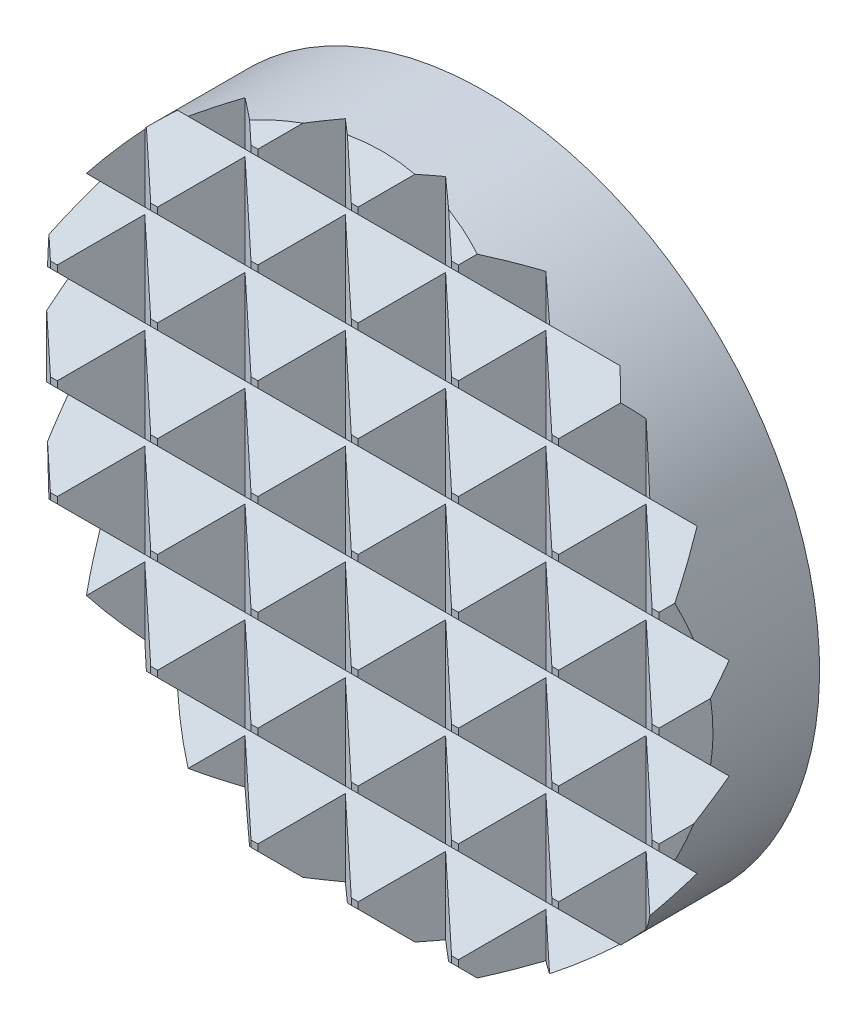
ISO-10303-21;
HEADER;
FILE_DESCRIPTION(('STEP AP214'),'2;1');
FILE_NAME('part.step','',(''),(''),'','','');
FILE_SCHEMA(('AUTOMOTIVE_DESIGN { 1 0 10303 214 1 1 1 1 }'));
ENDSEC;
DATA;
#1=APPLICATION_CONTEXT('core data for automotive mechanical design processes');
#2=APPLICATION_PROTOCOL_DEFINITION('international standard','automotive_design',2000,#1);
#3=PRODUCT_CONTEXT('',#1,'mechanical');
#4=PRODUCT('Part','Part','',(#3));
#5=PRODUCT_RELATED_PRODUCT_CATEGORY('part','',(#4));
#6=PRODUCT_DEFINITION_FORMATION('','',#4);
#7=PRODUCT_DEFINITION_CONTEXT('part definition',#1,'design');
#8=PRODUCT_DEFINITION('design','',#6,#7);
#9=PRODUCT_DEFINITION_SHAPE('','',#8);
#10=(LENGTH_UNIT() NAMED_UNIT(*) SI_UNIT(.MILLI.,.METRE.));
#11=(NAMED_UNIT(*) PLANE_ANGLE_UNIT() SI_UNIT($,.RADIAN.));
#12=(NAMED_UNIT(*) SI_UNIT($,.STERADIAN.) SOLID_ANGLE_UNIT());
#13=UNCERTAINTY_MEASURE_WITH_UNIT(LENGTH_MEASURE(1.E-05),#10,'distance_accuracy_value','');
#14=(GEOMETRIC_REPRESENTATION_CONTEXT(3) GLOBAL_UNCERTAINTY_ASSIGNED_CONTEXT((#13)) GLOBAL_UNIT_ASSIGNED_CONTEXT((#10,
#11,#12)) REPRESENTATION_CONTEXT('',''));
#15=CARTESIAN_POINT('',(0.,0.,0.));
#16=DIRECTION('',(0.,0.,1.));
#17=DIRECTION('',(1.,0.,0.));
#18=AXIS2_PLACEMENT_3D('',#15,#16,#17);
#19=CARTESIAN_POINT('',(7.938525,0.0761999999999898,3.679825));
#20=DIRECTION('',(0.,0.,-1.));
#21=DIRECTION('',(-1.,0.,0.));
#22=AXIS2_PLACEMENT_3D('',#19,#20,#21);
#23=PLANE('',#22);
#24=DIRECTION('',(-1.,0.,0.));
#25=VECTOR('',#24,1.);
#26=CARTESIAN_POINT('',(7.938525,-0.0761999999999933,3.679825));
#27=LINE('',#26,#25);
#28=CARTESIAN_POINT('',(7.29615,-0.0761999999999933,3.679825));
#29=VERTEX_POINT('',#28);
#30=CARTESIAN_POINT('',(7.13332948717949,-0.0761999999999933,3.679825));
#31=VERTEX_POINT('',#30);
#32=EDGE_CURVE('E1028',#29,#31,#27,.T.);
#33=ORIENTED_EDGE('',*,*,#32,.F.);
#34=DIRECTION('',(0.,1.,0.));
#35=VECTOR('',#34,1.);
#36=CARTESIAN_POINT('',(7.29615,0.0761999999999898,3.679825));
#37=LINE('',#36,#35);
#38=CARTESIAN_POINT('',(7.29615,0.0761999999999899,3.679825));
#39=VERTEX_POINT('',#38);
#40=EDGE_CURVE('E2058',#29,#39,#37,.T.);
#41=ORIENTED_EDGE('',*,*,#40,.T.);
#42=DIRECTION('',(-1.,0.,0.));
#43=VECTOR('',#42,1.);
#44=CARTESIAN_POINT('',(7.938525,0.0761999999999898,3.679825));
#45=LINE('',#44,#43);
#46=CARTESIAN_POINT('',(7.13332948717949,0.0761999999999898,3.679825));
#47=VERTEX_POINT('',#46);
#48=EDGE_CURVE('E1032',#39,#47,#45,.T.);
#49=ORIENTED_EDGE('',*,*,#48,.T.);
#50=DIRECTION('',(0.,-1.,0.));
#51=VECTOR('',#50,1.);
#52=CARTESIAN_POINT('',(7.13332948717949,0.0761999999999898,3.679825));
#53=LINE('',#52,#51);
#54=EDGE_CURVE('E1996',#47,#31,#53,.T.);
#55=ORIENTED_EDGE('',*,*,#54,.T.);
#56=EDGE_LOOP('',(#33,#41,#49,#55));
#57=FACE_BOUND('',#56,.T.);
#58=ADVANCED_FACE('F14',(#57),#23,.F.);
#59=CARTESIAN_POINT('',(7.938525,-2.30505,3.679825));
#60=DIRECTION('',(0.,0.,-1.));
#61=DIRECTION('',(-1.,0.,0.));
#62=AXIS2_PLACEMENT_3D('',#59,#60,#61);
#63=PLANE('',#62);
#64=DIRECTION('',(-1.,0.,0.));
#65=VECTOR('',#64,1.);
#66=CARTESIAN_POINT('',(7.938525,-2.45745,3.679825));
#67=LINE('',#66,#65);
#68=CARTESIAN_POINT('',(7.29615,-2.45745,3.679825));
#69=VERTEX_POINT('',#68);
#70=CARTESIAN_POINT('',(7.13332948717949,-2.45745,3.679825));
#71=VERTEX_POINT('',#70);
#72=EDGE_CURVE('E1008',#69,#71,#67,.T.);
#73=ORIENTED_EDGE('',*,*,#72,.F.);
#74=DIRECTION('',(0.,1.,0.));
#75=VECTOR('',#74,1.);
#76=CARTESIAN_POINT('',(7.29615,-2.30505,3.679825));
#77=LINE('',#76,#75);
#78=CARTESIAN_POINT('',(7.29615,-2.30505,3.679825));
#79=VERTEX_POINT('',#78);
#80=EDGE_CURVE('E2051',#69,#79,#77,.T.);
#81=ORIENTED_EDGE('',*,*,#80,.T.);
#82=DIRECTION('',(-1.,0.,0.));
#83=VECTOR('',#82,1.);
#84=CARTESIAN_POINT('',(7.938525,-2.30505,3.679825));
#85=LINE('',#84,#83);
#86=CARTESIAN_POINT('',(7.13332948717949,-2.30505,3.679825));
#87=VERTEX_POINT('',#86);
#88=EDGE_CURVE('E1012',#79,#87,#85,.T.);
#89=ORIENTED_EDGE('',*,*,#88,.T.);
#90=DIRECTION('',(0.,-1.,0.));
#91=VECTOR('',#90,1.);
#92=CARTESIAN_POINT('',(7.13332948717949,-2.30505,3.679825));
#93=LINE('',#92,#91);
#94=EDGE_CURVE('E2005',#87,#71,#93,.T.);
#95=ORIENTED_EDGE('',*,*,#94,.T.);
#96=EDGE_LOOP('',(#73,#81,#89,#95));
#97=FACE_BOUND('',#96,.T.);
#98=ADVANCED_FACE('F1781',(#97),#63,.F.);
#99=CARTESIAN_POINT('',(7.938525,2.45745,3.679825));
#100=DIRECTION('',(0.,0.,-1.));
#101=DIRECTION('',(-1.,0.,0.));
#102=AXIS2_PLACEMENT_3D('',#99,#100,#101);
#103=PLANE('',#102);
#104=DIRECTION('',(-1.,0.,0.));
#105=VECTOR('',#104,1.);
#106=CARTESIAN_POINT('',(7.938525,2.30505,3.679825));
#107=LINE('',#106,#105);
#108=CARTESIAN_POINT('',(7.29615,2.30505,3.679825));
#109=VERTEX_POINT('',#108);
#110=CARTESIAN_POINT('',(7.13332948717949,2.30505,3.679825));
#111=VERTEX_POINT('',#110);
#112=EDGE_CURVE('E876',#109,#111,#107,.T.);
#113=ORIENTED_EDGE('',*,*,#112,.F.);
#114=DIRECTION('',(0.,1.,0.));
#115=VECTOR('',#114,1.);
#116=CARTESIAN_POINT('',(7.29615,2.45745,3.679825));
#117=LINE('',#116,#115);
#118=CARTESIAN_POINT('',(7.29615,2.45745,3.679825));
#119=VERTEX_POINT('',#118);
#120=EDGE_CURVE('E864',#109,#119,#117,.T.);
#121=ORIENTED_EDGE('',*,*,#120,.T.);
#122=DIRECTION('',(-1.,0.,0.));
#123=VECTOR('',#122,1.);
#124=CARTESIAN_POINT('',(7.938525,2.45745,3.679825));
#125=LINE('',#124,#123);
#126=CARTESIAN_POINT('',(7.13332948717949,2.45745,3.679825));
#127=VERTEX_POINT('',#126);
#128=EDGE_CURVE('E863',#119,#127,#125,.T.);
#129=ORIENTED_EDGE('',*,*,#128,.T.);
#130=DIRECTION('',(0.,-1.,0.));
#131=VECTOR('',#130,1.);
#132=CARTESIAN_POINT('',(7.13332948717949,2.45745,3.679825));
#133=LINE('',#132,#131);
#134=EDGE_CURVE('E1986',#127,#111,#133,.T.);
#135=ORIENTED_EDGE('',*,*,#134,.T.);
#136=EDGE_LOOP('',(#113,#121,#129,#135));
#137=FACE_BOUND('',#136,.T.);
#138=ADVANCED_FACE('F1767',(#137),#103,.F.);
#139=CARTESIAN_POINT('',(4.9149,-0.0761999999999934,3.679825));
#140=VERTEX_POINT('',#139);
#141=CARTESIAN_POINT('',(4.75207948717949,-0.0761999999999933,3.679825));
#142=VERTEX_POINT('',#141);
#143=EDGE_CURVE('E1031',#140,#142,#27,.T.);
#144=ORIENTED_EDGE('',*,*,#143,.F.);
#145=DIRECTION('',(0.,1.,0.));
#146=VECTOR('',#145,1.);
#147=CARTESIAN_POINT('',(4.9149,0.0761999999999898,3.679825));
#148=LINE('',#147,#146);
#149=CARTESIAN_POINT('',(4.9149,0.0761999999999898,3.679825));
#150=VERTEX_POINT('',#149);
#151=EDGE_CURVE('E1891',#140,#150,#148,.T.);
#152=ORIENTED_EDGE('',*,*,#151,.T.);
#153=CARTESIAN_POINT('',(4.75207948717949,0.0761999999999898,3.679825));
#154=VERTEX_POINT('',#153);
#155=EDGE_CURVE('E1034',#150,#154,#45,.T.);
#156=ORIENTED_EDGE('',*,*,#155,.T.);
#157=DIRECTION('',(0.,-1.,0.));
#158=VECTOR('',#157,1.);
#159=CARTESIAN_POINT('',(4.75207948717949,0.0761999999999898,3.679825));
#160=LINE('',#159,#158);
#161=EDGE_CURVE('E1565',#154,#142,#160,.T.);
#162=ORIENTED_EDGE('',*,*,#161,.T.);
#163=EDGE_LOOP('',(#144,#152,#156,#162));
#164=FACE_BOUND('',#163,.T.);
#165=ADVANCED_FACE('F1780',(#164),#23,.F.);
#166=CARTESIAN_POINT('',(4.9149,-2.45745,3.679825));
#167=VERTEX_POINT('',#166);
#168=CARTESIAN_POINT('',(4.75207948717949,-2.45745,3.679825));
#169=VERTEX_POINT('',#168);
#170=EDGE_CURVE('E1011',#167,#169,#67,.T.);
#171=ORIENTED_EDGE('',*,*,#170,.F.);
#172=DIRECTION('',(0.,1.,0.));
#173=VECTOR('',#172,1.);
#174=CARTESIAN_POINT('',(4.9149,-2.30505,3.679825));
#175=LINE('',#174,#173);
#176=CARTESIAN_POINT('',(4.9149,-2.30505,3.679825));
#177=VERTEX_POINT('',#176);
#178=EDGE_CURVE('E2036',#167,#177,#175,.T.);
#179=ORIENTED_EDGE('',*,*,#178,.T.);
#180=CARTESIAN_POINT('',(4.75207948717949,-2.30505,3.679825));
#181=VERTEX_POINT('',#180);
#182=EDGE_CURVE('E1014',#177,#181,#85,.T.);
#183=ORIENTED_EDGE('',*,*,#182,.T.);
#184=DIRECTION('',(0.,-1.,0.));
#185=VECTOR('',#184,1.);
#186=CARTESIAN_POINT('',(4.75207948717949,-2.30505,3.679825));
#187=LINE('',#186,#185);
#188=EDGE_CURVE('E1553',#181,#169,#187,.T.);
#189=ORIENTED_EDGE('',*,*,#188,.T.);
#190=EDGE_LOOP('',(#171,#179,#183,#189));
#191=FACE_BOUND('',#190,.T.);
#192=ADVANCED_FACE('F1796',(#191),#63,.F.);
#193=CARTESIAN_POINT('',(7.938525,4.8387,3.679825));
#194=DIRECTION('',(0.,0.,-1.));
#195=DIRECTION('',(-1.,0.,0.));
#196=AXIS2_PLACEMENT_3D('',#193,#194,#195);
#197=PLANE('',#196);
#198=DIRECTION('',(-1.,0.,0.));
#199=VECTOR('',#198,1.);
#200=CARTESIAN_POINT('',(7.938525,4.6863,3.679825));
#201=LINE('',#200,#199);
#202=CARTESIAN_POINT('',(4.9149,4.6863,3.679825));
#203=VERTEX_POINT('',#202);
#204=CARTESIAN_POINT('',(4.75207948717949,4.6863,3.679825));
#205=VERTEX_POINT('',#204);
#206=EDGE_CURVE('E894',#203,#205,#201,.T.);
#207=ORIENTED_EDGE('',*,*,#206,.F.);
#208=DIRECTION('',(0.,1.,0.));
#209=VECTOR('',#208,1.);
#210=CARTESIAN_POINT('',(4.9149,4.8387,3.679825));
#211=LINE('',#210,#209);
#212=CARTESIAN_POINT('',(4.9149,4.8387,3.679825));
#213=VERTEX_POINT('',#212);
#214=EDGE_CURVE('E2015',#203,#213,#211,.T.);
#215=ORIENTED_EDGE('',*,*,#214,.T.);
#216=DIRECTION('',(-1.,0.,0.));
#217=VECTOR('',#216,1.);
#218=CARTESIAN_POINT('',(7.938525,4.8387,3.679825));
#219=LINE('',#218,#217);
#220=CARTESIAN_POINT('',(4.75207948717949,4.8387,3.679825));
#221=VERTEX_POINT('',#220);
#222=EDGE_CURVE('E889',#213,#221,#219,.T.);
#223=ORIENTED_EDGE('',*,*,#222,.T.);
#224=DIRECTION('',(0.,-1.,0.));
#225=VECTOR('',#224,1.);
#226=CARTESIAN_POINT('',(4.75207948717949,4.8387,3.679825));
#227=LINE('',#226,#225);
#228=EDGE_CURVE('E1583',#221,#205,#227,.T.);
#229=ORIENTED_EDGE('',*,*,#228,.T.);
#230=EDGE_LOOP('',(#207,#215,#223,#229));
#231=FACE_BOUND('',#230,.T.);
#232=ADVANCED_FACE('F2298',(#231),#197,.F.);
#233=CARTESIAN_POINT('',(7.938525,-4.6863,3.679825));
#234=DIRECTION('',(0.,0.,-1.));
#235=DIRECTION('',(-1.,0.,0.));
#236=AXIS2_PLACEMENT_3D('',#233,#234,#235);
#237=PLANE('',#236);
#238=DIRECTION('',(-1.,0.,0.));
#239=VECTOR('',#238,1.);
#240=CARTESIAN_POINT('',(7.938525,-4.8387,3.679825));
#241=LINE('',#240,#239);
#242=CARTESIAN_POINT('',(4.9149,-4.8387,3.679825));
#243=VERTEX_POINT('',#242);
#244=CARTESIAN_POINT('',(4.75207948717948,-4.8387,3.679825));
#245=VERTEX_POINT('',#244);
#246=EDGE_CURVE('E1003',#243,#245,#241,.T.);
#247=ORIENTED_EDGE('',*,*,#246,.F.);
#248=DIRECTION('',(0.,1.,0.));
#249=VECTOR('',#248,1.);
#250=CARTESIAN_POINT('',(4.9149,-4.6863,3.679825));
#251=LINE('',#250,#249);
#252=CARTESIAN_POINT('',(4.9149,-4.6863,3.679825));
#253=VERTEX_POINT('',#252);
#254=EDGE_CURVE('E1538',#243,#253,#251,.T.);
#255=ORIENTED_EDGE('',*,*,#254,.T.);
#256=DIRECTION('',(-1.,0.,0.));
#257=VECTOR('',#256,1.);
#258=CARTESIAN_POINT('',(7.938525,-4.6863,3.679825));
#259=LINE('',#258,#257);
#260=CARTESIAN_POINT('',(4.75207948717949,-4.6863,3.679825));
#261=VERTEX_POINT('',#260);
#262=EDGE_CURVE('E995',#253,#261,#259,.T.);
#263=ORIENTED_EDGE('',*,*,#262,.T.);
#264=DIRECTION('',(0.,-1.,0.));
#265=VECTOR('',#264,1.);
#266=CARTESIAN_POINT('',(4.75207948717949,-4.6863,3.679825));
#267=LINE('',#266,#265);
#268=EDGE_CURVE('E1537',#261,#245,#267,.T.);
#269=ORIENTED_EDGE('',*,*,#268,.T.);
#270=EDGE_LOOP('',(#247,#255,#263,#269));
#271=FACE_BOUND('',#270,.T.);
#272=ADVANCED_FACE('F1536',(#271),#237,.F.);
#273=CARTESIAN_POINT('',(4.9149,2.30505,3.679825));
#274=VERTEX_POINT('',#273);
#275=CARTESIAN_POINT('',(4.75207948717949,2.30505,3.679825));
#276=VERTEX_POINT('',#275);
#277=EDGE_CURVE('E1047',#274,#276,#107,.T.);
#278=ORIENTED_EDGE('',*,*,#277,.F.);
#279=DIRECTION('',(0.,1.,0.));
#280=VECTOR('',#279,1.);
#281=CARTESIAN_POINT('',(4.9149,2.45745,3.679825));
#282=LINE('',#281,#280);
#283=CARTESIAN_POINT('',(4.9149,2.45745,3.679825));
#284=VERTEX_POINT('',#283);
#285=EDGE_CURVE('E2021',#274,#284,#282,.T.);
#286=ORIENTED_EDGE('',*,*,#285,.T.);
#287=CARTESIAN_POINT('',(4.75207948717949,2.45745,3.679825));
#288=VERTEX_POINT('',#287);
#289=EDGE_CURVE('E1048',#284,#288,#125,.T.);
#290=ORIENTED_EDGE('',*,*,#289,.T.);
#291=DIRECTION('',(0.,-1.,0.));
#292=VECTOR('',#291,1.);
#293=CARTESIAN_POINT('',(4.75207948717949,2.45745,3.679825));
#294=LINE('',#293,#292);
#295=EDGE_CURVE('E1574',#288,#276,#294,.T.);
#296=ORIENTED_EDGE('',*,*,#295,.T.);
#297=EDGE_LOOP('',(#278,#286,#290,#296));
#298=FACE_BOUND('',#297,.T.);
#299=ADVANCED_FACE('F1782',(#298),#103,.F.);
#300=CARTESIAN_POINT('',(2.53365,-0.0761999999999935,3.679825));
#301=VERTEX_POINT('',#300);
#302=CARTESIAN_POINT('',(2.37082948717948,-0.0761999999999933,3.679825));
#303=VERTEX_POINT('',#302);
#304=EDGE_CURVE('E1858',#301,#303,#27,.T.);
#305=ORIENTED_EDGE('',*,*,#304,.F.);
#306=DIRECTION('',(0.,1.,0.));
#307=VECTOR('',#306,1.);
#308=CARTESIAN_POINT('',(2.53365,0.0761999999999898,3.679825));
#309=LINE('',#308,#307);
#310=CARTESIAN_POINT('',(2.53365,0.0761999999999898,3.679825));
#311=VERTEX_POINT('',#310);
#312=EDGE_CURVE('E1621',#301,#311,#309,.T.);
#313=ORIENTED_EDGE('',*,*,#312,.T.);
#314=CARTESIAN_POINT('',(2.37082948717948,0.0761999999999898,3.679825));
#315=VERTEX_POINT('',#314);
#316=EDGE_CURVE('E1884',#311,#315,#45,.T.);
#317=ORIENTED_EDGE('',*,*,#316,.T.);
#318=DIRECTION('',(0.,-1.,0.));
#319=VECTOR('',#318,1.);
#320=CARTESIAN_POINT('',(2.37082948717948,0.0761999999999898,3.679825));
#321=LINE('',#320,#319);
#322=EDGE_CURVE('E1740',#315,#303,#321,.T.);
#323=ORIENTED_EDGE('',*,*,#322,.T.);
#324=EDGE_LOOP('',(#305,#313,#317,#323));
#325=FACE_BOUND('',#324,.T.);
#326=ADVANCED_FACE('F1803',(#325),#23,.F.);
#327=CARTESIAN_POINT('',(2.53365,-2.45745,3.679825));
#328=VERTEX_POINT('',#327);
#329=CARTESIAN_POINT('',(2.37082948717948,-2.45745,3.679825));
#330=VERTEX_POINT('',#329);
#331=EDGE_CURVE('E3314',#328,#330,#67,.T.);
#332=ORIENTED_EDGE('',*,*,#331,.F.);
#333=DIRECTION('',(0.,1.,0.));
#334=VECTOR('',#333,1.);
#335=CARTESIAN_POINT('',(2.53365,-2.30505,3.679825));
#336=LINE('',#335,#334);
#337=CARTESIAN_POINT('',(2.53365,-2.30505,3.679825));
#338=VERTEX_POINT('',#337);
#339=EDGE_CURVE('E1612',#328,#338,#336,.T.);
#340=ORIENTED_EDGE('',*,*,#339,.T.);
#341=CARTESIAN_POINT('',(2.37082948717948,-2.30505,3.679825));
#342=VERTEX_POINT('',#341);
#343=EDGE_CURVE('E3291',#338,#342,#85,.T.);
#344=ORIENTED_EDGE('',*,*,#343,.T.);
#345=DIRECTION('',(0.,-1.,0.));
#346=VECTOR('',#345,1.);
#347=CARTESIAN_POINT('',(2.37082948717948,-2.30505,3.679825));
#348=LINE('',#347,#346);
#349=EDGE_CURVE('E1731',#342,#330,#348,.T.);
#350=ORIENTED_EDGE('',*,*,#349,.T.);
#351=EDGE_LOOP('',(#332,#340,#344,#350));
#352=FACE_BOUND('',#351,.T.);
#353=ADVANCED_FACE('F1846',(#352),#63,.F.);
#354=CARTESIAN_POINT('',(2.53365,4.6863,3.679825));
#355=VERTEX_POINT('',#354);
#356=CARTESIAN_POINT('',(2.37082948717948,4.6863,3.679825));
#357=VERTEX_POINT('',#356);
#358=EDGE_CURVE('E897',#355,#357,#201,.T.);
#359=ORIENTED_EDGE('',*,*,#358,.F.);
#360=DIRECTION('',(0.,1.,0.));
#361=VECTOR('',#360,1.);
#362=CARTESIAN_POINT('',(2.53365,4.8387,3.679825));
#363=LINE('',#362,#361);
#364=CARTESIAN_POINT('',(2.53365,4.8387,3.679825));
#365=VERTEX_POINT('',#364);
#366=EDGE_CURVE('E1636',#355,#365,#363,.T.);
#367=ORIENTED_EDGE('',*,*,#366,.T.);
#368=CARTESIAN_POINT('',(2.37082948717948,4.8387,3.679825));
#369=VERTEX_POINT('',#368);
#370=EDGE_CURVE('E892',#365,#369,#219,.T.);
#371=ORIENTED_EDGE('',*,*,#370,.T.);
#372=DIRECTION('',(0.,-1.,0.));
#373=VECTOR('',#372,1.);
#374=CARTESIAN_POINT('',(2.37082948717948,4.8387,3.679825));
#375=LINE('',#374,#373);
#376=EDGE_CURVE('E1101',#369,#357,#375,.T.);
#377=ORIENTED_EDGE('',*,*,#376,.T.);
#378=EDGE_LOOP('',(#359,#367,#371,#377));
#379=FACE_BOUND('',#378,.T.);
#380=ADVANCED_FACE('F1854',(#379),#197,.F.);
#381=CARTESIAN_POINT('',(2.53365,-4.8387,3.679825));
#382=VERTEX_POINT('',#381);
#383=CARTESIAN_POINT('',(2.37082948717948,-4.8387,3.679825));
#384=VERTEX_POINT('',#383);
#385=EDGE_CURVE('E1493',#382,#384,#241,.T.);
#386=ORIENTED_EDGE('',*,*,#385,.F.);
#387=DIRECTION('',(0.,1.,0.));
#388=VECTOR('',#387,1.);
#389=CARTESIAN_POINT('',(2.53365,-4.6863,3.679825));
#390=LINE('',#389,#388);
#391=CARTESIAN_POINT('',(2.53365,-4.6863,3.679825));
#392=VERTEX_POINT('',#391);
#393=EDGE_CURVE('E1605',#382,#392,#390,.T.);
#394=ORIENTED_EDGE('',*,*,#393,.T.);
#395=CARTESIAN_POINT('',(2.37082948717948,-4.6863,3.679825));
#396=VERTEX_POINT('',#395);
#397=EDGE_CURVE('E1524',#392,#396,#259,.T.);
#398=ORIENTED_EDGE('',*,*,#397,.T.);
#399=DIRECTION('',(0.,-1.,0.));
#400=VECTOR('',#399,1.);
#401=CARTESIAN_POINT('',(2.37082948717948,-4.6863,3.679825));
#402=LINE('',#401,#400);
#403=EDGE_CURVE('E1722',#396,#384,#402,.T.);
#404=ORIENTED_EDGE('',*,*,#403,.T.);
#405=EDGE_LOOP('',(#386,#394,#398,#404));
#406=FACE_BOUND('',#405,.T.);
#407=ADVANCED_FACE('F1922',(#406),#237,.F.);
#408=CARTESIAN_POINT('',(7.9385,7.21995,3.679825));
#409=DIRECTION('',(0.,0.,-1.));
#410=DIRECTION('',(-1.,0.,0.));
#411=AXIS2_PLACEMENT_3D('',#408,#409,#410);
#412=PLANE('',#411);
#413=DIRECTION('',(-1.,0.,0.));
#414=VECTOR('',#413,1.);
#415=CARTESIAN_POINT('',(7.9385,7.06755,3.679825));
#416=LINE('',#415,#414);
#417=CARTESIAN_POINT('',(2.53365,7.06755,3.679825));
#418=VERTEX_POINT('',#417);
#419=CARTESIAN_POINT('',(2.37082948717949,7.06755,3.679825));
#420=VERTEX_POINT('',#419);
#421=EDGE_CURVE('E910',#418,#420,#416,.T.);
#422=ORIENTED_EDGE('',*,*,#421,.F.);
#423=DIRECTION('',(0.,1.,0.));
#424=VECTOR('',#423,1.);
#425=CARTESIAN_POINT('',(2.53365,7.21995,3.679825));
#426=LINE('',#425,#424);
#427=CARTESIAN_POINT('',(2.53365,7.21995,3.679825));
#428=VERTEX_POINT('',#427);
#429=EDGE_CURVE('E1645',#418,#428,#426,.T.);
#430=ORIENTED_EDGE('',*,*,#429,.T.);
#431=DIRECTION('',(-1.,0.,0.));
#432=VECTOR('',#431,1.);
#433=CARTESIAN_POINT('',(7.9385,7.21995,3.679825));
#434=LINE('',#433,#432);
#435=CARTESIAN_POINT('',(2.37082948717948,7.21995,3.679825));
#436=VERTEX_POINT('',#435);
#437=EDGE_CURVE('E905',#428,#436,#434,.T.);
#438=ORIENTED_EDGE('',*,*,#437,.T.);
#439=DIRECTION('',(0.,-1.,0.));
#440=VECTOR('',#439,1.);
#441=CARTESIAN_POINT('',(2.37082948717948,7.21995,3.679825));
#442=LINE('',#441,#440);
#443=EDGE_CURVE('E1113',#436,#420,#442,.T.);
#444=ORIENTED_EDGE('',*,*,#443,.T.);
#445=EDGE_LOOP('',(#422,#430,#438,#444));
#446=FACE_BOUND('',#445,.T.);
#447=ADVANCED_FACE('F2167',(#446),#412,.F.);
#448=CARTESIAN_POINT('',(7.9385,8.334375,2.5654));
#449=DIRECTION('',(0.,-0.707106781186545,-0.70710678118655));
#450=DIRECTION('',(0.,0.70710678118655,-0.707106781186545));
#451=AXIS2_PLACEMENT_3D('',#448,#449,#450);
#452=PLANE('',#451);
#453=CARTESIAN_POINT('',(0.1524,7.21995,3.679825));
#454=VERTEX_POINT('',#453);
#455=CARTESIAN_POINT('',(-0.0104205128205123,7.21995,3.679825));
#456=VERTEX_POINT('',#455);
#457=EDGE_CURVE('E908',#454,#456,#434,.T.);
#458=ORIENTED_EDGE('',*,*,#457,.F.);
#459=DIRECTION('',(0.577350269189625,0.577350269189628,-0.577350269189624));
#460=VECTOR('',#459,1.);
#461=CARTESIAN_POINT('',(3.49071666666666,10.5582666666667,0.341508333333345));
#462=LINE('',#461,#460);
#463=CARTESIAN_POINT('',(0.82677397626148,7.89432397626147,3.00545102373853));
#464=VERTEX_POINT('',#463);
#465=EDGE_CURVE('E1708',#454,#464,#462,.T.);
#466=ORIENTED_EDGE('',*,*,#465,.T.);
#467=CARTESIAN_POINT('',(0.,0.,10.899775));
#468=DIRECTION('',(0.,-0.707106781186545,-0.70710678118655));
#469=DIRECTION('',(0.,-0.70710678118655,0.707106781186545));
#470=AXIS2_PLACEMENT_3D('',#467,#468,#469);
#471=ELLIPSE('',#470,11.2253201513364,7.9375);
#472=CARTESIAN_POINT('',(-0.782180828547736,7.89886696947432,3.00090803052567));
#473=VERTEX_POINT('',#472);
#474=EDGE_CURVE('E903',#473,#464,#471,.T.);
#475=ORIENTED_EDGE('',*,*,#474,.F.);
#476=DIRECTION('',(0.626501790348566,-0.55113315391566,0.551133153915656));
#477=VECTOR('',#476,1.);
#478=CARTESIAN_POINT('',(2.33997601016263,5.15230794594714,5.74746705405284));
#479=LINE('',#478,#477);
#480=EDGE_CURVE('E1241',#473,#456,#479,.T.);
#481=ORIENTED_EDGE('',*,*,#480,.T.);
#482=EDGE_LOOP('',(#458,#466,#475,#481));
#483=FACE_BOUND('',#482,.T.);
#484=ADVANCED_FACE('F2138',(#483),#452,.F.);
#485=CARTESIAN_POINT('',(8.334375,-8.334375,2.5654));
#486=DIRECTION('',(0.,0.707106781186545,-0.70710678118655));
#487=DIRECTION('',(0.,0.70710678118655,0.707106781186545));
#488=AXIS2_PLACEMENT_3D('',#485,#486,#487);
#489=PLANE('',#488);
#490=CARTESIAN_POINT('',(0.,0.,10.899775));
#491=DIRECTION('',(0.,0.707106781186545,-0.70710678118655));
#492=DIRECTION('',(0.,0.70710678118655,0.707106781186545));
#493=AXIS2_PLACEMENT_3D('',#490,#491,#492);
#494=ELLIPSE('',#493,11.2253201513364,7.9375);
#495=CARTESIAN_POINT('',(2.75700697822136,-7.44330697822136,3.45646802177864));
#496=VERTEX_POINT('',#495);
#497=CARTESIAN_POINT('',(1.78671804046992,-7.73379240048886,3.16598259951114));
#498=VERTEX_POINT('',#497);
#499=EDGE_CURVE('E1486',#496,#498,#494,.T.);
#500=ORIENTED_EDGE('',*,*,#499,.F.);
#501=DIRECTION('',(-0.577350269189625,0.577350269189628,0.577350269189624));
#502=VECTOR('',#501,1.);
#503=CARTESIAN_POINT('',(5.210175,-9.896475,1.0033));
#504=LINE('',#503,#502);
#505=CARTESIAN_POINT('',(2.53365,-7.21995,3.679825));
#506=VERTEX_POINT('',#505);
#507=EDGE_CURVE('E1596',#496,#506,#504,.T.);
#508=ORIENTED_EDGE('',*,*,#507,.T.);
#509=DIRECTION('',(-1.,0.,0.));
#510=VECTOR('',#509,1.);
#511=CARTESIAN_POINT('',(8.334375,-7.21995,3.679825));
#512=LINE('',#511,#510);
#513=CARTESIAN_POINT('',(2.37082948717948,-7.21995,3.679825));
#514=VERTEX_POINT('',#513);
#515=EDGE_CURVE('E1476',#506,#514,#512,.T.);
#516=ORIENTED_EDGE('',*,*,#515,.T.);
#517=DIRECTION('',(-0.626501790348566,-0.55113315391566,-0.551133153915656));
#518=VECTOR('',#517,1.);
#519=CARTESIAN_POINT('',(3.94195740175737,-5.837829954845,5.06194504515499));
#520=LINE('',#519,#518);
#521=EDGE_CURVE('E1714',#514,#498,#520,.T.);
#522=ORIENTED_EDGE('',*,*,#521,.T.);
#523=EDGE_LOOP('',(#500,#508,#516,#522));
#524=FACE_BOUND('',#523,.T.);
#525=ADVANCED_FACE('F2232',(#524),#489,.F.);
#526=CARTESIAN_POINT('',(8.334375,-7.06755,3.679825));
#527=DIRECTION('',(0.,0.,-1.));
#528=DIRECTION('',(-1.,0.,0.));
#529=AXIS2_PLACEMENT_3D('',#526,#527,#528);
#530=PLANE('',#529);
#531=ORIENTED_EDGE('',*,*,#515,.F.);
#532=DIRECTION('',(0.,1.,0.));
#533=VECTOR('',#532,1.);
#534=CARTESIAN_POINT('',(2.53365,-7.06755,3.679825));
#535=LINE('',#534,#533);
#536=CARTESIAN_POINT('',(2.53365,-7.06755,3.679825));
#537=VERTEX_POINT('',#536);
#538=EDGE_CURVE('E1593',#506,#537,#535,.T.);
#539=ORIENTED_EDGE('',*,*,#538,.T.);
#540=DIRECTION('',(-1.,0.,0.));
#541=VECTOR('',#540,1.);
#542=CARTESIAN_POINT('',(8.334375,-7.06755,3.679825));
#543=LINE('',#542,#541);
#544=CARTESIAN_POINT('',(2.37082948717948,-7.06755,3.679825));
#545=VERTEX_POINT('',#544);
#546=EDGE_CURVE('E1481',#537,#545,#543,.T.);
#547=ORIENTED_EDGE('',*,*,#546,.T.);
#548=DIRECTION('',(0.,-1.,0.));
#549=VECTOR('',#548,1.);
#550=CARTESIAN_POINT('',(2.37082948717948,-7.06755,3.679825));
#551=LINE('',#550,#549);
#552=EDGE_CURVE('E1711',#545,#514,#551,.T.);
#553=ORIENTED_EDGE('',*,*,#552,.T.);
#554=EDGE_LOOP('',(#531,#539,#547,#553));
#555=FACE_BOUND('',#554,.T.);
#556=ADVANCED_FACE('F2235',(#555),#530,.F.);
#557=CARTESIAN_POINT('',(2.53365,2.30505,3.679825));
#558=VERTEX_POINT('',#557);
#559=CARTESIAN_POINT('',(2.37082948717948,2.30505,3.679825));
#560=VERTEX_POINT('',#559);
#561=EDGE_CURVE('E1748',#558,#560,#107,.T.);
#562=ORIENTED_EDGE('',*,*,#561,.F.);
#563=DIRECTION('',(0.,1.,0.));
#564=VECTOR('',#563,1.);
#565=CARTESIAN_POINT('',(2.53365,2.45745,3.679825));
#566=LINE('',#565,#564);
#567=CARTESIAN_POINT('',(2.53365,2.45745,3.679825));
#568=VERTEX_POINT('',#567);
#569=EDGE_CURVE('E1084',#558,#568,#566,.T.);
#570=ORIENTED_EDGE('',*,*,#569,.T.);
#571=CARTESIAN_POINT('',(2.37082948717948,2.45745,3.679825));
#572=VERTEX_POINT('',#571);
#573=EDGE_CURVE('E1052',#568,#572,#125,.T.);
#574=ORIENTED_EDGE('',*,*,#573,.T.);
#575=DIRECTION('',(0.,-1.,0.));
#576=VECTOR('',#575,1.);
#577=CARTESIAN_POINT('',(2.37082948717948,2.45745,3.679825));
#578=LINE('',#577,#576);
#579=EDGE_CURVE('E1083',#572,#560,#578,.T.);
#580=ORIENTED_EDGE('',*,*,#579,.T.);
#581=EDGE_LOOP('',(#562,#570,#574,#580));
#582=FACE_BOUND('',#581,.T.);
#583=ADVANCED_FACE('F1082',(#582),#103,.F.);
#584=CARTESIAN_POINT('',(-2.22885,2.30505,3.679825));
#585=VERTEX_POINT('',#584);
#586=CARTESIAN_POINT('',(-2.39167051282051,2.30505,3.679825));
#587=VERTEX_POINT('',#586);
#588=EDGE_CURVE('E1750',#585,#587,#107,.T.);
#589=ORIENTED_EDGE('',*,*,#588,.F.);
#590=DIRECTION('',(0.,1.,0.));
#591=VECTOR('',#590,1.);
#592=CARTESIAN_POINT('',(-2.22885,2.45745,3.679825));
#593=LINE('',#592,#591);
#594=CARTESIAN_POINT('',(-2.22885,2.45745,3.679825));
#595=VERTEX_POINT('',#594);
#596=EDGE_CURVE('E1164',#585,#595,#593,.T.);
#597=ORIENTED_EDGE('',*,*,#596,.T.);
#598=CARTESIAN_POINT('',(-2.39167051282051,2.45745,3.679825));
#599=VERTEX_POINT('',#598);
#600=EDGE_CURVE('E1059',#595,#599,#125,.T.);
#601=ORIENTED_EDGE('',*,*,#600,.T.);
#602=DIRECTION('',(0.,-1.,0.));
#603=VECTOR('',#602,1.);
#604=CARTESIAN_POINT('',(-2.39167051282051,2.45745,3.679825));
#605=LINE('',#604,#603);
#606=EDGE_CURVE('E1295',#599,#587,#605,.T.);
#607=ORIENTED_EDGE('',*,*,#606,.T.);
#608=EDGE_LOOP('',(#589,#597,#601,#607));
#609=FACE_BOUND('',#608,.T.);
#610=ADVANCED_FACE('F1836',(#609),#103,.F.);
#611=CARTESIAN_POINT('',(0.1524,-0.0761999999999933,3.679825));
#612=VERTEX_POINT('',#611);
#613=CARTESIAN_POINT('',(-0.0104205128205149,-0.0761999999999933,3.679825));
#614=VERTEX_POINT('',#613);
#615=EDGE_CURVE('E1863',#612,#614,#27,.T.);
#616=ORIENTED_EDGE('',*,*,#615,.F.);
#617=DIRECTION('',(0.,1.,0.));
#618=VECTOR('',#617,1.);
#619=CARTESIAN_POINT('',(0.1524,0.0761999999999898,3.679825));
#620=LINE('',#619,#618);
#621=CARTESIAN_POINT('',(0.1524,0.0761999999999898,3.679825));
#622=VERTEX_POINT('',#621);
#623=EDGE_CURVE('E1681',#612,#622,#620,.T.);
#624=ORIENTED_EDGE('',*,*,#623,.T.);
#625=CARTESIAN_POINT('',(-0.010420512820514,0.0761999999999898,3.679825));
#626=VERTEX_POINT('',#625);
#627=EDGE_CURVE('E1881',#622,#626,#45,.T.);
#628=ORIENTED_EDGE('',*,*,#627,.T.);
#629=DIRECTION('',(0.,-1.,0.));
#630=VECTOR('',#629,1.);
#631=CARTESIAN_POINT('',(-0.010420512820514,0.0761999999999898,3.679825));
#632=LINE('',#631,#630);
#633=EDGE_CURVE('E1218',#626,#614,#632,.T.);
#634=ORIENTED_EDGE('',*,*,#633,.T.);
#635=EDGE_LOOP('',(#616,#624,#628,#634));
#636=FACE_BOUND('',#635,.T.);
#637=ADVANCED_FACE('F1827',(#636),#23,.F.);
#638=CARTESIAN_POINT('',(0.1524,-2.45745,3.679825));
#639=VERTEX_POINT('',#638);
#640=CARTESIAN_POINT('',(-0.0104205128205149,-2.45745,3.679825));
#641=VERTEX_POINT('',#640);
#642=EDGE_CURVE('E3311',#639,#641,#67,.T.);
#643=ORIENTED_EDGE('',*,*,#642,.F.);
#644=DIRECTION('',(0.,1.,0.));
#645=VECTOR('',#644,1.);
#646=CARTESIAN_POINT('',(0.1524,-2.30505,3.679825));
#647=LINE('',#646,#645);
#648=CARTESIAN_POINT('',(0.1524,-2.30505,3.679825));
#649=VERTEX_POINT('',#648);
#650=EDGE_CURVE('E1672',#639,#649,#647,.T.);
#651=ORIENTED_EDGE('',*,*,#650,.T.);
#652=CARTESIAN_POINT('',(-0.010420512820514,-2.30505,3.679825));
#653=VERTEX_POINT('',#652);
#654=EDGE_CURVE('E3292',#649,#653,#85,.T.);
#655=ORIENTED_EDGE('',*,*,#654,.T.);
#656=DIRECTION('',(0.,-1.,0.));
#657=VECTOR('',#656,1.);
#658=CARTESIAN_POINT('',(-0.010420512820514,-2.30505,3.679825));
#659=LINE('',#658,#657);
#660=EDGE_CURVE('E1209',#653,#641,#659,.T.);
#661=ORIENTED_EDGE('',*,*,#660,.T.);
#662=EDGE_LOOP('',(#643,#651,#655,#661));
#663=FACE_BOUND('',#662,.T.);
#664=ADVANCED_FACE('F1834',(#663),#63,.F.);
#665=CARTESIAN_POINT('',(0.1524,4.6863,3.679825));
#666=VERTEX_POINT('',#665);
#667=CARTESIAN_POINT('',(-0.0104205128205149,4.6863,3.679825));
#668=VERTEX_POINT('',#667);
#669=EDGE_CURVE('E2287',#666,#668,#201,.T.);
#670=ORIENTED_EDGE('',*,*,#669,.F.);
#671=DIRECTION('',(0.,1.,0.));
#672=VECTOR('',#671,1.);
#673=CARTESIAN_POINT('',(0.1524,4.8387,3.679825));
#674=LINE('',#673,#672);
#675=CARTESIAN_POINT('',(0.1524,4.8387,3.679825));
#676=VERTEX_POINT('',#675);
#677=EDGE_CURVE('E1696',#666,#676,#674,.T.);
#678=ORIENTED_EDGE('',*,*,#677,.T.);
#679=CARTESIAN_POINT('',(-0.010420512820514,4.8387,3.679825));
#680=VERTEX_POINT('',#679);
#681=EDGE_CURVE('E1951',#676,#680,#219,.T.);
#682=ORIENTED_EDGE('',*,*,#681,.T.);
#683=DIRECTION('',(0.,-1.,0.));
#684=VECTOR('',#683,1.);
#685=CARTESIAN_POINT('',(-0.010420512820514,4.8387,3.679825));
#686=LINE('',#685,#684);
#687=EDGE_CURVE('E1235',#680,#668,#686,.T.);
#688=ORIENTED_EDGE('',*,*,#687,.T.);
#689=EDGE_LOOP('',(#670,#678,#682,#688));
#690=FACE_BOUND('',#689,.T.);
#691=ADVANCED_FACE('F1844',(#690),#197,.F.);
#692=CARTESIAN_POINT('',(0.1524,-4.8387,3.679825));
#693=VERTEX_POINT('',#692);
#694=CARTESIAN_POINT('',(-0.0104205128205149,-4.8387,3.679825));
#695=VERTEX_POINT('',#694);
#696=EDGE_CURVE('E1498',#693,#695,#241,.T.);
#697=ORIENTED_EDGE('',*,*,#696,.F.);
#698=DIRECTION('',(0.,1.,0.));
#699=VECTOR('',#698,1.);
#700=CARTESIAN_POINT('',(0.1524,-4.6863,3.679825));
#701=LINE('',#700,#699);
#702=CARTESIAN_POINT('',(0.1524,-4.6863,3.679825));
#703=VERTEX_POINT('',#702);
#704=EDGE_CURVE('E1522',#693,#703,#701,.T.);
#705=ORIENTED_EDGE('',*,*,#704,.T.);
#706=CARTESIAN_POINT('',(-0.010420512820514,-4.6863,3.679825));
#707=VERTEX_POINT('',#706);
#708=EDGE_CURVE('E1521',#703,#707,#259,.T.);
#709=ORIENTED_EDGE('',*,*,#708,.T.);
#710=DIRECTION('',(0.,-1.,0.));
#711=VECTOR('',#710,1.);
#712=CARTESIAN_POINT('',(-0.010420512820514,-4.6863,3.679825));
#713=LINE('',#712,#711);
#714=EDGE_CURVE('E1200',#707,#695,#713,.T.);
#715=ORIENTED_EDGE('',*,*,#714,.T.);
#716=EDGE_LOOP('',(#697,#705,#709,#715));
#717=FACE_BOUND('',#716,.T.);
#718=ADVANCED_FACE('F1519',(#717),#237,.F.);
#719=CARTESIAN_POINT('',(0.152400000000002,7.06755,3.679825));
#720=VERTEX_POINT('',#719);
#721=CARTESIAN_POINT('',(-0.0104205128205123,7.06755,3.679825));
#722=VERTEX_POINT('',#721);
#723=EDGE_CURVE('E912',#720,#722,#416,.T.);
#724=ORIENTED_EDGE('',*,*,#723,.F.);
#725=DIRECTION('',(0.,1.,0.));
#726=VECTOR('',#725,1.);
#727=CARTESIAN_POINT('',(0.1524,7.21995,3.679825));
#728=LINE('',#727,#726);
#729=EDGE_CURVE('E1705',#720,#454,#728,.T.);
#730=ORIENTED_EDGE('',*,*,#729,.T.);
#731=ORIENTED_EDGE('',*,*,#457,.T.);
#732=DIRECTION('',(0.,-1.,0.));
#733=VECTOR('',#732,1.);
#734=CARTESIAN_POINT('',(-0.0104205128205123,7.21995,3.679825));
#735=LINE('',#734,#733);
#736=EDGE_CURVE('E1244',#456,#722,#735,.T.);
#737=ORIENTED_EDGE('',*,*,#736,.T.);
#738=EDGE_LOOP('',(#724,#730,#731,#737));
#739=FACE_BOUND('',#738,.T.);
#740=ADVANCED_FACE('F2142',(#739),#412,.F.);
#741=ORIENTED_EDGE('',*,*,#437,.F.);
#742=DIRECTION('',(0.577350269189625,0.577350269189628,-0.577350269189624));
#743=VECTOR('',#742,1.);
#744=CARTESIAN_POINT('',(5.07821666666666,9.76451666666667,1.13525833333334));
#745=LINE('',#744,#743);
#746=CARTESIAN_POINT('',(2.75700697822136,7.44330697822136,3.45646802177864));
#747=VERTEX_POINT('',#746);
#748=EDGE_CURVE('E1648',#428,#747,#745,.T.);
#749=ORIENTED_EDGE('',*,*,#748,.T.);
#750=CARTESIAN_POINT('',(1.78671804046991,7.73379240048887,3.16598259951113));
#751=VERTEX_POINT('',#750);
#752=EDGE_CURVE('E904',#751,#747,#471,.T.);
#753=ORIENTED_EDGE('',*,*,#752,.F.);
#754=DIRECTION('',(0.626501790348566,-0.55113315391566,0.551133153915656));
#755=VECTOR('',#754,1.);
#756=CARTESIAN_POINT('',(3.78657468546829,5.9745200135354,4.92525498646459));
#757=LINE('',#756,#755);
#758=EDGE_CURVE('E1116',#751,#436,#757,.T.);
#759=ORIENTED_EDGE('',*,*,#758,.T.);
#760=EDGE_LOOP('',(#741,#749,#753,#759));
#761=FACE_BOUND('',#760,.T.);
#762=ADVANCED_FACE('F2129',(#761),#452,.F.);
#763=CARTESIAN_POINT('',(0.826773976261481,-7.89432397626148,3.00545102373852));
#764=VERTEX_POINT('',#763);
#765=CARTESIAN_POINT('',(-0.78218082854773,-7.89886696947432,3.00090803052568));
#766=VERTEX_POINT('',#765);
#767=EDGE_CURVE('E1488',#764,#766,#494,.T.);
#768=ORIENTED_EDGE('',*,*,#767,.F.);
#769=DIRECTION('',(-0.577350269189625,0.577350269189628,0.577350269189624));
#770=VECTOR('',#769,1.);
#771=CARTESIAN_POINT('',(3.622675,-10.690225,0.20955));
#772=LINE('',#771,#770);
#773=CARTESIAN_POINT('',(0.1524,-7.21995,3.679825));
#774=VERTEX_POINT('',#773);
#775=EDGE_CURVE('E1659',#764,#774,#772,.T.);
#776=ORIENTED_EDGE('',*,*,#775,.T.);
#777=CARTESIAN_POINT('',(-0.010420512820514,-7.21995,3.679825));
#778=VERTEX_POINT('',#777);
#779=EDGE_CURVE('E1479',#774,#778,#512,.T.);
#780=ORIENTED_EDGE('',*,*,#779,.T.);
#781=DIRECTION('',(-0.626501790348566,-0.55113315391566,-0.551133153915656));
#782=VECTOR('',#781,1.);
#783=CARTESIAN_POINT('',(2.49535872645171,-5.01561788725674,5.88415711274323));
#784=LINE('',#783,#782);
#785=EDGE_CURVE('E1190',#778,#766,#784,.T.);
#786=ORIENTED_EDGE('',*,*,#785,.T.);
#787=EDGE_LOOP('',(#768,#776,#780,#786));
#788=FACE_BOUND('',#787,.T.);
#789=ADVANCED_FACE('F2423',(#788),#489,.F.);
#790=ORIENTED_EDGE('',*,*,#779,.F.);
#791=DIRECTION('',(0.,1.,0.));
#792=VECTOR('',#791,1.);
#793=CARTESIAN_POINT('',(0.1524,-7.06755,3.679825));
#794=LINE('',#793,#792);
#795=CARTESIAN_POINT('',(0.152400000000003,-7.06755,3.679825));
#796=VERTEX_POINT('',#795);
#797=EDGE_CURVE('E1656',#774,#796,#794,.T.);
#798=ORIENTED_EDGE('',*,*,#797,.T.);
#799=CARTESIAN_POINT('',(-0.010420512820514,-7.06755,3.679825));
#800=VERTEX_POINT('',#799);
#801=EDGE_CURVE('E1484',#796,#800,#543,.T.);
#802=ORIENTED_EDGE('',*,*,#801,.T.);
#803=DIRECTION('',(0.,-1.,0.));
#804=VECTOR('',#803,1.);
#805=CARTESIAN_POINT('',(-0.010420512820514,-7.06755,3.679825));
#806=LINE('',#805,#804);
#807=EDGE_CURVE('E950',#800,#778,#806,.T.);
#808=ORIENTED_EDGE('',*,*,#807,.T.);
#809=EDGE_LOOP('',(#790,#798,#802,#808));
#810=FACE_BOUND('',#809,.T.);
#811=ADVANCED_FACE('F1835',(#810),#530,.F.);
#812=CARTESIAN_POINT('',(0.1524,2.30505,3.679825));
#813=VERTEX_POINT('',#812);
#814=CARTESIAN_POINT('',(-0.0104205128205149,2.30505,3.679825));
#815=VERTEX_POINT('',#814);
#816=EDGE_CURVE('E1749',#813,#815,#107,.T.);
#817=ORIENTED_EDGE('',*,*,#816,.F.);
#818=DIRECTION('',(0.,1.,0.));
#819=VECTOR('',#818,1.);
#820=CARTESIAN_POINT('',(0.1524,2.45745,3.679825));
#821=LINE('',#820,#819);
#822=CARTESIAN_POINT('',(0.1524,2.45745,3.679825));
#823=VERTEX_POINT('',#822);
#824=EDGE_CURVE('E1690',#813,#823,#821,.T.);
#825=ORIENTED_EDGE('',*,*,#824,.T.);
#826=CARTESIAN_POINT('',(-0.010420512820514,2.45745,3.679825));
#827=VERTEX_POINT('',#826);
#828=EDGE_CURVE('E1065',#823,#827,#125,.T.);
#829=ORIENTED_EDGE('',*,*,#828,.T.);
#830=DIRECTION('',(0.,-1.,0.));
#831=VECTOR('',#830,1.);
#832=CARTESIAN_POINT('',(-0.010420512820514,2.45745,3.679825));
#833=LINE('',#832,#831);
#834=EDGE_CURVE('E1227',#827,#815,#833,.T.);
#835=ORIENTED_EDGE('',*,*,#834,.T.);
#836=EDGE_LOOP('',(#817,#825,#829,#835));
#837=FACE_BOUND('',#836,.T.);
#838=ADVANCED_FACE('F1786',(#837),#103,.F.);
#839=CARTESIAN_POINT('',(-2.22885,-0.0761999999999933,3.679825));
#840=VERTEX_POINT('',#839);
#841=CARTESIAN_POINT('',(-2.39167051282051,-0.0761999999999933,3.679825));
#842=VERTEX_POINT('',#841);
#843=EDGE_CURVE('E1864',#840,#842,#27,.T.);
#844=ORIENTED_EDGE('',*,*,#843,.F.);
#845=DIRECTION('',(0.,1.,0.));
#846=VECTOR('',#845,1.);
#847=CARTESIAN_POINT('',(-2.22885,0.0761999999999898,3.679825));
#848=LINE('',#847,#846);
#849=CARTESIAN_POINT('',(-2.22885,0.0761999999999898,3.679825));
#850=VERTEX_POINT('',#849);
#851=EDGE_CURVE('E1155',#840,#850,#848,.T.);
#852=ORIENTED_EDGE('',*,*,#851,.T.);
#853=CARTESIAN_POINT('',(-2.39167051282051,0.0761999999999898,3.679825));
#854=VERTEX_POINT('',#853);
#855=EDGE_CURVE('E1878',#850,#854,#45,.T.);
#856=ORIENTED_EDGE('',*,*,#855,.T.);
#857=DIRECTION('',(0.,-1.,0.));
#858=VECTOR('',#857,1.);
#859=CARTESIAN_POINT('',(-2.39167051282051,0.0761999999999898,3.679825));
#860=LINE('',#859,#858);
#861=EDGE_CURVE('E1286',#854,#842,#860,.T.);
#862=ORIENTED_EDGE('',*,*,#861,.T.);
#863=EDGE_LOOP('',(#844,#852,#856,#862));
#864=FACE_BOUND('',#863,.T.);
#865=ADVANCED_FACE('F1818',(#864),#23,.F.);
#866=CARTESIAN_POINT('',(-2.22885,-2.45745,3.679825));
#867=VERTEX_POINT('',#866);
#868=CARTESIAN_POINT('',(-2.39167051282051,-2.45745,3.679825));
#869=VERTEX_POINT('',#868);
#870=EDGE_CURVE('E3308',#867,#869,#67,.T.);
#871=ORIENTED_EDGE('',*,*,#870,.F.);
#872=DIRECTION('',(0.,1.,0.));
#873=VECTOR('',#872,1.);
#874=CARTESIAN_POINT('',(-2.22885,-2.30505,3.679825));
#875=LINE('',#874,#873);
#876=CARTESIAN_POINT('',(-2.22885,-2.30505,3.679825));
#877=VERTEX_POINT('',#876);
#878=EDGE_CURVE('E1146',#867,#877,#875,.T.);
#879=ORIENTED_EDGE('',*,*,#878,.T.);
#880=CARTESIAN_POINT('',(-2.39167051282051,-2.30505,3.679825));
#881=VERTEX_POINT('',#880);
#882=EDGE_CURVE('E3295',#877,#881,#85,.T.);
#883=ORIENTED_EDGE('',*,*,#882,.T.);
#884=DIRECTION('',(0.,-1.,0.));
#885=VECTOR('',#884,1.);
#886=CARTESIAN_POINT('',(-2.39167051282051,-2.30505,3.679825));
#887=LINE('',#886,#885);
#888=EDGE_CURVE('E1277',#881,#869,#887,.T.);
#889=ORIENTED_EDGE('',*,*,#888,.T.);
#890=EDGE_LOOP('',(#871,#879,#883,#889));
#891=FACE_BOUND('',#890,.T.);
#892=ADVANCED_FACE('F1823',(#891),#63,.F.);
#893=CARTESIAN_POINT('',(-2.22885,4.6863,3.679825));
#894=VERTEX_POINT('',#893);
#895=CARTESIAN_POINT('',(-2.39167051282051,4.6863,3.679825));
#896=VERTEX_POINT('',#895);
#897=EDGE_CURVE('E2286',#894,#896,#201,.T.);
#898=ORIENTED_EDGE('',*,*,#897,.F.);
#899=DIRECTION('',(0.,1.,0.));
#900=VECTOR('',#899,1.);
#901=CARTESIAN_POINT('',(-2.22885,4.8387,3.679825));
#902=LINE('',#901,#900);
#903=CARTESIAN_POINT('',(-2.22885,4.8387,3.679825));
#904=VERTEX_POINT('',#903);
#905=EDGE_CURVE('E1172',#894,#904,#902,.T.);
#906=ORIENTED_EDGE('',*,*,#905,.T.);
#907=CARTESIAN_POINT('',(-2.39167051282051,4.8387,3.679825));
#908=VERTEX_POINT('',#907);
#909=EDGE_CURVE('E1954',#904,#908,#219,.T.);
#910=ORIENTED_EDGE('',*,*,#909,.T.);
#911=DIRECTION('',(0.,-1.,0.));
#912=VECTOR('',#911,1.);
#913=CARTESIAN_POINT('',(-2.39167051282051,4.8387,3.679825));
#914=LINE('',#913,#912);
#915=EDGE_CURVE('E1303',#908,#896,#914,.T.);
#916=ORIENTED_EDGE('',*,*,#915,.T.);
#917=EDGE_LOOP('',(#898,#906,#910,#916));
#918=FACE_BOUND('',#917,.T.);
#919=ADVANCED_FACE('F1832',(#918),#197,.F.);
#920=CARTESIAN_POINT('',(-2.22885,-4.8387,3.679825));
#921=VERTEX_POINT('',#920);
#922=CARTESIAN_POINT('',(-2.39167051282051,-4.8387,3.679825));
#923=VERTEX_POINT('',#922);
#924=EDGE_CURVE('E1499',#921,#923,#241,.T.);
#925=ORIENTED_EDGE('',*,*,#924,.F.);
#926=DIRECTION('',(0.,1.,0.));
#927=VECTOR('',#926,1.);
#928=CARTESIAN_POINT('',(-2.22885,-4.6863,3.679825));
#929=LINE('',#928,#927);
#930=CARTESIAN_POINT('',(-2.22885,-4.6863,3.679825));
#931=VERTEX_POINT('',#930);
#932=EDGE_CURVE('E1137',#921,#931,#929,.T.);
#933=ORIENTED_EDGE('',*,*,#932,.T.);
#934=CARTESIAN_POINT('',(-2.39167051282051,-4.6863,3.679825));
#935=VERTEX_POINT('',#934);
#936=EDGE_CURVE('E1525',#931,#935,#259,.T.);
#937=ORIENTED_EDGE('',*,*,#936,.T.);
#938=DIRECTION('',(0.,-1.,0.));
#939=VECTOR('',#938,1.);
#940=CARTESIAN_POINT('',(-2.39167051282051,-4.6863,3.679825));
#941=LINE('',#940,#939);
#942=EDGE_CURVE('E1268',#935,#923,#941,.T.);
#943=ORIENTED_EDGE('',*,*,#942,.T.);
#944=EDGE_LOOP('',(#925,#933,#937,#943));
#945=FACE_BOUND('',#944,.T.);
#946=ADVANCED_FACE('F1785',(#945),#237,.F.);
#947=CARTESIAN_POINT('',(-4.6101,2.30505,3.679825));
#948=VERTEX_POINT('',#947);
#949=CARTESIAN_POINT('',(-4.77292051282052,2.30505,3.679825));
#950=VERTEX_POINT('',#949);
#951=EDGE_CURVE('E1752',#948,#950,#107,.T.);
#952=ORIENTED_EDGE('',*,*,#951,.F.);
#953=DIRECTION('',(0.,1.,0.));
#954=VECTOR('',#953,1.);
#955=CARTESIAN_POINT('',(-4.6101,2.45745,3.679825));
#956=LINE('',#955,#954);
#957=CARTESIAN_POINT('',(-4.6101,2.45745,3.679825));
#958=VERTEX_POINT('',#957);
#959=EDGE_CURVE('E1351',#948,#958,#956,.T.);
#960=ORIENTED_EDGE('',*,*,#959,.T.);
#961=CARTESIAN_POINT('',(-4.77292051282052,2.45745,3.679825));
#962=VERTEX_POINT('',#961);
#963=EDGE_CURVE('E1053',#958,#962,#125,.T.);
#964=ORIENTED_EDGE('',*,*,#963,.T.);
#965=DIRECTION('',(0.,-1.,0.));
#966=VECTOR('',#965,1.);
#967=CARTESIAN_POINT('',(-4.77292051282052,2.45745,3.679825));
#968=LINE('',#967,#966);
#969=EDGE_CURVE('E1403',#962,#950,#968,.T.);
#970=ORIENTED_EDGE('',*,*,#969,.T.);
#971=EDGE_LOOP('',(#952,#960,#964,#970));
#972=FACE_BOUND('',#971,.T.);
#973=ADVANCED_FACE('F1768',(#972),#103,.F.);
#974=CARTESIAN_POINT('',(-4.6101,-0.0761999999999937,3.679825));
#975=VERTEX_POINT('',#974);
#976=CARTESIAN_POINT('',(-4.77292051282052,-0.0761999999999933,3.679825));
#977=VERTEX_POINT('',#976);
#978=EDGE_CURVE('E1866',#975,#977,#27,.T.);
#979=ORIENTED_EDGE('',*,*,#978,.F.);
#980=DIRECTION('',(0.,1.,0.));
#981=VECTOR('',#980,1.);
#982=CARTESIAN_POINT('',(-4.6101,0.0761999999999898,3.679825));
#983=LINE('',#982,#981);
#984=CARTESIAN_POINT('',(-4.6101,0.0761999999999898,3.679825));
#985=VERTEX_POINT('',#984);
#986=EDGE_CURVE('E1342',#975,#985,#983,.T.);
#987=ORIENTED_EDGE('',*,*,#986,.T.);
#988=CARTESIAN_POINT('',(-4.77292051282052,0.0761999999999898,3.679825));
#989=VERTEX_POINT('',#988);
#990=EDGE_CURVE('E1877',#985,#989,#45,.T.);
#991=ORIENTED_EDGE('',*,*,#990,.T.);
#992=DIRECTION('',(0.,-1.,0.));
#993=VECTOR('',#992,1.);
#994=CARTESIAN_POINT('',(-4.77292051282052,0.0761999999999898,3.679825));
#995=LINE('',#994,#993);
#996=EDGE_CURVE('E1394',#989,#977,#995,.T.);
#997=ORIENTED_EDGE('',*,*,#996,.T.);
#998=EDGE_LOOP('',(#979,#987,#991,#997));
#999=FACE_BOUND('',#998,.T.);
#1000=ADVANCED_FACE('F1784',(#999),#23,.F.);
#1001=CARTESIAN_POINT('',(-4.6101,-2.45745,3.679825));
#1002=VERTEX_POINT('',#1001);
#1003=CARTESIAN_POINT('',(-4.77292051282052,-2.45745,3.679825));
#1004=VERTEX_POINT('',#1003);
#1005=EDGE_CURVE('E3307',#1002,#1004,#67,.T.);
#1006=ORIENTED_EDGE('',*,*,#1005,.F.);
#1007=DIRECTION('',(0.,1.,0.));
#1008=VECTOR('',#1007,1.);
#1009=CARTESIAN_POINT('',(-4.6101,-2.30505,3.679825));
#1010=LINE('',#1009,#1008);
#1011=CARTESIAN_POINT('',(-4.6101,-2.30505,3.679825));
#1012=VERTEX_POINT('',#1011);
#1013=EDGE_CURVE('E1333',#1002,#1012,#1010,.T.);
#1014=ORIENTED_EDGE('',*,*,#1013,.T.);
#1015=CARTESIAN_POINT('',(-4.77292051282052,-2.30505,3.679825));
#1016=VERTEX_POINT('',#1015);
#1017=EDGE_CURVE('E3298',#1012,#1016,#85,.T.);
#1018=ORIENTED_EDGE('',*,*,#1017,.T.);
#1019=DIRECTION('',(0.,-1.,0.));
#1020=VECTOR('',#1019,1.);
#1021=CARTESIAN_POINT('',(-4.77292051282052,-2.30505,3.679825));
#1022=LINE('',#1021,#1020);
#1023=EDGE_CURVE('E1385',#1016,#1004,#1022,.T.);
#1024=ORIENTED_EDGE('',*,*,#1023,.T.);
#1025=EDGE_LOOP('',(#1006,#1014,#1018,#1024));
#1026=FACE_BOUND('',#1025,.T.);
#1027=ADVANCED_FACE('F1816',(#1026),#63,.F.);
#1028=CARTESIAN_POINT('',(0.,0.,0.));
#1029=DIRECTION('',(0.,0.,1.));
#1030=DIRECTION('',(1.,0.,0.));
#1031=AXIS2_PLACEMENT_3D('',#1028,#1029,#1030);
#1032=CYLINDRICAL_SURFACE('',#1031,7.9375);
#1033=CARTESIAN_POINT('',(0.,0.,10.975975));
#1034=DIRECTION('',(-0.707106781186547,0.,-0.707106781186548));
#1035=DIRECTION('',(-0.707106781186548,0.,0.707106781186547));
#1036=AXIS2_PLACEMENT_3D('',#1033,#1034,#1035);
#1037=ELLIPSE('',#1036,11.2253201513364,7.9375);
#1038=CARTESIAN_POINT('',(7.48380443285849,-2.64510443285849,3.49217056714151));
#1039=VERTEX_POINT('',#1038);
#1040=CARTESIAN_POINT('',(7.70855336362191,-1.89264663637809,3.26742163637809));
#1041=VERTEX_POINT('',#1040);
#1042=EDGE_CURVE('E9',#1039,#1041,#1037,.F.);
#1043=ORIENTED_EDGE('',*,*,#1042,.F.);
#1044=CARTESIAN_POINT('',(0.,0.,6.137275));
#1045=DIRECTION('',(0.,0.707106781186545,-0.70710678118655));
#1046=DIRECTION('',(0.,0.70710678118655,0.707106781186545));
#1047=AXIS2_PLACEMENT_3D('',#1044,#1045,#1046);
#1048=ELLIPSE('',#1047,11.2253201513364,7.9375);
#1049=CARTESIAN_POINT('',(7.08841415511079,-3.571875,2.5654));
#1050=VERTEX_POINT('',#1049);
#1051=EDGE_CURVE('E984',#1039,#1050,#1048,.T.);
#1052=ORIENTED_EDGE('',*,*,#1051,.T.);
#1053=CARTESIAN_POINT('',(0.,0.,-1.006475));
#1054=DIRECTION('',(0.,-0.707106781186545,-0.70710678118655));
#1055=DIRECTION('',(0.,-0.70710678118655,0.707106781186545));
#1056=AXIS2_PLACEMENT_3D('',#1053,#1054,#1055);
#1057=ELLIPSE('',#1056,11.2253201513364,7.9375);
#1058=CARTESIAN_POINT('',(6.67994236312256,-4.2874556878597,3.2809806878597));
#1059=VERTEX_POINT('',#1058);
#1060=EDGE_CURVE('E975',#1050,#1059,#1057,.T.);
#1061=ORIENTED_EDGE('',*,*,#1060,.T.);
#1062=CARTESIAN_POINT('',(0.,0.,-2.59535958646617));
#1063=DIRECTION('',(0.660500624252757,0.,-0.750825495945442));
#1064=DIRECTION('',(0.750825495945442,0.,0.660500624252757));
#1065=AXIS2_PLACEMENT_3D('',#1062,#1063,#1064);
#1066=ELLIPSE('',#1065,10.5716974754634,7.9375);
#1067=CARTESIAN_POINT('',(5.953125,-5.2501627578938,2.6416));
#1068=VERTEX_POINT('',#1067);
#1069=EDGE_CURVE('E982',#1068,#1059,#1066,.F.);
#1070=ORIENTED_EDGE('',*,*,#1069,.F.);
#1071=CARTESIAN_POINT('',(0.,0.,8.594725));
#1072=DIRECTION('',(-0.707106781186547,0.,-0.707106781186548));
#1073=DIRECTION('',(-0.707106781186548,0.,0.707106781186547));
#1074=AXIS2_PLACEMENT_3D('',#1071,#1072,#1073);
#1075=ELLIPSE('',#1074,11.2253201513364,7.9375);
#1076=CARTESIAN_POINT('',(5.65063075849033,-5.57443075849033,2.94409424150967));
#1077=VERTEX_POINT('',#1076);
#1078=EDGE_CURVE('E2044',#1077,#1068,#1075,.F.);
#1079=ORIENTED_EDGE('',*,*,#1078,.F.);
#1080=CARTESIAN_POINT('',(0.,0.,8.518525));
#1081=DIRECTION('',(0.,0.707106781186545,-0.70710678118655));
#1082=DIRECTION('',(0.,0.70710678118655,0.707106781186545));
#1083=AXIS2_PLACEMENT_3D('',#1080,#1081,#1082);
#1084=ELLIPSE('',#1083,11.2253201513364,7.9375);
#1085=CARTESIAN_POINT('',(5.2501627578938,-5.953125,2.5654));
#1086=VERTEX_POINT('',#1085);
#1087=EDGE_CURVE('E986',#1077,#1086,#1084,.T.);
#1088=ORIENTED_EDGE('',*,*,#1087,.T.);
#1089=CARTESIAN_POINT('',(0.,0.,-3.387725));
#1090=DIRECTION('',(0.,-0.707106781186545,-0.70710678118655));
#1091=DIRECTION('',(0.,-0.70710678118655,0.707106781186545));
#1092=AXIS2_PLACEMENT_3D('',#1089,#1090,#1091);
#1093=ELLIPSE('',#1092,11.2253201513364,7.9375);
#1094=CARTESIAN_POINT('',(4.30132402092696,-6.67102075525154,3.28329575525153));
#1095=VERTEX_POINT('',#1094);
#1096=EDGE_CURVE('E1475',#1086,#1095,#1093,.T.);
#1097=ORIENTED_EDGE('',*,*,#1096,.T.);
#1098=CARTESIAN_POINT('',(0.,0.,-0.5005757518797));
#1099=DIRECTION('',(0.660500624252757,0.,-0.750825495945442));
#1100=DIRECTION('',(0.750825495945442,0.,0.660500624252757));
#1101=AXIS2_PLACEMENT_3D('',#1098,#1099,#1100);
#1102=ELLIPSE('',#1101,10.5716974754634,7.9375);
#1103=CARTESIAN_POINT('',(3.571875,-7.08841415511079,2.6416));
#1104=VERTEX_POINT('',#1103);
#1105=EDGE_CURVE('E1917',#1104,#1095,#1102,.F.);
#1106=ORIENTED_EDGE('',*,*,#1105,.F.);
#1107=CARTESIAN_POINT('',(0.,0.,6.213475));
#1108=DIRECTION('',(-0.707106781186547,0.,-0.707106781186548));
#1109=DIRECTION('',(-0.707106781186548,0.,0.707106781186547));
#1110=AXIS2_PLACEMENT_3D('',#1107,#1108,#1109);
#1111=ELLIPSE('',#1110,11.2253201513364,7.9375);
#1112=EDGE_CURVE('E1599',#496,#1104,#1111,.F.);
#1113=ORIENTED_EDGE('',*,*,#1112,.F.);
#1114=ORIENTED_EDGE('',*,*,#499,.T.);
#1115=CARTESIAN_POINT('',(0.,0.,1.59420808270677));
#1116=DIRECTION('',(0.660500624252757,0.,-0.750825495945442));
#1117=DIRECTION('',(0.750825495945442,0.,0.660500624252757));
#1118=AXIS2_PLACEMENT_3D('',#1115,#1116,#1117);
#1119=ELLIPSE('',#1118,10.5716974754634,7.9375);
#1120=CARTESIAN_POINT('',(1.190625,-7.84769509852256,2.6416));
#1121=VERTEX_POINT('',#1120);
#1122=EDGE_CURVE('E1717',#1121,#498,#1119,.F.);
#1123=ORIENTED_EDGE('',*,*,#1122,.F.);
#1124=CARTESIAN_POINT('',(0.,0.,3.832225));
#1125=DIRECTION('',(-0.707106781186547,0.,-0.707106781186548));
#1126=DIRECTION('',(-0.707106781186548,0.,0.707106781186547));
#1127=AXIS2_PLACEMENT_3D('',#1124,#1125,#1126);
#1128=ELLIPSE('',#1127,11.2253201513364,7.9375);
#1129=EDGE_CURVE('E1662',#764,#1121,#1128,.F.);
#1130=ORIENTED_EDGE('',*,*,#1129,.F.);
#1131=ORIENTED_EDGE('',*,*,#767,.T.);
#1132=CARTESIAN_POINT('',(0.,0.,3.68899191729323));
#1133=DIRECTION('',(0.660500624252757,0.,-0.750825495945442));
#1134=DIRECTION('',(0.750825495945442,0.,0.660500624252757));
#1135=AXIS2_PLACEMENT_3D('',#1132,#1133,#1134);
#1136=ELLIPSE('',#1135,10.5716974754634,7.9375);
#1137=CARTESIAN_POINT('',(-1.190625,-7.84769509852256,2.6416));
#1138=VERTEX_POINT('',#1137);
#1139=EDGE_CURVE('E1193',#1138,#766,#1136,.F.);
#1140=ORIENTED_EDGE('',*,*,#1139,.F.);
#1141=CARTESIAN_POINT('',(0.,0.,1.450975));
#1142=DIRECTION('',(-0.707106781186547,0.,-0.707106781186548));
#1143=DIRECTION('',(-0.707106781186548,0.,0.707106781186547));
#1144=AXIS2_PLACEMENT_3D('',#1141,#1142,#1143);
#1145=ELLIPSE('',#1144,11.2253201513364,7.9375);
#1146=CARTESIAN_POINT('',(-1.69421885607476,-7.75458114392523,3.14519385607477));
#1147=VERTEX_POINT('',#1146);
#1148=EDGE_CURVE('E1131',#1147,#1138,#1145,.F.);
#1149=ORIENTED_EDGE('',*,*,#1148,.F.);
#1150=CARTESIAN_POINT('',(-2.67821194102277,-7.47202027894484,3.42775472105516));
#1151=VERTEX_POINT('',#1150);
#1152=EDGE_CURVE('E1489',#1147,#1151,#494,.T.);
#1153=ORIENTED_EDGE('',*,*,#1152,.T.);
#1154=CARTESIAN_POINT('',(0.,0.,5.7837757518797));
#1155=DIRECTION('',(0.660500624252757,0.,-0.750825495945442));
#1156=DIRECTION('',(0.750825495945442,0.,0.660500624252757));
#1157=AXIS2_PLACEMENT_3D('',#1154,#1155,#1156);
#1158=ELLIPSE('',#1157,10.5716974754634,7.9375);
#1159=CARTESIAN_POINT('',(-3.571875,-7.08841415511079,2.6416));
#1160=VERTEX_POINT('',#1159);
#1161=EDGE_CURVE('E1261',#1160,#1151,#1158,.F.);
#1162=ORIENTED_EDGE('',*,*,#1161,.F.);
#1163=CARTESIAN_POINT('',(0.,0.,-0.930275));
#1164=DIRECTION('',(-0.707106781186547,0.,-0.707106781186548));
#1165=DIRECTION('',(-0.707106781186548,0.,0.707106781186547));
#1166=AXIS2_PLACEMENT_3D('',#1163,#1164,#1165);
#1167=ELLIPSE('',#1166,11.2253201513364,7.9375);
#1168=CARTESIAN_POINT('',(-4.2477873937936,-6.70523739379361,3.31751239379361));
#1169=VERTEX_POINT('',#1168);
#1170=EDGE_CURVE('E1318',#1169,#1160,#1167,.F.);
#1171=ORIENTED_EDGE('',*,*,#1170,.F.);
#1172=CARTESIAN_POINT('',(0.,0.,-3.387725));
#1173=DIRECTION('',(0.,0.707106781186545,0.70710678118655));
#1174=DIRECTION('',(0.,-0.70710678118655,0.707106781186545));
#1175=AXIS2_PLACEMENT_3D('',#1172,#1173,#1174);
#1176=ELLIPSE('',#1175,11.2253201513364,7.9375);
#1177=CARTESIAN_POINT('',(-5.25016275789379,-5.953125,2.5654));
#1178=VERTEX_POINT('',#1177);
#1179=EDGE_CURVE('E1478',#1178,#1169,#1176,.T.);
#1180=ORIENTED_EDGE('',*,*,#1179,.F.);
#1181=CARTESIAN_POINT('',(0.,0.,8.518525));
#1182=DIRECTION('',(0.,-0.707106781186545,0.70710678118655));
#1183=DIRECTION('',(0.,0.70710678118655,0.707106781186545));
#1184=AXIS2_PLACEMENT_3D('',#1181,#1182,#1183);
#1185=ELLIPSE('',#1184,11.2253201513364,7.9375);
#1186=CARTESIAN_POINT('',(-5.63137540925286,-5.59388212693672,2.92464287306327));
#1187=VERTEX_POINT('',#1186);
#1188=EDGE_CURVE('E992',#1187,#1178,#1185,.T.);
#1189=ORIENTED_EDGE('',*,*,#1188,.F.);
#1190=CARTESIAN_POINT('',(0.,0.,7.87855958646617));
#1191=DIRECTION('',(0.660500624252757,0.,-0.750825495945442));
#1192=DIRECTION('',(0.750825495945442,0.,0.660500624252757));
#1193=AXIS2_PLACEMENT_3D('',#1190,#1191,#1192);
#1194=ELLIPSE('',#1193,10.5716974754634,7.9375);
#1195=CARTESIAN_POINT('',(-5.953125,-5.2501627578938,2.6416));
#1196=VERTEX_POINT('',#1195);
#1197=EDGE_CURVE('E1376',#1196,#1187,#1194,.F.);
#1198=ORIENTED_EDGE('',*,*,#1197,.F.);
#1199=CARTESIAN_POINT('',(0.,0.,-3.311525));
#1200=DIRECTION('',(-0.707106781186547,0.,-0.707106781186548));
#1201=DIRECTION('',(-0.707106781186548,0.,0.707106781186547));
#1202=AXIS2_PLACEMENT_3D('',#1199,#1200,#1201);
#1203=ELLIPSE('',#1202,11.2253201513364,7.9375);
#1204=CARTESIAN_POINT('',(-6.64557872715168,-4.34052872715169,3.33405372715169));
#1205=VERTEX_POINT('',#1204);
#1206=EDGE_CURVE('E1417',#1205,#1196,#1203,.F.);
#1207=ORIENTED_EDGE('',*,*,#1206,.F.);
#1208=CARTESIAN_POINT('',(0.,0.,-1.006475));
#1209=DIRECTION('',(0.,0.707106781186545,0.70710678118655));
#1210=DIRECTION('',(0.,-0.70710678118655,0.707106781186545));
#1211=AXIS2_PLACEMENT_3D('',#1208,#1209,#1210);
#1212=ELLIPSE('',#1211,11.2253201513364,7.9375);
#1213=CARTESIAN_POINT('',(-7.08841415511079,-3.571875,2.5654));
#1214=VERTEX_POINT('',#1213);
#1215=EDGE_CURVE('E998',#1214,#1205,#1212,.T.);
#1216=ORIENTED_EDGE('',*,*,#1215,.F.);
#1217=CARTESIAN_POINT('',(0.,0.,6.137275));
#1218=DIRECTION('',(0.,-0.707106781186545,0.70710678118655));
#1219=DIRECTION('',(0.,0.70710678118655,0.707106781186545));
#1220=AXIS2_PLACEMENT_3D('',#1217,#1218,#1219);
#1221=ELLIPSE('',#1220,11.2253201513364,7.9375);
#1222=CARTESIAN_POINT('',(-7.45586850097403,-2.72285349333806,3.41442150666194));
#1223=VERTEX_POINT('',#1222);
#1224=EDGE_CURVE('E1010',#1223,#1214,#1221,.T.);
#1225=ORIENTED_EDGE('',*,*,#1224,.F.);
#1226=CARTESIAN_POINT('',(0.,0.,9.97334342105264));
#1227=DIRECTION('',(0.660500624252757,0.,-0.750825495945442));
#1228=DIRECTION('',(0.750825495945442,0.,0.660500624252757));
#1229=AXIS2_PLACEMENT_3D('',#1226,#1227,#1228);
#1230=ELLIPSE('',#1229,10.5716974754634,7.9375);
#1231=CARTESIAN_POINT('',(-7.73133584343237,-1.79731809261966,3.17209309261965));
#1232=VERTEX_POINT('',#1231);
#1233=EDGE_CURVE('E925',#1232,#1223,#1230,.F.);
#1234=ORIENTED_EDGE('',*,*,#1233,.F.);
#1235=CARTESIAN_POINT('',(0.,0.,1.374775));
#1236=DIRECTION('',(0.,0.707106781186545,0.70710678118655));
#1237=DIRECTION('',(0.,-0.70710678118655,0.707106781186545));
#1238=AXIS2_PLACEMENT_3D('',#1235,#1236,#1237);
#1239=ELLIPSE('',#1238,11.2253201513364,7.9375);
#1240=CARTESIAN_POINT('',(-7.84769509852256,-1.190625,2.5654));
#1241=VERTEX_POINT('',#1240);
#1242=EDGE_CURVE('E1007',#1241,#1232,#1239,.T.);
#1243=ORIENTED_EDGE('',*,*,#1242,.F.);
#1244=CARTESIAN_POINT('',(0.,0.,3.756025));
#1245=DIRECTION('',(0.,-0.707106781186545,0.70710678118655));
#1246=DIRECTION('',(0.,0.70710678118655,0.707106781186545));
#1247=AXIS2_PLACEMENT_3D('',#1244,#1245,#1246);
#1248=ELLIPSE('',#1247,11.2253201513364,7.9375);
#1249=CARTESIAN_POINT('',(-7.9033715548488,-0.735271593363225,3.02075340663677));
#1250=VERTEX_POINT('',#1249);
#1251=EDGE_CURVE('E1030',#1250,#1241,#1248,.T.);
#1252=ORIENTED_EDGE('',*,*,#1251,.F.);
#1253=CARTESIAN_POINT('',(-7.9033715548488,0.735271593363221,3.02075340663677));
#1254=VERTEX_POINT('',#1253);
#1255=EDGE_CURVE('E933',#1254,#1250,#1230,.F.);
#1256=ORIENTED_EDGE('',*,*,#1255,.F.);
#1257=CARTESIAN_POINT('',(0.,0.,3.756025));
#1258=DIRECTION('',(0.,0.707106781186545,0.70710678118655));
#1259=DIRECTION('',(0.,-0.70710678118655,0.707106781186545));
#1260=AXIS2_PLACEMENT_3D('',#1257,#1258,#1259);
#1261=ELLIPSE('',#1260,11.2253201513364,7.9375);
#1262=CARTESIAN_POINT('',(-7.84769509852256,1.190625,2.5654));
#1263=VERTEX_POINT('',#1262);
#1264=EDGE_CURVE('E1027',#1263,#1254,#1261,.T.);
#1265=ORIENTED_EDGE('',*,*,#1264,.F.);
#1266=CARTESIAN_POINT('',(0.,0.,1.374775));
#1267=DIRECTION('',(0.,-0.707106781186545,0.70710678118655));
#1268=DIRECTION('',(0.,0.70710678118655,0.707106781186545));
#1269=AXIS2_PLACEMENT_3D('',#1266,#1267,#1268);
#1270=ELLIPSE('',#1269,11.2253201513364,7.9375);
#1271=CARTESIAN_POINT('',(-7.73133584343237,1.79731809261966,3.17209309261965));
#1272=VERTEX_POINT('',#1271);
#1273=EDGE_CURVE('E872',#1272,#1263,#1270,.T.);
#1274=ORIENTED_EDGE('',*,*,#1273,.F.);
#1275=CARTESIAN_POINT('',(-7.45586850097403,2.72285349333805,3.41442150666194));
#1276=VERTEX_POINT('',#1275);
#1277=EDGE_CURVE('E934',#1276,#1272,#1230,.F.);
#1278=ORIENTED_EDGE('',*,*,#1277,.F.);
#1279=CARTESIAN_POINT('',(0.,0.,6.137275));
#1280=DIRECTION('',(0.,0.707106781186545,0.70710678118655));
#1281=DIRECTION('',(0.,-0.70710678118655,0.707106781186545));
#1282=AXIS2_PLACEMENT_3D('',#1279,#1280,#1281);
#1283=ELLIPSE('',#1282,11.2253201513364,7.9375);
#1284=CARTESIAN_POINT('',(-7.08841415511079,3.571875,2.5654));
#1285=VERTEX_POINT('',#1284);
#1286=EDGE_CURVE('E880',#1285,#1276,#1283,.T.);
#1287=ORIENTED_EDGE('',*,*,#1286,.F.);
#1288=CARTESIAN_POINT('',(0.,0.,-1.006475));
#1289=DIRECTION('',(0.,-0.707106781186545,0.70710678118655));
#1290=DIRECTION('',(0.,0.70710678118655,0.707106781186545));
#1291=AXIS2_PLACEMENT_3D('',#1288,#1289,#1290);
#1292=ELLIPSE('',#1291,11.2253201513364,7.9375);
#1293=CARTESIAN_POINT('',(-6.64557872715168,4.34052872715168,3.33405372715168));
#1294=VERTEX_POINT('',#1293);
#1295=EDGE_CURVE('E874',#1294,#1285,#1292,.T.);
#1296=ORIENTED_EDGE('',*,*,#1295,.F.);
#1297=CARTESIAN_POINT('',(-5.953125,5.2501627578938,2.6416));
#1298=VERTEX_POINT('',#1297);
#1299=EDGE_CURVE('E1420',#1298,#1294,#1203,.F.);
#1300=ORIENTED_EDGE('',*,*,#1299,.F.);
#1301=CARTESIAN_POINT('',(-5.63137540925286,5.59388212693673,2.92464287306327));
#1302=VERTEX_POINT('',#1301);
#1303=EDGE_CURVE('E1379',#1302,#1298,#1194,.F.);
#1304=ORIENTED_EDGE('',*,*,#1303,.F.);
#1305=CARTESIAN_POINT('',(0.,0.,8.518525));
#1306=DIRECTION('',(0.,0.707106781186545,0.70710678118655));
#1307=DIRECTION('',(0.,-0.70710678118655,0.707106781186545));
#1308=AXIS2_PLACEMENT_3D('',#1305,#1306,#1307);
#1309=ELLIPSE('',#1308,11.2253201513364,7.9375);
#1310=CARTESIAN_POINT('',(-5.2501627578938,5.953125,2.5654));
#1311=VERTEX_POINT('',#1310);
#1312=EDGE_CURVE('E885',#1311,#1302,#1309,.T.);
#1313=ORIENTED_EDGE('',*,*,#1312,.F.);
#1314=CARTESIAN_POINT('',(0.,0.,-3.387725));
#1315=DIRECTION('',(0.,-0.707106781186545,0.70710678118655));
#1316=DIRECTION('',(0.,0.70710678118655,0.707106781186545));
#1317=AXIS2_PLACEMENT_3D('',#1314,#1315,#1316);
#1318=ELLIPSE('',#1317,11.2253201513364,7.9375);
#1319=CARTESIAN_POINT('',(-4.2477873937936,6.70523739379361,3.31751239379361));
#1320=VERTEX_POINT('',#1319);
#1321=EDGE_CURVE('E887',#1320,#1311,#1318,.T.);
#1322=ORIENTED_EDGE('',*,*,#1321,.F.);
#1323=CARTESIAN_POINT('',(-3.571875,7.08841415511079,2.6416));
#1324=VERTEX_POINT('',#1323);
#1325=EDGE_CURVE('E1321',#1324,#1320,#1167,.F.);
#1326=ORIENTED_EDGE('',*,*,#1325,.F.);
#1327=CARTESIAN_POINT('',(-2.67821194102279,7.47202027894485,3.42775472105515));
#1328=VERTEX_POINT('',#1327);
#1329=EDGE_CURVE('E1265',#1328,#1324,#1158,.F.);
#1330=ORIENTED_EDGE('',*,*,#1329,.F.);
#1331=CARTESIAN_POINT('',(-1.69421885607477,7.75458114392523,3.14519385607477));
#1332=VERTEX_POINT('',#1331);
#1333=EDGE_CURVE('E899',#1328,#1332,#471,.T.);
#1334=ORIENTED_EDGE('',*,*,#1333,.T.);
#1335=CARTESIAN_POINT('',(-1.190625,7.84769509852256,2.6416));
#1336=VERTEX_POINT('',#1335);
#1337=EDGE_CURVE('E1134',#1336,#1332,#1145,.F.);
#1338=ORIENTED_EDGE('',*,*,#1337,.F.);
#1339=EDGE_CURVE('E1197',#473,#1336,#1136,.F.);
#1340=ORIENTED_EDGE('',*,*,#1339,.F.);
#1341=ORIENTED_EDGE('',*,*,#474,.T.);
#1342=CARTESIAN_POINT('',(1.190625,7.84769509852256,2.6416));
#1343=VERTEX_POINT('',#1342);
#1344=EDGE_CURVE('E1664',#1343,#464,#1128,.F.);
#1345=ORIENTED_EDGE('',*,*,#1344,.F.);
#1346=EDGE_CURVE('E1119',#751,#1343,#1119,.F.);
#1347=ORIENTED_EDGE('',*,*,#1346,.F.);
#1348=ORIENTED_EDGE('',*,*,#752,.T.);
#1349=CARTESIAN_POINT('',(3.571875,7.08841415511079,2.6416));
#1350=VERTEX_POINT('',#1349);
#1351=EDGE_CURVE('E1602',#1350,#747,#1111,.F.);
#1352=ORIENTED_EDGE('',*,*,#1351,.F.);
#1353=CARTESIAN_POINT('',(4.30132402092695,6.67102075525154,3.28329575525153));
#1354=VERTEX_POINT('',#1353);
#1355=EDGE_CURVE('E1592',#1354,#1350,#1102,.F.);
#1356=ORIENTED_EDGE('',*,*,#1355,.F.);
#1357=CARTESIAN_POINT('',(0.,0.,-3.387725));
#1358=DIRECTION('',(0.,0.707106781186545,-0.70710678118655));
#1359=DIRECTION('',(0.,0.70710678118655,0.707106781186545));
#1360=AXIS2_PLACEMENT_3D('',#1357,#1358,#1359);
#1361=ELLIPSE('',#1360,11.2253201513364,7.9375);
#1362=CARTESIAN_POINT('',(5.2501627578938,5.953125,2.5654));
#1363=VERTEX_POINT('',#1362);
#1364=EDGE_CURVE('E902',#1354,#1363,#1361,.T.);
#1365=ORIENTED_EDGE('',*,*,#1364,.T.);
#1366=CARTESIAN_POINT('',(0.,0.,8.518525));
#1367=DIRECTION('',(0.,-0.707106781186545,-0.70710678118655));
#1368=DIRECTION('',(0.,-0.70710678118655,0.707106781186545));
#1369=AXIS2_PLACEMENT_3D('',#1366,#1367,#1368);
#1370=ELLIPSE('',#1369,11.2253201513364,7.9375);
#1371=CARTESIAN_POINT('',(5.65063075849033,5.57443075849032,2.94409424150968));
#1372=VERTEX_POINT('',#1371);
#1373=EDGE_CURVE('E888',#1363,#1372,#1370,.T.);
#1374=ORIENTED_EDGE('',*,*,#1373,.T.);
#1375=CARTESIAN_POINT('',(5.953125,5.25016275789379,2.6416));
#1376=VERTEX_POINT('',#1375);
#1377=EDGE_CURVE('E2011',#1376,#1372,#1075,.F.);
#1378=ORIENTED_EDGE('',*,*,#1377,.F.);
#1379=CARTESIAN_POINT('',(6.67994236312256,4.2874556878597,3.2809806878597));
#1380=VERTEX_POINT('',#1379);
#1381=EDGE_CURVE('E1913',#1380,#1376,#1066,.F.);
#1382=ORIENTED_EDGE('',*,*,#1381,.F.);
#1383=CARTESIAN_POINT('',(0.,0.,-1.006475));
#1384=DIRECTION('',(0.,0.707106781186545,-0.70710678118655));
#1385=DIRECTION('',(0.,0.70710678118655,0.707106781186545));
#1386=AXIS2_PLACEMENT_3D('',#1383,#1384,#1385);
#1387=ELLIPSE('',#1386,11.2253201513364,7.9375);
#1388=CARTESIAN_POINT('',(7.08841415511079,3.571875,2.5654));
#1389=VERTEX_POINT('',#1388);
#1390=EDGE_CURVE('E869',#1380,#1389,#1387,.T.);
#1391=ORIENTED_EDGE('',*,*,#1390,.T.);
#1392=CARTESIAN_POINT('',(0.,0.,6.137275));
#1393=DIRECTION('',(0.,-0.707106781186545,-0.70710678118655));
#1394=DIRECTION('',(0.,-0.70710678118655,0.707106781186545));
#1395=AXIS2_PLACEMENT_3D('',#1392,#1393,#1394);
#1396=ELLIPSE('',#1395,11.2253201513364,7.9375);
#1397=CARTESIAN_POINT('',(7.48380443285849,2.64510443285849,3.49217056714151));
#1398=VERTEX_POINT('',#1397);
#1399=EDGE_CURVE('E861',#1389,#1398,#1396,.T.);
#1400=ORIENTED_EDGE('',*,*,#1399,.T.);
#1401=CARTESIAN_POINT('',(7.70855336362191,1.89264663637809,3.26742163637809));
#1402=VERTEX_POINT('',#1401);
#1403=EDGE_CURVE('E18',#1402,#1398,#1037,.F.);
#1404=ORIENTED_EDGE('',*,*,#1403,.F.);
#1405=CARTESIAN_POINT('',(0.,0.,1.374775));
#1406=DIRECTION('',(0.,0.707106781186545,-0.70710678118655));
#1407=DIRECTION('',(0.,0.70710678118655,0.707106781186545));
#1408=AXIS2_PLACEMENT_3D('',#1405,#1406,#1407);
#1409=ELLIPSE('',#1408,11.2253201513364,7.9375);
#1410=CARTESIAN_POINT('',(7.84769509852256,1.190625,2.5654));
#1411=VERTEX_POINT('',#1410);
#1412=EDGE_CURVE('E871',#1402,#1411,#1409,.T.);
#1413=ORIENTED_EDGE('',*,*,#1412,.T.);
#1414=CARTESIAN_POINT('',(0.,0.,3.756025));
#1415=DIRECTION('',(0.,-0.707106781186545,-0.70710678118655));
#1416=DIRECTION('',(0.,-0.70710678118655,0.707106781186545));
#1417=AXIS2_PLACEMENT_3D('',#1414,#1415,#1416);
#1418=ELLIPSE('',#1417,11.2253201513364,7.9375);
#1419=CARTESIAN_POINT('',(7.9076527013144,0.687702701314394,3.0683222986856));
#1420=VERTEX_POINT('',#1419);
#1421=EDGE_CURVE('E1038',#1411,#1420,#1418,.T.);
#1422=ORIENTED_EDGE('',*,*,#1421,.T.);
#1423=CARTESIAN_POINT('',(7.9076527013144,-0.687702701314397,3.0683222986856));
#1424=VERTEX_POINT('',#1423);
#1425=EDGE_CURVE('E23',#1424,#1420,#1037,.F.);
#1426=ORIENTED_EDGE('',*,*,#1425,.F.);
#1427=CARTESIAN_POINT('',(0.,0.,3.756025));
#1428=DIRECTION('',(0.,0.707106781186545,-0.70710678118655));
#1429=DIRECTION('',(0.,0.70710678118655,0.707106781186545));
#1430=AXIS2_PLACEMENT_3D('',#1427,#1428,#1429);
#1431=ELLIPSE('',#1430,11.2253201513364,7.9375);
#1432=CARTESIAN_POINT('',(7.84769509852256,-1.190625,2.5654));
#1433=VERTEX_POINT('',#1432);
#1434=EDGE_CURVE('E1035',#1424,#1433,#1431,.T.);
#1435=ORIENTED_EDGE('',*,*,#1434,.T.);
#1436=CARTESIAN_POINT('',(0.,0.,1.374775));
#1437=DIRECTION('',(0.,-0.707106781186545,-0.70710678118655));
#1438=DIRECTION('',(0.,-0.70710678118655,0.707106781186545));
#1439=AXIS2_PLACEMENT_3D('',#1436,#1437,#1438);
#1440=ELLIPSE('',#1439,11.2253201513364,7.9375);
#1441=EDGE_CURVE('E1017',#1433,#1041,#1440,.T.);
#1442=ORIENTED_EDGE('',*,*,#1441,.T.);
#1443=EDGE_LOOP('',(#1043,#1052,#1061,#1070,#1079,#1088,#1097,#1106,#1113,#1114,#1123,#1130,
#1131,#1140,#1149,#1153,#1162,#1171,#1180,#1189,#1198,#1207,#1216,#1225,#1234,#1243,#1252,#1256,
#1265,#1274,#1278,#1287,#1296,#1300,#1304,#1313,#1322,#1326,#1330,#1334,#1338,#1340,#1341,#1345,
#1347,#1348,#1352,#1356,#1365,#1374,#1378,#1382,#1391,#1400,#1404,#1413,#1422,#1426,#1435,#1442));
#1444=FACE_BOUND('',#1443,.T.);
#1445=CARTESIAN_POINT('',(0.,0.,0.508));
#1446=DIRECTION('',(0.,0.,-1.));
#1447=DIRECTION('',(-1.,0.,0.));
#1448=AXIS2_PLACEMENT_3D('',#1445,#1446,#1447);
#1449=CIRCLE('',#1448,7.9375);
#1450=CARTESIAN_POINT('',(-7.9375,0.,0.508));
#1451=VERTEX_POINT('',#1450);
#1452=EDGE_CURVE('E919',#1451,#1451,#1449,.T.);
#1453=ORIENTED_EDGE('',*,*,#1452,.F.);
#1454=EDGE_LOOP('',(#1453));
#1455=FACE_BOUND('',#1454,.T.);
#1456=ADVANCED_FACE('F16',(#1444,#1455),#1032,.T.);
#1457=CARTESIAN_POINT('',(0.,0.,0.508));
#1458=DIRECTION('',(0.,0.,-1.));
#1459=DIRECTION('',(-1.,0.,0.));
#1460=AXIS2_PLACEMENT_3D('',#1457,#1458,#1459);
#1461=PLANE('',#1460);
#1462=CARTESIAN_POINT('',(0.,0.,0.508));
#1463=DIRECTION('',(0.,0.,-1.));
#1464=DIRECTION('',(-1.,0.,0.));
#1465=AXIS2_PLACEMENT_3D('',#1462,#1463,#1464);
#1466=CIRCLE('',#1465,7.6835);
#1467=CARTESIAN_POINT('',(-7.6835,0.,0.508));
#1468=VERTEX_POINT('',#1467);
#1469=EDGE_CURVE('E907',#1468,#1468,#1466,.T.);
#1470=ORIENTED_EDGE('',*,*,#1469,.F.);
#1471=EDGE_LOOP('',(#1470));
#1472=FACE_BOUND('',#1471,.T.);
#1473=ORIENTED_EDGE('',*,*,#1452,.T.);
#1474=EDGE_LOOP('',(#1473));
#1475=FACE_BOUND('',#1474,.T.);
#1476=ADVANCED_FACE('F2568',(#1472,#1475),#1461,.T.);
#1477=CARTESIAN_POINT('',(0.,0.,0.));
#1478=DIRECTION('',(0.,0.,1.));
#1479=DIRECTION('',(1.,0.,0.));
#1480=AXIS2_PLACEMENT_3D('',#1477,#1478,#1479);
#1481=PLANE('',#1480);
#1482=CARTESIAN_POINT('',(0.,0.,0.));
#1483=DIRECTION('',(0.,0.,1.));
#1484=DIRECTION('',(1.,0.,0.));
#1485=AXIS2_PLACEMENT_3D('',#1482,#1483,#1484);
#1486=CIRCLE('',#1485,7.1755);
#1487=CARTESIAN_POINT('',(7.1755,0.,0.));
#1488=VERTEX_POINT('',#1487);
#1489=EDGE_CURVE('E922',#1488,#1488,#1486,.F.);
#1490=ORIENTED_EDGE('',*,*,#1489,.T.);
#1491=EDGE_LOOP('',(#1490));
#1492=FACE_BOUND('',#1491,.T.);
#1493=ADVANCED_FACE('F2576',(#1492),#1481,.F.);
#1494=CARTESIAN_POINT('',(0.,0.,0.));
#1495=DIRECTION('',(0.,0.,1.));
#1496=DIRECTION('',(1.,0.,0.));
#1497=AXIS2_PLACEMENT_3D('',#1494,#1495,#1496);
#1498=CONICAL_SURFACE('',#1497,7.1755,0.785398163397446);
#1499=ORIENTED_EDGE('',*,*,#1469,.T.);
#1500=EDGE_LOOP('',(#1499));
#1501=FACE_BOUND('',#1500,.T.);
#1502=ORIENTED_EDGE('',*,*,#1489,.F.);
#1503=EDGE_LOOP('',(#1502));
#1504=FACE_BOUND('',#1503,.T.);
#1505=ADVANCED_FACE('F2586',(#1501,#1504),#1498,.T.);
#1506=CARTESIAN_POINT('',(7.9385,5.953125,2.5654));
#1507=DIRECTION('',(0.,0.707106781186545,-0.70710678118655));
#1508=DIRECTION('',(0.,0.70710678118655,0.707106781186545));
#1509=AXIS2_PLACEMENT_3D('',#1506,#1507,#1508);
#1510=PLANE('',#1509);
#1511=ORIENTED_EDGE('',*,*,#1364,.F.);
#1512=DIRECTION('',(-0.626501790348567,-0.55113315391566,-0.551133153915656));
#1513=VECTOR('',#1512,1.);
#1514=CARTESIAN_POINT('',(5.23317336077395,7.49076791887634,4.10304291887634));
#1515=LINE('',#1514,#1513);
#1516=CARTESIAN_POINT('',(3.571875,6.029325,2.6416));
#1517=VERTEX_POINT('',#1516);
#1518=EDGE_CURVE('E1589',#1354,#1517,#1515,.T.);
#1519=ORIENTED_EDGE('',*,*,#1518,.T.);
#1520=DIRECTION('',(-0.577350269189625,0.577350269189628,0.577350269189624));
#1521=VECTOR('',#1520,1.);
#1522=CARTESIAN_POINT('',(5.07821666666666,4.52298333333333,1.13525833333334));
#1523=LINE('',#1522,#1521);
#1524=EDGE_CURVE('E1642',#1517,#418,#1523,.T.);
#1525=ORIENTED_EDGE('',*,*,#1524,.T.);
#1526=ORIENTED_EDGE('',*,*,#421,.T.);
#1527=DIRECTION('',(-0.626501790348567,-0.55113315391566,-0.551133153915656));
#1528=VECTOR('',#1527,1.);
#1529=CARTESIAN_POINT('',(3.78657468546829,8.3129799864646,4.92525498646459));
#1530=LINE('',#1529,#1528);
#1531=CARTESIAN_POINT('',(1.190625,6.029325,2.6416));
#1532=VERTEX_POINT('',#1531);
#1533=EDGE_CURVE('E1110',#420,#1532,#1530,.T.);
#1534=ORIENTED_EDGE('',*,*,#1533,.T.);
#1535=DIRECTION('',(-0.577350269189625,0.577350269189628,0.577350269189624));
#1536=VECTOR('',#1535,1.);
#1537=CARTESIAN_POINT('',(3.49071666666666,3.72923333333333,0.341508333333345));
#1538=LINE('',#1537,#1536);
#1539=EDGE_CURVE('E1702',#1532,#720,#1538,.T.);
#1540=ORIENTED_EDGE('',*,*,#1539,.T.);
#1541=ORIENTED_EDGE('',*,*,#723,.T.);
#1542=DIRECTION('',(-0.626501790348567,-0.55113315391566,-0.551133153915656));
#1543=VECTOR('',#1542,1.);
#1544=CARTESIAN_POINT('',(2.33997601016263,9.13519205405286,5.74746705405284));
#1545=LINE('',#1544,#1543);
#1546=CARTESIAN_POINT('',(-1.190625,6.029325,2.6416));
#1547=VERTEX_POINT('',#1546);
#1548=EDGE_CURVE('E1247',#722,#1547,#1545,.T.);
#1549=ORIENTED_EDGE('',*,*,#1548,.T.);
#1550=DIRECTION('',(-0.577350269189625,0.577350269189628,0.577350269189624));
#1551=VECTOR('',#1550,1.);
#1552=CARTESIAN_POINT('',(1.90321666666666,2.93548333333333,-0.452241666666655));
#1553=LINE('',#1552,#1551);
#1554=CARTESIAN_POINT('',(-2.22885,7.06755,3.679825));
#1555=VERTEX_POINT('',#1554);
#1556=EDGE_CURVE('E1184',#1547,#1555,#1553,.T.);
#1557=ORIENTED_EDGE('',*,*,#1556,.T.);
#1558=CARTESIAN_POINT('',(-2.39167051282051,7.06755,3.679825));
#1559=VERTEX_POINT('',#1558);
#1560=EDGE_CURVE('E913',#1555,#1559,#416,.T.);
#1561=ORIENTED_EDGE('',*,*,#1560,.T.);
#1562=DIRECTION('',(-0.626501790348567,-0.55113315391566,-0.551133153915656));
#1563=VECTOR('',#1562,1.);
#1564=CARTESIAN_POINT('',(0.893377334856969,9.95740412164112,6.5696791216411));
#1565=LINE('',#1564,#1563);
#1566=CARTESIAN_POINT('',(-3.571875,6.029325,2.6416));
#1567=VERTEX_POINT('',#1566);
#1568=EDGE_CURVE('E1315',#1559,#1567,#1565,.T.);
#1569=ORIENTED_EDGE('',*,*,#1568,.T.);
#1570=DIRECTION('',(-0.577350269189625,0.577350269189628,0.577350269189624));
#1571=VECTOR('',#1570,1.);
#1572=CARTESIAN_POINT('',(0.315716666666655,2.14173333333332,-1.24599166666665));
#1573=LINE('',#1572,#1571);
#1574=EDGE_CURVE('E1365',#1567,#1320,#1573,.T.);
#1575=ORIENTED_EDGE('',*,*,#1574,.T.);
#1576=ORIENTED_EDGE('',*,*,#1321,.T.);
#1577=DIRECTION('',(-1.,0.,0.));
#1578=VECTOR('',#1577,1.);
#1579=CARTESIAN_POINT('',(7.9385,5.953125,2.5654));
#1580=LINE('',#1579,#1578);
#1581=EDGE_CURVE('E914',#1363,#1311,#1580,.T.);
#1582=ORIENTED_EDGE('',*,*,#1581,.F.);
#1583=EDGE_LOOP('',(#1511,#1519,#1525,#1526,#1534,#1540,#1541,#1549,#1557,#1561,#1569,#1575,
#1576,#1582));
#1584=FACE_BOUND('',#1583,.T.);
#1585=ADVANCED_FACE('F2149',(#1584),#1510,.F.);
#1586=ORIENTED_EDGE('',*,*,#1560,.F.);
#1587=DIRECTION('',(0.,1.,0.));
#1588=VECTOR('',#1587,1.);
#1589=CARTESIAN_POINT('',(-2.22885,7.21995,3.679825));
#1590=LINE('',#1589,#1588);
#1591=CARTESIAN_POINT('',(-2.22885,7.21995,3.679825));
#1592=VERTEX_POINT('',#1591);
#1593=EDGE_CURVE('E1181',#1555,#1592,#1590,.T.);
#1594=ORIENTED_EDGE('',*,*,#1593,.T.);
#1595=CARTESIAN_POINT('',(-2.39167051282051,7.21995,3.679825));
#1596=VERTEX_POINT('',#1595);
#1597=EDGE_CURVE('E909',#1592,#1596,#434,.T.);
#1598=ORIENTED_EDGE('',*,*,#1597,.T.);
#1599=DIRECTION('',(0.,-1.,0.));
#1600=VECTOR('',#1599,1.);
#1601=CARTESIAN_POINT('',(-2.39167051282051,7.21995,3.679825));
#1602=LINE('',#1601,#1600);
#1603=EDGE_CURVE('E1312',#1596,#1559,#1602,.T.);
#1604=ORIENTED_EDGE('',*,*,#1603,.T.);
#1605=EDGE_LOOP('',(#1586,#1594,#1598,#1604));
#1606=FACE_BOUND('',#1605,.T.);
#1607=ADVANCED_FACE('F2155',(#1606),#412,.F.);
#1608=ORIENTED_EDGE('',*,*,#1597,.F.);
#1609=DIRECTION('',(0.577350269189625,0.577350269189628,-0.577350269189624));
#1610=VECTOR('',#1609,1.);
#1611=CARTESIAN_POINT('',(1.90321666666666,11.3520166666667,-0.45224166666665));
#1612=LINE('',#1611,#1610);
#1613=EDGE_CURVE('E1178',#1592,#1332,#1612,.T.);
#1614=ORIENTED_EDGE('',*,*,#1613,.T.);
#1615=ORIENTED_EDGE('',*,*,#1333,.F.);
#1616=DIRECTION('',(0.626501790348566,-0.55113315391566,0.551133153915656));
#1617=VECTOR('',#1616,1.);
#1618=CARTESIAN_POINT('',(0.893377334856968,4.33009587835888,6.5696791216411));
#1619=LINE('',#1618,#1617);
#1620=EDGE_CURVE('E1309',#1328,#1596,#1619,.T.);
#1621=ORIENTED_EDGE('',*,*,#1620,.T.);
#1622=EDGE_LOOP('',(#1608,#1614,#1615,#1621));
#1623=FACE_BOUND('',#1622,.T.);
#1624=ADVANCED_FACE('F2158',(#1623),#452,.F.);
#1625=CARTESIAN_POINT('',(-4.6101,4.6863,3.679825));
#1626=VERTEX_POINT('',#1625);
#1627=CARTESIAN_POINT('',(-4.77292051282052,4.6863,3.679825));
#1628=VERTEX_POINT('',#1627);
#1629=EDGE_CURVE('E891',#1626,#1628,#201,.T.);
#1630=ORIENTED_EDGE('',*,*,#1629,.F.);
#1631=DIRECTION('',(0.,1.,0.));
#1632=VECTOR('',#1631,1.);
#1633=CARTESIAN_POINT('',(-4.6101,4.8387,3.679825));
#1634=LINE('',#1633,#1632);
#1635=CARTESIAN_POINT('',(-4.6101,4.8387,3.679825));
#1636=VERTEX_POINT('',#1635);
#1637=EDGE_CURVE('E1359',#1626,#1636,#1634,.T.);
#1638=ORIENTED_EDGE('',*,*,#1637,.T.);
#1639=CARTESIAN_POINT('',(-4.77292051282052,4.8387,3.679825));
#1640=VERTEX_POINT('',#1639);
#1641=EDGE_CURVE('E893',#1636,#1640,#219,.T.);
#1642=ORIENTED_EDGE('',*,*,#1641,.T.);
#1643=DIRECTION('',(0.,-1.,0.));
#1644=VECTOR('',#1643,1.);
#1645=CARTESIAN_POINT('',(-4.77292051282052,4.8387,3.679825));
#1646=LINE('',#1645,#1644);
#1647=EDGE_CURVE('E1411',#1640,#1628,#1646,.T.);
#1648=ORIENTED_EDGE('',*,*,#1647,.T.);
#1649=EDGE_LOOP('',(#1630,#1638,#1642,#1648));
#1650=FACE_BOUND('',#1649,.T.);
#1651=ADVANCED_FACE('F1962',(#1650),#197,.F.);
#1652=CARTESIAN_POINT('',(7.938525,5.953125,2.5654));
#1653=DIRECTION('',(0.,-0.707106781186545,-0.70710678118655));
#1654=DIRECTION('',(0.,0.70710678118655,-0.707106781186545));
#1655=AXIS2_PLACEMENT_3D('',#1652,#1653,#1654);
#1656=PLANE('',#1655);
#1657=ORIENTED_EDGE('',*,*,#222,.F.);
#1658=DIRECTION('',(0.577350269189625,0.577350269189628,-0.577350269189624));
#1659=VECTOR('',#1658,1.);
#1660=CARTESIAN_POINT('',(6.665725,6.589525,1.929));
#1661=LINE('',#1660,#1659);
#1662=EDGE_CURVE('E2012',#213,#1372,#1661,.T.);
#1663=ORIENTED_EDGE('',*,*,#1662,.T.);
#1664=ORIENTED_EDGE('',*,*,#1373,.F.);
#1665=ORIENTED_EDGE('',*,*,#1581,.T.);
#1666=ORIENTED_EDGE('',*,*,#1312,.T.);
#1667=DIRECTION('',(0.626501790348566,-0.55113315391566,0.551133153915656));
#1668=VECTOR('',#1667,1.);
#1669=CARTESIAN_POINT('',(-0.553211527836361,1.12662517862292,7.39189982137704));
#1670=LINE('',#1669,#1668);
#1671=EDGE_CURVE('E1414',#1302,#1640,#1670,.T.);
#1672=ORIENTED_EDGE('',*,*,#1671,.T.);
#1673=ORIENTED_EDGE('',*,*,#1641,.F.);
#1674=DIRECTION('',(0.577350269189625,0.577350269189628,-0.577350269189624));
#1675=VECTOR('',#1674,1.);
#1676=CARTESIAN_POINT('',(0.315724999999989,9.764525,-1.246));
#1677=LINE('',#1676,#1675);
#1678=CARTESIAN_POINT('',(-3.571875,5.876925,2.6416));
#1679=VERTEX_POINT('',#1678);
#1680=EDGE_CURVE('E1362',#1636,#1679,#1677,.T.);
#1681=ORIENTED_EDGE('',*,*,#1680,.T.);
#1682=DIRECTION('',(0.626501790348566,-0.55113315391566,0.551133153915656));
#1683=VECTOR('',#1682,1.);
#1684=CARTESIAN_POINT('',(0.893387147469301,1.94883724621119,6.56968775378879));
#1685=LINE('',#1684,#1683);
#1686=EDGE_CURVE('E1306',#1679,#908,#1685,.T.);
#1687=ORIENTED_EDGE('',*,*,#1686,.T.);
#1688=ORIENTED_EDGE('',*,*,#909,.F.);
#1689=DIRECTION('',(0.577350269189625,0.577350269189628,-0.577350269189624));
#1690=VECTOR('',#1689,1.);
#1691=CARTESIAN_POINT('',(1.903225,8.970775,-0.45225));
#1692=LINE('',#1691,#1690);
#1693=CARTESIAN_POINT('',(-1.190625,5.876925,2.6416));
#1694=VERTEX_POINT('',#1693);
#1695=EDGE_CURVE('E1175',#904,#1694,#1692,.T.);
#1696=ORIENTED_EDGE('',*,*,#1695,.T.);
#1697=DIRECTION('',(0.626501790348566,-0.55113315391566,0.551133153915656));
#1698=VECTOR('',#1697,1.);
#1699=CARTESIAN_POINT('',(2.33998582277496,2.77104931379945,5.74747568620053));
#1700=LINE('',#1699,#1698);
#1701=EDGE_CURVE('E1238',#1694,#680,#1700,.T.);
#1702=ORIENTED_EDGE('',*,*,#1701,.T.);
#1703=ORIENTED_EDGE('',*,*,#681,.F.);
#1704=DIRECTION('',(0.577350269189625,0.577350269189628,-0.577350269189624));
#1705=VECTOR('',#1704,1.);
#1706=CARTESIAN_POINT('',(3.490725,8.177025,0.3415));
#1707=LINE('',#1706,#1705);
#1708=CARTESIAN_POINT('',(1.190625,5.876925,2.6416));
#1709=VERTEX_POINT('',#1708);
#1710=EDGE_CURVE('E1699',#676,#1709,#1707,.T.);
#1711=ORIENTED_EDGE('',*,*,#1710,.T.);
#1712=DIRECTION('',(0.626501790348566,-0.55113315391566,0.551133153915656));
#1713=VECTOR('',#1712,1.);
#1714=CARTESIAN_POINT('',(3.78658449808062,3.59326138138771,4.92526361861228));
#1715=LINE('',#1714,#1713);
#1716=EDGE_CURVE('E1107',#1709,#369,#1715,.T.);
#1717=ORIENTED_EDGE('',*,*,#1716,.T.);
#1718=ORIENTED_EDGE('',*,*,#370,.F.);
#1719=DIRECTION('',(0.577350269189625,0.577350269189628,-0.577350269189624));
#1720=VECTOR('',#1719,1.);
#1721=CARTESIAN_POINT('',(5.078225,7.383275,1.13525));
#1722=LINE('',#1721,#1720);
#1723=CARTESIAN_POINT('',(3.571875,5.876925,2.6416));
#1724=VERTEX_POINT('',#1723);
#1725=EDGE_CURVE('E1639',#365,#1724,#1722,.T.);
#1726=ORIENTED_EDGE('',*,*,#1725,.T.);
#1727=DIRECTION('',(0.626501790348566,-0.55113315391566,0.551133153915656));
#1728=VECTOR('',#1727,1.);
#1729=CARTESIAN_POINT('',(5.23318317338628,4.41547344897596,4.10305155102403));
#1730=LINE('',#1729,#1728);
#1731=EDGE_CURVE('E1586',#1724,#221,#1730,.T.);
#1732=ORIENTED_EDGE('',*,*,#1731,.T.);
#1733=EDGE_LOOP('',(#1657,#1663,#1664,#1665,#1666,#1672,#1673,#1681,#1687,#1688,#1696,#1702,
#1703,#1711,#1717,#1718,#1726,#1732));
#1734=FACE_BOUND('',#1733,.T.);
#1735=ADVANCED_FACE('F1775',(#1734),#1656,.F.);
#1736=CARTESIAN_POINT('',(7.938525,3.571875,2.5654));
#1737=DIRECTION('',(0.,0.707106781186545,-0.70710678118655));
#1738=DIRECTION('',(0.,0.70710678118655,0.707106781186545));
#1739=AXIS2_PLACEMENT_3D('',#1736,#1737,#1738);
#1740=PLANE('',#1739);
#1741=ORIENTED_EDGE('',*,*,#1390,.F.);
#1742=DIRECTION('',(-0.626501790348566,-0.55113315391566,-0.551133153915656));
#1743=VECTOR('',#1742,1.);
#1744=CARTESIAN_POINT('',(6.67978184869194,4.28731448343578,3.28083948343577));
#1745=LINE('',#1744,#1743);
#1746=CARTESIAN_POINT('',(5.953125,3.648075,2.6416));
#1747=VERTEX_POINT('',#1746);
#1748=EDGE_CURVE('E1915',#1380,#1747,#1745,.T.);
#1749=ORIENTED_EDGE('',*,*,#1748,.T.);
#1750=DIRECTION('',(-0.577350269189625,0.577350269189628,0.577350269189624));
#1751=VECTOR('',#1750,1.);
#1752=CARTESIAN_POINT('',(6.665725,2.935475,1.929));
#1753=LINE('',#1752,#1751);
#1754=EDGE_CURVE('E1980',#1747,#203,#1753,.T.);
#1755=ORIENTED_EDGE('',*,*,#1754,.T.);
#1756=ORIENTED_EDGE('',*,*,#206,.T.);
#1757=DIRECTION('',(-0.626501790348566,-0.55113315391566,-0.551133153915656));
#1758=VECTOR('',#1757,1.);
#1759=CARTESIAN_POINT('',(5.23318317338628,5.10952655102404,4.10305155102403));
#1760=LINE('',#1759,#1758);
#1761=CARTESIAN_POINT('',(3.571875,3.648075,2.6416));
#1762=VERTEX_POINT('',#1761);
#1763=EDGE_CURVE('E1580',#205,#1762,#1760,.T.);
#1764=ORIENTED_EDGE('',*,*,#1763,.T.);
#1765=DIRECTION('',(-0.577350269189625,0.577350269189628,0.577350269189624));
#1766=VECTOR('',#1765,1.);
#1767=CARTESIAN_POINT('',(5.078225,2.141725,1.13525));
#1768=LINE('',#1767,#1766);
#1769=EDGE_CURVE('E1633',#1762,#355,#1768,.T.);
#1770=ORIENTED_EDGE('',*,*,#1769,.T.);
#1771=ORIENTED_EDGE('',*,*,#358,.T.);
#1772=DIRECTION('',(-0.626501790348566,-0.55113315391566,-0.551133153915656));
#1773=VECTOR('',#1772,1.);
#1774=CARTESIAN_POINT('',(3.78658449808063,5.9317386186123,4.92526361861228));
#1775=LINE('',#1774,#1773);
#1776=CARTESIAN_POINT('',(1.190625,3.648075,2.6416));
#1777=VERTEX_POINT('',#1776);
#1778=EDGE_CURVE('E1098',#357,#1777,#1775,.T.);
#1779=ORIENTED_EDGE('',*,*,#1778,.T.);
#1780=DIRECTION('',(-0.577350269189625,0.577350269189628,0.577350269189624));
#1781=VECTOR('',#1780,1.);
#1782=CARTESIAN_POINT('',(3.490725,1.347975,0.3415));
#1783=LINE('',#1782,#1781);
#1784=EDGE_CURVE('E1693',#1777,#666,#1783,.T.);
#1785=ORIENTED_EDGE('',*,*,#1784,.T.);
#1786=ORIENTED_EDGE('',*,*,#669,.T.);
#1787=DIRECTION('',(-0.626501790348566,-0.55113315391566,-0.551133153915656));
#1788=VECTOR('',#1787,1.);
#1789=CARTESIAN_POINT('',(2.33998582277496,6.75395068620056,5.74747568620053));
#1790=LINE('',#1789,#1788);
#1791=CARTESIAN_POINT('',(-1.190625,3.648075,2.6416));
#1792=VERTEX_POINT('',#1791);
#1793=EDGE_CURVE('E1232',#668,#1792,#1790,.T.);
#1794=ORIENTED_EDGE('',*,*,#1793,.T.);
#1795=DIRECTION('',(-0.577350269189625,0.577350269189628,0.577350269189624));
#1796=VECTOR('',#1795,1.);
#1797=CARTESIAN_POINT('',(1.903225,0.554224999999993,-0.45225));
#1798=LINE('',#1797,#1796);
#1799=EDGE_CURVE('E1169',#1792,#894,#1798,.T.);
#1800=ORIENTED_EDGE('',*,*,#1799,.T.);
#1801=ORIENTED_EDGE('',*,*,#897,.T.);
#1802=DIRECTION('',(-0.626501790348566,-0.55113315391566,-0.551133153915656));
#1803=VECTOR('',#1802,1.);
#1804=CARTESIAN_POINT('',(0.893387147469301,7.57616275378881,6.56968775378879));
#1805=LINE('',#1804,#1803);
#1806=CARTESIAN_POINT('',(-3.571875,3.648075,2.6416));
#1807=VERTEX_POINT('',#1806);
#1808=EDGE_CURVE('E1300',#896,#1807,#1805,.T.);
#1809=ORIENTED_EDGE('',*,*,#1808,.T.);
#1810=DIRECTION('',(-0.577350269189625,0.577350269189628,0.577350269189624));
#1811=VECTOR('',#1810,1.);
#1812=CARTESIAN_POINT('',(0.315724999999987,-0.23952500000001,-1.246));
#1813=LINE('',#1812,#1811);
#1814=EDGE_CURVE('E1356',#1807,#1626,#1813,.T.);
#1815=ORIENTED_EDGE('',*,*,#1814,.T.);
#1816=ORIENTED_EDGE('',*,*,#1629,.T.);
#1817=DIRECTION('',(-0.626501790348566,-0.55113315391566,-0.551133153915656));
#1818=VECTOR('',#1817,1.);
#1819=CARTESIAN_POINT('',(-0.553211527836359,8.39837482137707,7.39189982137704));
#1820=LINE('',#1819,#1818);
#1821=CARTESIAN_POINT('',(-5.953125,3.648075,2.6416));
#1822=VERTEX_POINT('',#1821);
#1823=EDGE_CURVE('E1408',#1628,#1822,#1820,.T.);
#1824=ORIENTED_EDGE('',*,*,#1823,.T.);
#1825=DIRECTION('',(-0.577350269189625,0.577350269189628,0.577350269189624));
#1826=VECTOR('',#1825,1.);
#1827=CARTESIAN_POINT('',(-1.27177500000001,-1.03327500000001,-2.03975));
#1828=LINE('',#1827,#1826);
#1829=EDGE_CURVE('E1446',#1822,#1294,#1828,.T.);
#1830=ORIENTED_EDGE('',*,*,#1829,.T.);
#1831=ORIENTED_EDGE('',*,*,#1295,.T.);
#1832=DIRECTION('',(-1.,0.,0.));
#1833=VECTOR('',#1832,1.);
#1834=CARTESIAN_POINT('',(7.938525,3.571875,2.5654));
#1835=LINE('',#1834,#1833);
#1836=EDGE_CURVE('E896',#1389,#1285,#1835,.T.);
#1837=ORIENTED_EDGE('',*,*,#1836,.F.);
#1838=EDGE_LOOP('',(#1741,#1749,#1755,#1756,#1764,#1770,#1771,#1779,#1785,#1786,#1794,#1800,
#1801,#1809,#1815,#1816,#1824,#1830,#1831,#1837));
#1839=FACE_BOUND('',#1838,.T.);
#1840=ADVANCED_FACE('F1765',(#1839),#1740,.F.);
#1841=CARTESIAN_POINT('',(-6.99135,2.30505,3.679825));
#1842=VERTEX_POINT('',#1841);
#1843=CARTESIAN_POINT('',(-7.15417051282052,2.30505,3.679825));
#1844=VERTEX_POINT('',#1843);
#1845=EDGE_CURVE('E1046',#1842,#1844,#107,.T.);
#1846=ORIENTED_EDGE('',*,*,#1845,.F.);
#1847=DIRECTION('',(0.,1.,0.));
#1848=VECTOR('',#1847,1.);
#1849=CARTESIAN_POINT('',(-6.99135,2.45745,3.679825));
#1850=LINE('',#1849,#1848);
#1851=CARTESIAN_POINT('',(-6.99135,2.45745,3.679825));
#1852=VERTEX_POINT('',#1851);
#1853=EDGE_CURVE('E1441',#1842,#1852,#1850,.T.);
#1854=ORIENTED_EDGE('',*,*,#1853,.T.);
#1855=CARTESIAN_POINT('',(-7.15417051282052,2.45745,3.679825));
#1856=VERTEX_POINT('',#1855);
#1857=EDGE_CURVE('E1037',#1852,#1856,#125,.T.);
#1858=ORIENTED_EDGE('',*,*,#1857,.T.);
#1859=DIRECTION('',(0.,-1.,0.));
#1860=VECTOR('',#1859,1.);
#1861=CARTESIAN_POINT('',(-7.15417051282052,2.45745,3.679825));
#1862=LINE('',#1861,#1860);
#1863=EDGE_CURVE('E1473',#1856,#1844,#1862,.T.);
#1864=ORIENTED_EDGE('',*,*,#1863,.T.);
#1865=EDGE_LOOP('',(#1846,#1854,#1858,#1864));
#1866=FACE_BOUND('',#1865,.T.);
#1867=ADVANCED_FACE('F1763',(#1866),#103,.F.);
#1868=CARTESIAN_POINT('',(7.938525,3.571875,2.5654));
#1869=DIRECTION('',(0.,-0.707106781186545,-0.70710678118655));
#1870=DIRECTION('',(0.,0.70710678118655,-0.707106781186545));
#1871=AXIS2_PLACEMENT_3D('',#1868,#1869,#1870);
#1872=PLANE('',#1871);
#1873=ORIENTED_EDGE('',*,*,#128,.F.);
#1874=DIRECTION('',(0.577350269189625,0.577350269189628,-0.577350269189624));
#1875=VECTOR('',#1874,1.);
#1876=CARTESIAN_POINT('',(8.253225,3.414525,2.72275));
#1877=LINE('',#1876,#1875);
#1878=EDGE_CURVE('E848',#119,#1398,#1877,.T.);
#1879=ORIENTED_EDGE('',*,*,#1878,.T.);
#1880=ORIENTED_EDGE('',*,*,#1399,.F.);
#1881=ORIENTED_EDGE('',*,*,#1836,.T.);
#1882=ORIENTED_EDGE('',*,*,#1286,.T.);
#1883=DIRECTION('',(0.626501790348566,-0.55113315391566,0.551133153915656));
#1884=VECTOR('',#1883,1.);
#1885=CARTESIAN_POINT('',(-1.99981020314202,-2.07683688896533,8.2141118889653));
#1886=LINE('',#1885,#1884);
#1887=EDGE_CURVE('E1470',#1276,#1856,#1886,.T.);
#1888=ORIENTED_EDGE('',*,*,#1887,.T.);
#1889=ORIENTED_EDGE('',*,*,#1857,.F.);
#1890=DIRECTION('',(0.577350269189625,0.577350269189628,-0.577350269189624));
#1891=VECTOR('',#1890,1.);
#1892=CARTESIAN_POINT('',(-1.27177500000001,8.177025,-2.03975));
#1893=LINE('',#1892,#1891);
#1894=CARTESIAN_POINT('',(-5.953125,3.495675,2.6416));
#1895=VERTEX_POINT('',#1894);
#1896=EDGE_CURVE('E1443',#1852,#1895,#1893,.T.);
#1897=ORIENTED_EDGE('',*,*,#1896,.T.);
#1898=DIRECTION('',(0.626501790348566,-0.55113315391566,0.551133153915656));
#1899=VECTOR('',#1898,1.);
#1900=CARTESIAN_POINT('',(-0.553211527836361,-1.25462482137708,7.39189982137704));
#1901=LINE('',#1900,#1899);
#1902=EDGE_CURVE('E1405',#1895,#962,#1901,.T.);
#1903=ORIENTED_EDGE('',*,*,#1902,.T.);
#1904=ORIENTED_EDGE('',*,*,#963,.F.);
#1905=DIRECTION('',(0.577350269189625,0.577350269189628,-0.577350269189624));
#1906=VECTOR('',#1905,1.);
#1907=CARTESIAN_POINT('',(0.315724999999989,7.383275,-1.246));
#1908=LINE('',#1907,#1906);
#1909=CARTESIAN_POINT('',(-3.571875,3.495675,2.6416));
#1910=VERTEX_POINT('',#1909);
#1911=EDGE_CURVE('E1353',#958,#1910,#1908,.T.);
#1912=ORIENTED_EDGE('',*,*,#1911,.T.);
#1913=DIRECTION('',(0.626501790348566,-0.55113315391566,0.551133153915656));
#1914=VECTOR('',#1913,1.);
#1915=CARTESIAN_POINT('',(0.893387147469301,-0.432412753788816,6.56968775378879));
#1916=LINE('',#1915,#1914);
#1917=EDGE_CURVE('E1297',#1910,#599,#1916,.T.);
#1918=ORIENTED_EDGE('',*,*,#1917,.T.);
#1919=ORIENTED_EDGE('',*,*,#600,.F.);
#1920=DIRECTION('',(0.577350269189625,0.577350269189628,-0.577350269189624));
#1921=VECTOR('',#1920,1.);
#1922=CARTESIAN_POINT('',(1.903225,6.589525,-0.45225));
#1923=LINE('',#1922,#1921);
#1924=CARTESIAN_POINT('',(-1.190625,3.495675,2.6416));
#1925=VERTEX_POINT('',#1924);
#1926=EDGE_CURVE('E1166',#595,#1925,#1923,.T.);
#1927=ORIENTED_EDGE('',*,*,#1926,.T.);
#1928=DIRECTION('',(0.626501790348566,-0.55113315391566,0.551133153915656));
#1929=VECTOR('',#1928,1.);
#1930=CARTESIAN_POINT('',(2.33998582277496,0.389799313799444,5.74747568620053));
#1931=LINE('',#1930,#1929);
#1932=EDGE_CURVE('E1229',#1925,#827,#1931,.T.);
#1933=ORIENTED_EDGE('',*,*,#1932,.T.);
#1934=ORIENTED_EDGE('',*,*,#828,.F.);
#1935=DIRECTION('',(0.577350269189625,0.577350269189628,-0.577350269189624));
#1936=VECTOR('',#1935,1.);
#1937=CARTESIAN_POINT('',(3.490725,5.795775,0.3415));
#1938=LINE('',#1937,#1936);
#1939=CARTESIAN_POINT('',(1.190625,3.495675,2.6416));
#1940=VERTEX_POINT('',#1939);
#1941=EDGE_CURVE('E1097',#823,#1940,#1938,.T.);
#1942=ORIENTED_EDGE('',*,*,#1941,.T.);
#1943=DIRECTION('',(0.626501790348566,-0.55113315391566,0.551133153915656));
#1944=VECTOR('',#1943,1.);
#1945=CARTESIAN_POINT('',(3.78658449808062,1.2120113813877,4.92526361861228));
#1946=LINE('',#1945,#1944);
#1947=EDGE_CURVE('E1091',#1940,#572,#1946,.T.);
#1948=ORIENTED_EDGE('',*,*,#1947,.T.);
#1949=ORIENTED_EDGE('',*,*,#573,.F.);
#1950=DIRECTION('',(0.577350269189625,0.577350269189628,-0.577350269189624));
#1951=VECTOR('',#1950,1.);
#1952=CARTESIAN_POINT('',(5.078225,5.002025,1.13525));
#1953=LINE('',#1952,#1951);
#1954=CARTESIAN_POINT('',(3.571875,3.495675,2.6416));
#1955=VERTEX_POINT('',#1954);
#1956=EDGE_CURVE('E1631',#568,#1955,#1953,.T.);
#1957=ORIENTED_EDGE('',*,*,#1956,.T.);
#1958=DIRECTION('',(0.626501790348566,-0.55113315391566,0.551133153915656));
#1959=VECTOR('',#1958,1.);
#1960=CARTESIAN_POINT('',(5.23318317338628,2.03422344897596,4.10305155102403));
#1961=LINE('',#1960,#1959);
#1962=EDGE_CURVE('E1577',#1955,#288,#1961,.T.);
#1963=ORIENTED_EDGE('',*,*,#1962,.T.);
#1964=ORIENTED_EDGE('',*,*,#289,.F.);
#1965=DIRECTION('',(0.577350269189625,0.577350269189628,-0.577350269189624));
#1966=VECTOR('',#1965,1.);
#1967=CARTESIAN_POINT('',(6.665725,4.208275,1.929));
#1968=LINE('',#1967,#1966);
#1969=CARTESIAN_POINT('',(5.953125,3.495675,2.6416));
#1970=VERTEX_POINT('',#1969);
#1971=EDGE_CURVE('E2019',#284,#1970,#1968,.T.);
#1972=ORIENTED_EDGE('',*,*,#1971,.T.);
#1973=DIRECTION('',(0.626501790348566,-0.55113315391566,0.551133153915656));
#1974=VECTOR('',#1973,1.);
#1975=CARTESIAN_POINT('',(6.67978184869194,2.85643551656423,3.28083948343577));
#1976=LINE('',#1975,#1974);
#1977=EDGE_CURVE('E1984',#1970,#127,#1976,.T.);
#1978=ORIENTED_EDGE('',*,*,#1977,.T.);
#1979=EDGE_LOOP('',(#1873,#1879,#1880,#1881,#1882,#1888,#1889,#1897,#1903,#1904,#1912,#1918,
#1919,#1927,#1933,#1934,#1942,#1948,#1949,#1957,#1963,#1964,#1972,#1978));
#1980=FACE_BOUND('',#1979,.T.);
#1981=ADVANCED_FACE('F859',(#1980),#1872,.F.);
#1982=CARTESIAN_POINT('',(7.938525,1.190625,2.5654));
#1983=DIRECTION('',(0.,0.707106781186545,-0.70710678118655));
#1984=DIRECTION('',(0.,0.70710678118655,0.707106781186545));
#1985=AXIS2_PLACEMENT_3D('',#1982,#1983,#1984);
#1986=PLANE('',#1985);
#1987=ORIENTED_EDGE('',*,*,#1412,.F.);
#1988=DIRECTION('',(-0.577350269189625,0.577350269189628,0.577350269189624));
#1989=VECTOR('',#1988,1.);
#1990=CARTESIAN_POINT('',(8.253225,1.347975,2.72275));
#1991=LINE('',#1990,#1989);
#1992=EDGE_CURVE('E851',#1402,#109,#1991,.T.);
#1993=ORIENTED_EDGE('',*,*,#1992,.T.);
#1994=ORIENTED_EDGE('',*,*,#112,.T.);
#1995=DIRECTION('',(-0.626501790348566,-0.55113315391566,-0.551133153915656));
#1996=VECTOR('',#1995,1.);
#1997=CARTESIAN_POINT('',(6.67978184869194,1.90606448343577,3.28083948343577));
#1998=LINE('',#1997,#1996);
#1999=CARTESIAN_POINT('',(5.953125,1.266825,2.6416));
#2000=VERTEX_POINT('',#1999);
#2001=EDGE_CURVE('E1988',#111,#2000,#1998,.T.);
#2002=ORIENTED_EDGE('',*,*,#2001,.T.);
#2003=DIRECTION('',(-0.577350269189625,0.577350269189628,0.577350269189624));
#2004=VECTOR('',#2003,1.);
#2005=CARTESIAN_POINT('',(6.665725,0.554225,1.929));
#2006=LINE('',#2005,#2004);
#2007=EDGE_CURVE('E2024',#2000,#274,#2006,.T.);
#2008=ORIENTED_EDGE('',*,*,#2007,.T.);
#2009=ORIENTED_EDGE('',*,*,#277,.T.);
#2010=DIRECTION('',(-0.626501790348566,-0.55113315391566,-0.551133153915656));
#2011=VECTOR('',#2010,1.);
#2012=CARTESIAN_POINT('',(5.23318317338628,2.72827655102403,4.10305155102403));
#2013=LINE('',#2012,#2011);
#2014=CARTESIAN_POINT('',(3.571875,1.266825,2.6416));
#2015=VERTEX_POINT('',#2014);
#2016=EDGE_CURVE('E1571',#276,#2015,#2013,.T.);
#2017=ORIENTED_EDGE('',*,*,#2016,.T.);
#2018=DIRECTION('',(-0.577350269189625,0.577350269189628,0.577350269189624));
#2019=VECTOR('',#2018,1.);
#2020=CARTESIAN_POINT('',(5.078225,-0.239525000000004,1.13525));
#2021=LINE('',#2020,#2019);
#2022=EDGE_CURVE('E1627',#2015,#558,#2021,.T.);
#2023=ORIENTED_EDGE('',*,*,#2022,.T.);
#2024=ORIENTED_EDGE('',*,*,#561,.T.);
#2025=DIRECTION('',(-0.626501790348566,-0.55113315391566,-0.551133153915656));
#2026=VECTOR('',#2025,1.);
#2027=CARTESIAN_POINT('',(3.78658449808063,3.55048861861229,4.92526361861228));
#2028=LINE('',#2027,#2026);
#2029=CARTESIAN_POINT('',(1.190625,1.266825,2.6416));
#2030=VERTEX_POINT('',#2029);
#2031=EDGE_CURVE('E1094',#560,#2030,#2028,.T.);
#2032=ORIENTED_EDGE('',*,*,#2031,.T.);
#2033=DIRECTION('',(-0.577350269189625,0.577350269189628,0.577350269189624));
#2034=VECTOR('',#2033,1.);
#2035=CARTESIAN_POINT('',(3.490725,-1.033275,0.3415));
#2036=LINE('',#2035,#2034);
#2037=EDGE_CURVE('E1687',#2030,#813,#2036,.T.);
#2038=ORIENTED_EDGE('',*,*,#2037,.T.);
#2039=ORIENTED_EDGE('',*,*,#816,.T.);
#2040=DIRECTION('',(-0.626501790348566,-0.55113315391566,-0.551133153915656));
#2041=VECTOR('',#2040,1.);
#2042=CARTESIAN_POINT('',(2.33998582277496,4.37270068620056,5.74747568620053));
#2043=LINE('',#2042,#2041);
#2044=CARTESIAN_POINT('',(-1.190625,1.266825,2.6416));
#2045=VERTEX_POINT('',#2044);
#2046=EDGE_CURVE('E1224',#815,#2045,#2043,.T.);
#2047=ORIENTED_EDGE('',*,*,#2046,.T.);
#2048=DIRECTION('',(-0.577350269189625,0.577350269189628,0.577350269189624));
#2049=VECTOR('',#2048,1.);
#2050=CARTESIAN_POINT('',(1.903225,-1.827025,-0.45225));
#2051=LINE('',#2050,#2049);
#2052=EDGE_CURVE('E1161',#2045,#585,#2051,.T.);
#2053=ORIENTED_EDGE('',*,*,#2052,.T.);
#2054=ORIENTED_EDGE('',*,*,#588,.T.);
#2055=DIRECTION('',(-0.626501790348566,-0.55113315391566,-0.551133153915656));
#2056=VECTOR('',#2055,1.);
#2057=CARTESIAN_POINT('',(0.893387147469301,5.19491275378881,6.56968775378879));
#2058=LINE('',#2057,#2056);
#2059=CARTESIAN_POINT('',(-3.571875,1.266825,2.6416));
#2060=VERTEX_POINT('',#2059);
#2061=EDGE_CURVE('E1292',#587,#2060,#2058,.T.);
#2062=ORIENTED_EDGE('',*,*,#2061,.T.);
#2063=DIRECTION('',(-0.577350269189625,0.577350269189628,0.577350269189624));
#2064=VECTOR('',#2063,1.);
#2065=CARTESIAN_POINT('',(0.315724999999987,-2.620775,-1.246));
#2066=LINE('',#2065,#2064);
#2067=EDGE_CURVE('E1348',#2060,#948,#2066,.T.);
#2068=ORIENTED_EDGE('',*,*,#2067,.T.);
#2069=ORIENTED_EDGE('',*,*,#951,.T.);
#2070=DIRECTION('',(-0.626501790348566,-0.55113315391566,-0.551133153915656));
#2071=VECTOR('',#2070,1.);
#2072=CARTESIAN_POINT('',(-0.553211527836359,6.01712482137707,7.39189982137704));
#2073=LINE('',#2072,#2071);
#2074=CARTESIAN_POINT('',(-5.953125,1.266825,2.6416));
#2075=VERTEX_POINT('',#2074);
#2076=EDGE_CURVE('E1400',#950,#2075,#2073,.T.);
#2077=ORIENTED_EDGE('',*,*,#2076,.T.);
#2078=DIRECTION('',(-0.577350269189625,0.577350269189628,0.577350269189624));
#2079=VECTOR('',#2078,1.);
#2080=CARTESIAN_POINT('',(-1.27177500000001,-3.414525,-2.03975));
#2081=LINE('',#2080,#2079);
#2082=EDGE_CURVE('E1438',#2075,#1842,#2081,.T.);
#2083=ORIENTED_EDGE('',*,*,#2082,.T.);
#2084=ORIENTED_EDGE('',*,*,#1845,.T.);
#2085=DIRECTION('',(-0.626501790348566,-0.55113315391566,-0.551133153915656));
#2086=VECTOR('',#2085,1.);
#2087=CARTESIAN_POINT('',(-1.99981020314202,6.83933688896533,8.2141118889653));
#2088=LINE('',#2087,#2086);
#2089=EDGE_CURVE('E1467',#1844,#1272,#2088,.T.);
#2090=ORIENTED_EDGE('',*,*,#2089,.T.);
#2091=ORIENTED_EDGE('',*,*,#1273,.T.);
#2092=DIRECTION('',(-1.,0.,0.));
#2093=VECTOR('',#2092,1.);
#2094=CARTESIAN_POINT('',(7.938525,1.190625,2.5654));
#2095=LINE('',#2094,#2093);
#2096=EDGE_CURVE('E882',#1411,#1263,#2095,.T.);
#2097=ORIENTED_EDGE('',*,*,#2096,.F.);
#2098=EDGE_LOOP('',(#1987,#1993,#1994,#2002,#2008,#2009,#2017,#2023,#2024,#2032,#2038,#2039,
#2047,#2053,#2054,#2062,#2068,#2069,#2077,#2083,#2084,#2090,#2091,#2097));
#2099=FACE_BOUND('',#2098,.T.);
#2100=ADVANCED_FACE('F1746',(#2099),#1986,.F.);
#2101=CARTESIAN_POINT('',(-6.99135,-0.0761999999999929,3.679825));
#2102=VERTEX_POINT('',#2101);
#2103=CARTESIAN_POINT('',(-7.15417051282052,-0.0761999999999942,3.679825));
#2104=VERTEX_POINT('',#2103);
#2105=EDGE_CURVE('E1026',#2102,#2104,#27,.T.);
#2106=ORIENTED_EDGE('',*,*,#2105,.F.);
#2107=DIRECTION('',(0.,1.,0.));
#2108=VECTOR('',#2107,1.);
#2109=CARTESIAN_POINT('',(-6.99135,0.0761999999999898,3.679825));
#2110=LINE('',#2109,#2108);
#2111=CARTESIAN_POINT('',(-6.99135,0.0761999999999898,3.679825));
#2112=VERTEX_POINT('',#2111);
#2113=EDGE_CURVE('E1432',#2102,#2112,#2110,.T.);
#2114=ORIENTED_EDGE('',*,*,#2113,.T.);
#2115=CARTESIAN_POINT('',(-7.15417051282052,0.0761999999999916,3.679825));
#2116=VERTEX_POINT('',#2115);
#2117=EDGE_CURVE('E1016',#2112,#2116,#45,.T.);
#2118=ORIENTED_EDGE('',*,*,#2117,.T.);
#2119=DIRECTION('',(0.,-1.,0.));
#2120=VECTOR('',#2119,1.);
#2121=CARTESIAN_POINT('',(-7.15417051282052,0.0761999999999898,3.679825));
#2122=LINE('',#2121,#2120);
#2123=EDGE_CURVE('E1464',#2116,#2104,#2122,.T.);
#2124=ORIENTED_EDGE('',*,*,#2123,.T.);
#2125=EDGE_LOOP('',(#2106,#2114,#2118,#2124));
#2126=FACE_BOUND('',#2125,.T.);
#2127=ADVANCED_FACE('F1790',(#2126),#23,.F.);
#2128=CARTESIAN_POINT('',(7.938525,1.190625,2.5654));
#2129=DIRECTION('',(0.,-0.707106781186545,-0.70710678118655));
#2130=DIRECTION('',(0.,0.70710678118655,-0.707106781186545));
#2131=AXIS2_PLACEMENT_3D('',#2128,#2129,#2130);
#2132=PLANE('',#2131);
#2133=ORIENTED_EDGE('',*,*,#48,.F.);
#2134=DIRECTION('',(0.577350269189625,0.577350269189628,-0.577350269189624));
#2135=VECTOR('',#2134,1.);
#2136=CARTESIAN_POINT('',(8.253225,1.033275,2.72275));
#2137=LINE('',#2136,#2135);
#2138=EDGE_CURVE('E2061',#39,#1420,#2137,.T.);
#2139=ORIENTED_EDGE('',*,*,#2138,.T.);
#2140=ORIENTED_EDGE('',*,*,#1421,.F.);
#2141=ORIENTED_EDGE('',*,*,#2096,.T.);
#2142=ORIENTED_EDGE('',*,*,#1264,.T.);
#2143=DIRECTION('',(0.626501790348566,-0.55113315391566,0.551133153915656));
#2144=VECTOR('',#2143,1.);
#2145=CARTESIAN_POINT('',(-1.99981020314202,-4.45808688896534,8.2141118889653));
#2146=LINE('',#2145,#2144);
#2147=EDGE_CURVE('E1461',#1254,#2116,#2146,.T.);
#2148=ORIENTED_EDGE('',*,*,#2147,.T.);
#2149=ORIENTED_EDGE('',*,*,#2117,.F.);
#2150=DIRECTION('',(0.577350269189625,0.577350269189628,-0.577350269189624));
#2151=VECTOR('',#2150,1.);
#2152=CARTESIAN_POINT('',(-1.27177500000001,5.795775,-2.03975));
#2153=LINE('',#2152,#2151);
#2154=CARTESIAN_POINT('',(-5.953125,1.114425,2.6416));
#2155=VERTEX_POINT('',#2154);
#2156=EDGE_CURVE('E1435',#2112,#2155,#2153,.T.);
#2157=ORIENTED_EDGE('',*,*,#2156,.T.);
#2158=DIRECTION('',(0.626501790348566,-0.55113315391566,0.551133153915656));
#2159=VECTOR('',#2158,1.);
#2160=CARTESIAN_POINT('',(-0.553211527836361,-3.63587482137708,7.39189982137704));
#2161=LINE('',#2160,#2159);
#2162=EDGE_CURVE('E1397',#2155,#989,#2161,.T.);
#2163=ORIENTED_EDGE('',*,*,#2162,.T.);
#2164=ORIENTED_EDGE('',*,*,#990,.F.);
#2165=DIRECTION('',(0.577350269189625,0.577350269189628,-0.577350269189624));
#2166=VECTOR('',#2165,1.);
#2167=CARTESIAN_POINT('',(0.315724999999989,5.002025,-1.246));
#2168=LINE('',#2167,#2166);
#2169=CARTESIAN_POINT('',(-3.571875,1.114425,2.6416));
#2170=VERTEX_POINT('',#2169);
#2171=EDGE_CURVE('E1345',#985,#2170,#2168,.T.);
#2172=ORIENTED_EDGE('',*,*,#2171,.T.);
#2173=DIRECTION('',(0.626501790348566,-0.55113315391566,0.551133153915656));
#2174=VECTOR('',#2173,1.);
#2175=CARTESIAN_POINT('',(0.893387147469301,-2.81366275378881,6.56968775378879));
#2176=LINE('',#2175,#2174);
#2177=EDGE_CURVE('E1289',#2170,#854,#2176,.T.);
#2178=ORIENTED_EDGE('',*,*,#2177,.T.);
#2179=ORIENTED_EDGE('',*,*,#855,.F.);
#2180=DIRECTION('',(0.577350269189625,0.577350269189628,-0.577350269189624));
#2181=VECTOR('',#2180,1.);
#2182=CARTESIAN_POINT('',(1.903225,4.208275,-0.45225));
#2183=LINE('',#2182,#2181);
#2184=CARTESIAN_POINT('',(-1.190625,1.114425,2.6416));
#2185=VERTEX_POINT('',#2184);
#2186=EDGE_CURVE('E1158',#850,#2185,#2183,.T.);
#2187=ORIENTED_EDGE('',*,*,#2186,.T.);
#2188=DIRECTION('',(0.626501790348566,-0.55113315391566,0.551133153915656));
#2189=VECTOR('',#2188,1.);
#2190=CARTESIAN_POINT('',(2.33998582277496,-1.99145068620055,5.74747568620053));
#2191=LINE('',#2190,#2189);
#2192=EDGE_CURVE('E1221',#2185,#626,#2191,.T.);
#2193=ORIENTED_EDGE('',*,*,#2192,.T.);
#2194=ORIENTED_EDGE('',*,*,#627,.F.);
#2195=DIRECTION('',(0.577350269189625,0.577350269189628,-0.577350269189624));
#2196=VECTOR('',#2195,1.);
#2197=CARTESIAN_POINT('',(3.490725,3.414525,0.3415));
#2198=LINE('',#2197,#2196);
#2199=CARTESIAN_POINT('',(1.190625,1.114425,2.6416));
#2200=VERTEX_POINT('',#2199);
#2201=EDGE_CURVE('E1684',#622,#2200,#2198,.T.);
#2202=ORIENTED_EDGE('',*,*,#2201,.T.);
#2203=DIRECTION('',(0.626501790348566,-0.55113315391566,0.551133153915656));
#2204=VECTOR('',#2203,1.);
#2205=CARTESIAN_POINT('',(3.78658449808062,-1.1692386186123,4.92526361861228));
#2206=LINE('',#2205,#2204);
#2207=EDGE_CURVE('E1743',#2200,#315,#2206,.T.);
#2208=ORIENTED_EDGE('',*,*,#2207,.T.);
#2209=ORIENTED_EDGE('',*,*,#316,.F.);
#2210=DIRECTION('',(0.577350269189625,0.577350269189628,-0.577350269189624));
#2211=VECTOR('',#2210,1.);
#2212=CARTESIAN_POINT('',(5.078225,2.620775,1.13525));
#2213=LINE('',#2212,#2211);
#2214=CARTESIAN_POINT('',(3.571875,1.114425,2.6416));
#2215=VERTEX_POINT('',#2214);
#2216=EDGE_CURVE('E1624',#311,#2215,#2213,.T.);
#2217=ORIENTED_EDGE('',*,*,#2216,.T.);
#2218=DIRECTION('',(0.626501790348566,-0.55113315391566,0.551133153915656));
#2219=VECTOR('',#2218,1.);
#2220=CARTESIAN_POINT('',(5.23318317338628,-0.347026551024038,4.10305155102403));
#2221=LINE('',#2220,#2219);
#2222=EDGE_CURVE('E1568',#2215,#154,#2221,.T.);
#2223=ORIENTED_EDGE('',*,*,#2222,.T.);
#2224=ORIENTED_EDGE('',*,*,#155,.F.);
#2225=DIRECTION('',(0.577350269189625,0.577350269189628,-0.577350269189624));
#2226=VECTOR('',#2225,1.);
#2227=CARTESIAN_POINT('',(6.665725,1.827025,1.929));
#2228=LINE('',#2227,#2226);
#2229=CARTESIAN_POINT('',(5.953125,1.114425,2.6416));
#2230=VERTEX_POINT('',#2229);
#2231=EDGE_CURVE('E2027',#150,#2230,#2228,.T.);
#2232=ORIENTED_EDGE('',*,*,#2231,.T.);
#2233=DIRECTION('',(0.626501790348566,-0.55113315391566,0.551133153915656));
#2234=VECTOR('',#2233,1.);
#2235=CARTESIAN_POINT('',(6.67978184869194,0.475185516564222,3.28083948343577));
#2236=LINE('',#2235,#2234);
#2237=EDGE_CURVE('E1993',#2230,#47,#2236,.T.);
#2238=ORIENTED_EDGE('',*,*,#2237,.T.);
#2239=EDGE_LOOP('',(#2133,#2139,#2140,#2141,#2142,#2148,#2149,#2157,#2163,#2164,#2172,#2178,
#2179,#2187,#2193,#2194,#2202,#2208,#2209,#2217,#2223,#2224,#2232,#2238));
#2240=FACE_BOUND('',#2239,.T.);
#2241=ADVANCED_FACE('F1805',(#2240),#2132,.F.);
#2242=CARTESIAN_POINT('',(7.938525,-1.190625,2.5654));
#2243=DIRECTION('',(0.,0.707106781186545,-0.70710678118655));
#2244=DIRECTION('',(0.,0.70710678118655,0.707106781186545));
#2245=AXIS2_PLACEMENT_3D('',#2242,#2243,#2244);
#2246=PLANE('',#2245);
#2247=ORIENTED_EDGE('',*,*,#1434,.F.);
#2248=DIRECTION('',(-0.577350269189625,0.577350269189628,0.577350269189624));
#2249=VECTOR('',#2248,1.);
#2250=CARTESIAN_POINT('',(8.253225,-1.033275,2.72275));
#2251=LINE('',#2250,#2249);
#2252=EDGE_CURVE('E37',#1424,#29,#2251,.T.);
#2253=ORIENTED_EDGE('',*,*,#2252,.T.);
#2254=ORIENTED_EDGE('',*,*,#32,.T.);
#2255=DIRECTION('',(-0.626501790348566,-0.55113315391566,-0.551133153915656));
#2256=VECTOR('',#2255,1.);
#2257=CARTESIAN_POINT('',(6.67978184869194,-0.475185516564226,3.28083948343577));
#2258=LINE('',#2257,#2256);
#2259=CARTESIAN_POINT('',(5.953125,-1.114425,2.6416));
#2260=VERTEX_POINT('',#2259);
#2261=EDGE_CURVE('E1999',#31,#2260,#2258,.T.);
#2262=ORIENTED_EDGE('',*,*,#2261,.T.);
#2263=DIRECTION('',(-0.577350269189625,0.577350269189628,0.577350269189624));
#2264=VECTOR('',#2263,1.);
#2265=CARTESIAN_POINT('',(6.665725,-1.827025,1.929));
#2266=LINE('',#2265,#2264);
#2267=EDGE_CURVE('E2030',#2260,#140,#2266,.T.);
#2268=ORIENTED_EDGE('',*,*,#2267,.T.);
#2269=ORIENTED_EDGE('',*,*,#143,.T.);
#2270=DIRECTION('',(-0.626501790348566,-0.55113315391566,-0.551133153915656));
#2271=VECTOR('',#2270,1.);
#2272=CARTESIAN_POINT('',(5.23318317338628,0.347026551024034,4.10305155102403));
#2273=LINE('',#2272,#2271);
#2274=CARTESIAN_POINT('',(3.571875,-1.114425,2.6416));
#2275=VERTEX_POINT('',#2274);
#2276=EDGE_CURVE('E1562',#142,#2275,#2273,.T.);
#2277=ORIENTED_EDGE('',*,*,#2276,.T.);
#2278=DIRECTION('',(-0.577350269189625,0.577350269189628,0.577350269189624));
#2279=VECTOR('',#2278,1.);
#2280=CARTESIAN_POINT('',(5.078225,-2.620775,1.13525));
#2281=LINE('',#2280,#2279);
#2282=EDGE_CURVE('E1618',#2275,#301,#2281,.T.);
#2283=ORIENTED_EDGE('',*,*,#2282,.T.);
#2284=ORIENTED_EDGE('',*,*,#304,.T.);
#2285=DIRECTION('',(-0.626501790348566,-0.55113315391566,-0.551133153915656));
#2286=VECTOR('',#2285,1.);
#2287=CARTESIAN_POINT('',(3.78658449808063,1.16923861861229,4.92526361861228));
#2288=LINE('',#2287,#2286);
#2289=CARTESIAN_POINT('',(1.190625,-1.114425,2.6416));
#2290=VERTEX_POINT('',#2289);
#2291=EDGE_CURVE('E1737',#303,#2290,#2288,.T.);
#2292=ORIENTED_EDGE('',*,*,#2291,.T.);
#2293=DIRECTION('',(-0.577350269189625,0.577350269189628,0.577350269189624));
#2294=VECTOR('',#2293,1.);
#2295=CARTESIAN_POINT('',(3.490725,-3.414525,0.3415));
#2296=LINE('',#2295,#2294);
#2297=EDGE_CURVE('E1678',#2290,#612,#2296,.T.);
#2298=ORIENTED_EDGE('',*,*,#2297,.T.);
#2299=ORIENTED_EDGE('',*,*,#615,.T.);
#2300=DIRECTION('',(-0.626501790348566,-0.55113315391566,-0.551133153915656));
#2301=VECTOR('',#2300,1.);
#2302=CARTESIAN_POINT('',(2.33998582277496,1.99145068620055,5.74747568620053));
#2303=LINE('',#2302,#2301);
#2304=CARTESIAN_POINT('',(-1.190625,-1.114425,2.6416));
#2305=VERTEX_POINT('',#2304);
#2306=EDGE_CURVE('E1215',#614,#2305,#2303,.T.);
#2307=ORIENTED_EDGE('',*,*,#2306,.T.);
#2308=DIRECTION('',(-0.577350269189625,0.577350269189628,0.577350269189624));
#2309=VECTOR('',#2308,1.);
#2310=CARTESIAN_POINT('',(1.903225,-4.208275,-0.45225));
#2311=LINE('',#2310,#2309);
#2312=EDGE_CURVE('E1152',#2305,#840,#2311,.T.);
#2313=ORIENTED_EDGE('',*,*,#2312,.T.);
#2314=ORIENTED_EDGE('',*,*,#843,.T.);
#2315=DIRECTION('',(-0.626501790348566,-0.55113315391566,-0.551133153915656));
#2316=VECTOR('',#2315,1.);
#2317=CARTESIAN_POINT('',(0.893387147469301,2.81366275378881,6.56968775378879));
#2318=LINE('',#2317,#2316);
#2319=CARTESIAN_POINT('',(-3.571875,-1.114425,2.6416));
#2320=VERTEX_POINT('',#2319);
#2321=EDGE_CURVE('E1283',#842,#2320,#2318,.T.);
#2322=ORIENTED_EDGE('',*,*,#2321,.T.);
#2323=DIRECTION('',(-0.577350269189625,0.577350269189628,0.577350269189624));
#2324=VECTOR('',#2323,1.);
#2325=CARTESIAN_POINT('',(0.315724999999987,-5.002025,-1.246));
#2326=LINE('',#2325,#2324);
#2327=EDGE_CURVE('E1339',#2320,#975,#2326,.T.);
#2328=ORIENTED_EDGE('',*,*,#2327,.T.);
#2329=ORIENTED_EDGE('',*,*,#978,.T.);
#2330=DIRECTION('',(-0.626501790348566,-0.55113315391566,-0.551133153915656));
#2331=VECTOR('',#2330,1.);
#2332=CARTESIAN_POINT('',(-0.553211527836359,3.63587482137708,7.39189982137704));
#2333=LINE('',#2332,#2331);
#2334=CARTESIAN_POINT('',(-5.953125,-1.114425,2.6416));
#2335=VERTEX_POINT('',#2334);
#2336=EDGE_CURVE('E1391',#977,#2335,#2333,.T.);
#2337=ORIENTED_EDGE('',*,*,#2336,.T.);
#2338=DIRECTION('',(-0.577350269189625,0.577350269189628,0.577350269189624));
#2339=VECTOR('',#2338,1.);
#2340=CARTESIAN_POINT('',(-1.27177500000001,-5.795775,-2.03975));
#2341=LINE('',#2340,#2339);
#2342=EDGE_CURVE('E1429',#2335,#2102,#2341,.T.);
#2343=ORIENTED_EDGE('',*,*,#2342,.T.);
#2344=ORIENTED_EDGE('',*,*,#2105,.T.);
#2345=DIRECTION('',(-0.626501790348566,-0.55113315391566,-0.551133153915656));
#2346=VECTOR('',#2345,1.);
#2347=CARTESIAN_POINT('',(-1.99981020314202,4.45808688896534,8.2141118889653));
#2348=LINE('',#2347,#2346);
#2349=EDGE_CURVE('E1458',#2104,#1250,#2348,.T.);
#2350=ORIENTED_EDGE('',*,*,#2349,.T.);
#2351=ORIENTED_EDGE('',*,*,#1251,.T.);
#2352=DIRECTION('',(-1.,0.,0.));
#2353=VECTOR('',#2352,1.);
#2354=CARTESIAN_POINT('',(7.938525,-1.190625,2.5654));
#2355=LINE('',#2354,#2353);
#2356=EDGE_CURVE('E1023',#1433,#1241,#2355,.T.);
#2357=ORIENTED_EDGE('',*,*,#2356,.F.);
#2358=EDGE_LOOP('',(#2247,#2253,#2254,#2262,#2268,#2269,#2277,#2283,#2284,#2292,#2298,#2299,
#2307,#2313,#2314,#2322,#2328,#2329,#2337,#2343,#2344,#2350,#2351,#2357));
#2359=FACE_BOUND('',#2358,.T.);
#2360=ADVANCED_FACE('F1811',(#2359),#2246,.F.);
#2361=CARTESIAN_POINT('',(-6.99135,-2.45745,3.679825));
#2362=VERTEX_POINT('',#2361);
#2363=CARTESIAN_POINT('',(-7.15417051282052,-2.45745,3.679825));
#2364=VERTEX_POINT('',#2363);
#2365=EDGE_CURVE('E1006',#2362,#2364,#67,.T.);
#2366=ORIENTED_EDGE('',*,*,#2365,.F.);
#2367=DIRECTION('',(0.,1.,0.));
#2368=VECTOR('',#2367,1.);
#2369=CARTESIAN_POINT('',(-6.99135,-2.30505,3.679825));
#2370=LINE('',#2369,#2368);
#2371=CARTESIAN_POINT('',(-6.99135,-2.30505,3.679825));
#2372=VERTEX_POINT('',#2371);
#2373=EDGE_CURVE('E1423',#2362,#2372,#2370,.T.);
#2374=ORIENTED_EDGE('',*,*,#2373,.T.);
#2375=CARTESIAN_POINT('',(-7.15417051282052,-2.30505,3.679825));
#2376=VERTEX_POINT('',#2375);
#2377=EDGE_CURVE('E989',#2372,#2376,#85,.T.);
#2378=ORIENTED_EDGE('',*,*,#2377,.T.);
#2379=DIRECTION('',(0.,-1.,0.));
#2380=VECTOR('',#2379,1.);
#2381=CARTESIAN_POINT('',(-7.15417051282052,-2.30505,3.679825));
#2382=LINE('',#2381,#2380);
#2383=EDGE_CURVE('E1455',#2376,#2364,#2382,.T.);
#2384=ORIENTED_EDGE('',*,*,#2383,.T.);
#2385=EDGE_LOOP('',(#2366,#2374,#2378,#2384));
#2386=FACE_BOUND('',#2385,.T.);
#2387=ADVANCED_FACE('F1797',(#2386),#63,.F.);
#2388=CARTESIAN_POINT('',(7.938525,-1.190625,2.5654));
#2389=DIRECTION('',(0.,-0.707106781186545,-0.70710678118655));
#2390=DIRECTION('',(0.,0.70710678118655,-0.707106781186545));
#2391=AXIS2_PLACEMENT_3D('',#2388,#2389,#2390);
#2392=PLANE('',#2391);
#2393=ORIENTED_EDGE('',*,*,#88,.F.);
#2394=DIRECTION('',(0.577350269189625,0.577350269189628,-0.577350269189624));
#2395=VECTOR('',#2394,1.);
#2396=CARTESIAN_POINT('',(8.253225,-1.347975,2.72275));
#2397=LINE('',#2396,#2395);
#2398=EDGE_CURVE('E2054',#79,#1041,#2397,.T.);
#2399=ORIENTED_EDGE('',*,*,#2398,.T.);
#2400=ORIENTED_EDGE('',*,*,#1441,.F.);
#2401=ORIENTED_EDGE('',*,*,#2356,.T.);
#2402=ORIENTED_EDGE('',*,*,#1242,.T.);
#2403=DIRECTION('',(0.626501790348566,-0.55113315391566,0.551133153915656));
#2404=VECTOR('',#2403,1.);
#2405=CARTESIAN_POINT('',(-1.99981020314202,-6.83933688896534,8.2141118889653));
#2406=LINE('',#2405,#2404);
#2407=EDGE_CURVE('E1452',#1232,#2376,#2406,.T.);
#2408=ORIENTED_EDGE('',*,*,#2407,.T.);
#2409=ORIENTED_EDGE('',*,*,#2377,.F.);
#2410=DIRECTION('',(0.577350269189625,0.577350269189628,-0.577350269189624));
#2411=VECTOR('',#2410,1.);
#2412=CARTESIAN_POINT('',(-1.27177500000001,3.414525,-2.03975));
#2413=LINE('',#2412,#2411);
#2414=CARTESIAN_POINT('',(-5.953125,-1.266825,2.6416));
#2415=VERTEX_POINT('',#2414);
#2416=EDGE_CURVE('E1426',#2372,#2415,#2413,.T.);
#2417=ORIENTED_EDGE('',*,*,#2416,.T.);
#2418=DIRECTION('',(0.626501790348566,-0.55113315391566,0.551133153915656));
#2419=VECTOR('',#2418,1.);
#2420=CARTESIAN_POINT('',(-0.553211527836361,-6.01712482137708,7.39189982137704));
#2421=LINE('',#2420,#2419);
#2422=EDGE_CURVE('E1388',#2415,#1016,#2421,.T.);
#2423=ORIENTED_EDGE('',*,*,#2422,.T.);
#2424=ORIENTED_EDGE('',*,*,#1017,.F.);
#2425=DIRECTION('',(0.577350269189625,0.577350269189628,-0.577350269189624));
#2426=VECTOR('',#2425,1.);
#2427=CARTESIAN_POINT('',(0.315724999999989,2.620775,-1.246));
#2428=LINE('',#2427,#2426);
#2429=CARTESIAN_POINT('',(-3.571875,-1.266825,2.6416));
#2430=VERTEX_POINT('',#2429);
#2431=EDGE_CURVE('E1336',#1012,#2430,#2428,.T.);
#2432=ORIENTED_EDGE('',*,*,#2431,.T.);
#2433=DIRECTION('',(0.626501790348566,-0.55113315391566,0.551133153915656));
#2434=VECTOR('',#2433,1.);
#2435=CARTESIAN_POINT('',(0.893387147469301,-5.19491275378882,6.56968775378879));
#2436=LINE('',#2435,#2434);
#2437=EDGE_CURVE('E1280',#2430,#881,#2436,.T.);
#2438=ORIENTED_EDGE('',*,*,#2437,.T.);
#2439=ORIENTED_EDGE('',*,*,#882,.F.);
#2440=DIRECTION('',(0.577350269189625,0.577350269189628,-0.577350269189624));
#2441=VECTOR('',#2440,1.);
#2442=CARTESIAN_POINT('',(1.903225,1.827025,-0.45225));
#2443=LINE('',#2442,#2441);
#2444=CARTESIAN_POINT('',(-1.190625,-1.266825,2.6416));
#2445=VERTEX_POINT('',#2444);
#2446=EDGE_CURVE('E1149',#877,#2445,#2443,.T.);
#2447=ORIENTED_EDGE('',*,*,#2446,.T.);
#2448=DIRECTION('',(0.626501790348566,-0.55113315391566,0.551133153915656));
#2449=VECTOR('',#2448,1.);
#2450=CARTESIAN_POINT('',(2.33998582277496,-4.37270068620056,5.74747568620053));
#2451=LINE('',#2450,#2449);
#2452=EDGE_CURVE('E1212',#2445,#653,#2451,.T.);
#2453=ORIENTED_EDGE('',*,*,#2452,.T.);
#2454=ORIENTED_EDGE('',*,*,#654,.F.);
#2455=DIRECTION('',(0.577350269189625,0.577350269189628,-0.577350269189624));
#2456=VECTOR('',#2455,1.);
#2457=CARTESIAN_POINT('',(3.490725,1.033275,0.3415));
#2458=LINE('',#2457,#2456);
#2459=CARTESIAN_POINT('',(1.190625,-1.266825,2.6416));
#2460=VERTEX_POINT('',#2459);
#2461=EDGE_CURVE('E1675',#649,#2460,#2458,.T.);
#2462=ORIENTED_EDGE('',*,*,#2461,.T.);
#2463=DIRECTION('',(0.626501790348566,-0.55113315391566,0.551133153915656));
#2464=VECTOR('',#2463,1.);
#2465=CARTESIAN_POINT('',(3.78658449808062,-3.55048861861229,4.92526361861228));
#2466=LINE('',#2465,#2464);
#2467=EDGE_CURVE('E1734',#2460,#342,#2466,.T.);
#2468=ORIENTED_EDGE('',*,*,#2467,.T.);
#2469=ORIENTED_EDGE('',*,*,#343,.F.);
#2470=DIRECTION('',(0.577350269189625,0.577350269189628,-0.577350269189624));
#2471=VECTOR('',#2470,1.);
#2472=CARTESIAN_POINT('',(5.078225,0.239525,1.13525));
#2473=LINE('',#2472,#2471);
#2474=CARTESIAN_POINT('',(3.571875,-1.266825,2.6416));
#2475=VERTEX_POINT('',#2474);
#2476=EDGE_CURVE('E1615',#338,#2475,#2473,.T.);
#2477=ORIENTED_EDGE('',*,*,#2476,.T.);
#2478=DIRECTION('',(0.626501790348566,-0.55113315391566,0.551133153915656));
#2479=VECTOR('',#2478,1.);
#2480=CARTESIAN_POINT('',(5.23318317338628,-2.72827655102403,4.10305155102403));
#2481=LINE('',#2480,#2479);
#2482=EDGE_CURVE('E1559',#2475,#181,#2481,.T.);
#2483=ORIENTED_EDGE('',*,*,#2482,.T.);
#2484=ORIENTED_EDGE('',*,*,#182,.F.);
#2485=DIRECTION('',(0.577350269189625,0.577350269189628,-0.577350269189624));
#2486=VECTOR('',#2485,1.);
#2487=CARTESIAN_POINT('',(6.665725,-0.554225,1.929));
#2488=LINE('',#2487,#2486);
#2489=CARTESIAN_POINT('',(5.953125,-1.266825,2.6416));
#2490=VERTEX_POINT('',#2489);
#2491=EDGE_CURVE('E2033',#177,#2490,#2488,.T.);
#2492=ORIENTED_EDGE('',*,*,#2491,.T.);
#2493=DIRECTION('',(0.626501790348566,-0.55113315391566,0.551133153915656));
#2494=VECTOR('',#2493,1.);
#2495=CARTESIAN_POINT('',(6.67978184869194,-1.90606448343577,3.28083948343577));
#2496=LINE('',#2495,#2494);
#2497=EDGE_CURVE('E2002',#2490,#87,#2496,.T.);
#2498=ORIENTED_EDGE('',*,*,#2497,.T.);
#2499=EDGE_LOOP('',(#2393,#2399,#2400,#2401,#2402,#2408,#2409,#2417,#2423,#2424,#2432,#2438,
#2439,#2447,#2453,#2454,#2462,#2468,#2469,#2477,#2483,#2484,#2492,#2498));
#2500=FACE_BOUND('',#2499,.T.);
#2501=ADVANCED_FACE('F2345',(#2500),#2392,.F.);
#2502=CARTESIAN_POINT('',(7.938525,-3.571875,2.5654));
#2503=DIRECTION('',(0.,0.707106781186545,-0.70710678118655));
#2504=DIRECTION('',(0.,0.70710678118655,0.707106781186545));
#2505=AXIS2_PLACEMENT_3D('',#2502,#2503,#2504);
#2506=PLANE('',#2505);
#2507=ORIENTED_EDGE('',*,*,#1051,.F.);
#2508=DIRECTION('',(-0.577350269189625,0.577350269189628,0.577350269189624));
#2509=VECTOR('',#2508,1.);
#2510=CARTESIAN_POINT('',(8.253225,-3.414525,2.72275));
#2511=LINE('',#2510,#2509);
#2512=EDGE_CURVE('E29',#1039,#69,#2511,.T.);
#2513=ORIENTED_EDGE('',*,*,#2512,.T.);
#2514=ORIENTED_EDGE('',*,*,#72,.T.);
#2515=DIRECTION('',(-0.626501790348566,-0.55113315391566,-0.551133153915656));
#2516=VECTOR('',#2515,1.);
#2517=CARTESIAN_POINT('',(6.67978184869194,-2.85643551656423,3.28083948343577));
#2518=LINE('',#2517,#2516);
#2519=CARTESIAN_POINT('',(5.953125,-3.495675,2.6416));
#2520=VERTEX_POINT('',#2519);
#2521=EDGE_CURVE('E2008',#71,#2520,#2518,.T.);
#2522=ORIENTED_EDGE('',*,*,#2521,.T.);
#2523=DIRECTION('',(-0.577350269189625,0.577350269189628,0.577350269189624));
#2524=VECTOR('',#2523,1.);
#2525=CARTESIAN_POINT('',(6.665725,-4.208275,1.929));
#2526=LINE('',#2525,#2524);
#2527=EDGE_CURVE('E2039',#2520,#167,#2526,.T.);
#2528=ORIENTED_EDGE('',*,*,#2527,.T.);
#2529=ORIENTED_EDGE('',*,*,#170,.T.);
#2530=DIRECTION('',(-0.626501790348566,-0.55113315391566,-0.551133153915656));
#2531=VECTOR('',#2530,1.);
#2532=CARTESIAN_POINT('',(5.23318317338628,-2.03422344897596,4.10305155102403));
#2533=LINE('',#2532,#2531);
#2534=CARTESIAN_POINT('',(3.571875,-3.495675,2.6416));
#2535=VERTEX_POINT('',#2534);
#2536=EDGE_CURVE('E1550',#169,#2535,#2533,.T.);
#2537=ORIENTED_EDGE('',*,*,#2536,.T.);
#2538=DIRECTION('',(-0.577350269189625,0.577350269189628,0.577350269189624));
#2539=VECTOR('',#2538,1.);
#2540=CARTESIAN_POINT('',(5.078225,-5.002025,1.13525));
#2541=LINE('',#2540,#2539);
#2542=EDGE_CURVE('E1609',#2535,#328,#2541,.T.);
#2543=ORIENTED_EDGE('',*,*,#2542,.T.);
#2544=ORIENTED_EDGE('',*,*,#331,.T.);
#2545=DIRECTION('',(-0.626501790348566,-0.55113315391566,-0.551133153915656));
#2546=VECTOR('',#2545,1.);
#2547=CARTESIAN_POINT('',(3.78658449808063,-1.21201138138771,4.92526361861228));
#2548=LINE('',#2547,#2546);
#2549=CARTESIAN_POINT('',(1.190625,-3.495675,2.6416));
#2550=VERTEX_POINT('',#2549);
#2551=EDGE_CURVE('E1728',#330,#2550,#2548,.T.);
#2552=ORIENTED_EDGE('',*,*,#2551,.T.);
#2553=DIRECTION('',(-0.577350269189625,0.577350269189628,0.577350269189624));
#2554=VECTOR('',#2553,1.);
#2555=CARTESIAN_POINT('',(3.490725,-5.795775,0.3415));
#2556=LINE('',#2555,#2554);
#2557=EDGE_CURVE('E1669',#2550,#639,#2556,.T.);
#2558=ORIENTED_EDGE('',*,*,#2557,.T.);
#2559=ORIENTED_EDGE('',*,*,#642,.T.);
#2560=DIRECTION('',(-0.626501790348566,-0.55113315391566,-0.551133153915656));
#2561=VECTOR('',#2560,1.);
#2562=CARTESIAN_POINT('',(2.33998582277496,-0.389799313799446,5.74747568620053));
#2563=LINE('',#2562,#2561);
#2564=CARTESIAN_POINT('',(-1.190625,-3.495675,2.6416));
#2565=VERTEX_POINT('',#2564);
#2566=EDGE_CURVE('E1206',#641,#2565,#2563,.T.);
#2567=ORIENTED_EDGE('',*,*,#2566,.T.);
#2568=DIRECTION('',(-0.577350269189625,0.577350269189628,0.577350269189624));
#2569=VECTOR('',#2568,1.);
#2570=CARTESIAN_POINT('',(1.903225,-6.589525,-0.45225));
#2571=LINE('',#2570,#2569);
#2572=EDGE_CURVE('E1143',#2565,#867,#2571,.T.);
#2573=ORIENTED_EDGE('',*,*,#2572,.T.);
#2574=ORIENTED_EDGE('',*,*,#870,.T.);
#2575=DIRECTION('',(-0.626501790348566,-0.55113315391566,-0.551133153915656));
#2576=VECTOR('',#2575,1.);
#2577=CARTESIAN_POINT('',(0.893387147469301,0.432412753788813,6.56968775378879));
#2578=LINE('',#2577,#2576);
#2579=CARTESIAN_POINT('',(-3.571875,-3.495675,2.6416));
#2580=VERTEX_POINT('',#2579);
#2581=EDGE_CURVE('E1274',#869,#2580,#2578,.T.);
#2582=ORIENTED_EDGE('',*,*,#2581,.T.);
#2583=DIRECTION('',(-0.577350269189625,0.577350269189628,0.577350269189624));
#2584=VECTOR('',#2583,1.);
#2585=CARTESIAN_POINT('',(0.315724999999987,-7.383275,-1.246));
#2586=LINE('',#2585,#2584);
#2587=EDGE_CURVE('E1330',#2580,#1002,#2586,.T.);
#2588=ORIENTED_EDGE('',*,*,#2587,.T.);
#2589=ORIENTED_EDGE('',*,*,#1005,.T.);
#2590=DIRECTION('',(-0.626501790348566,-0.55113315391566,-0.551133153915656));
#2591=VECTOR('',#2590,1.);
#2592=CARTESIAN_POINT('',(-0.553211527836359,1.25462482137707,7.39189982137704));
#2593=LINE('',#2592,#2591);
#2594=CARTESIAN_POINT('',(-5.953125,-3.495675,2.6416));
#2595=VERTEX_POINT('',#2594);
#2596=EDGE_CURVE('E1382',#1004,#2595,#2593,.T.);
#2597=ORIENTED_EDGE('',*,*,#2596,.T.);
#2598=DIRECTION('',(-0.577350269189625,0.577350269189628,0.577350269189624));
#2599=VECTOR('',#2598,1.);
#2600=CARTESIAN_POINT('',(-1.27177500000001,-8.177025,-2.03975));
#2601=LINE('',#2600,#2599);
#2602=EDGE_CURVE('E1419',#2595,#2362,#2601,.T.);
#2603=ORIENTED_EDGE('',*,*,#2602,.T.);
#2604=ORIENTED_EDGE('',*,*,#2365,.T.);
#2605=DIRECTION('',(-0.626501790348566,-0.55113315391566,-0.551133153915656));
#2606=VECTOR('',#2605,1.);
#2607=CARTESIAN_POINT('',(-1.99981020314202,2.07683688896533,8.2141118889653));
#2608=LINE('',#2607,#2606);
#2609=EDGE_CURVE('E1449',#2364,#1223,#2608,.T.);
#2610=ORIENTED_EDGE('',*,*,#2609,.T.);
#2611=ORIENTED_EDGE('',*,*,#1224,.T.);
#2612=DIRECTION('',(-1.,0.,0.));
#2613=VECTOR('',#2612,1.);
#2614=CARTESIAN_POINT('',(7.938525,-3.571875,2.5654));
#2615=LINE('',#2614,#2613);
#2616=EDGE_CURVE('E1004',#1050,#1214,#2615,.T.);
#2617=ORIENTED_EDGE('',*,*,#2616,.F.);
#2618=EDGE_LOOP('',(#2507,#2513,#2514,#2522,#2528,#2529,#2537,#2543,#2544,#2552,#2558,#2559,
#2567,#2573,#2574,#2582,#2588,#2589,#2597,#2603,#2604,#2610,#2611,#2617));
#2619=FACE_BOUND('',#2618,.T.);
#2620=ADVANCED_FACE('F2347',(#2619),#2506,.F.);
#2621=CARTESIAN_POINT('',(-4.6101,-4.8387,3.679825));
#2622=VERTEX_POINT('',#2621);
#2623=CARTESIAN_POINT('',(-4.77292051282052,-4.8387,3.679825));
#2624=VERTEX_POINT('',#2623);
#2625=EDGE_CURVE('E1001',#2622,#2624,#241,.T.);
#2626=ORIENTED_EDGE('',*,*,#2625,.F.);
#2627=DIRECTION('',(0.,1.,0.));
#2628=VECTOR('',#2627,1.);
#2629=CARTESIAN_POINT('',(-4.6101,-4.6863,3.679825));
#2630=LINE('',#2629,#2628);
#2631=CARTESIAN_POINT('',(-4.6101,-4.6863,3.679825));
#2632=VERTEX_POINT('',#2631);
#2633=EDGE_CURVE('E1324',#2622,#2632,#2630,.T.);
#2634=ORIENTED_EDGE('',*,*,#2633,.T.);
#2635=CARTESIAN_POINT('',(-4.77292051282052,-4.6863,3.679825));
#2636=VERTEX_POINT('',#2635);
#2637=EDGE_CURVE('E1483',#2632,#2636,#259,.T.);
#2638=ORIENTED_EDGE('',*,*,#2637,.T.);
#2639=DIRECTION('',(0.,-1.,0.));
#2640=VECTOR('',#2639,1.);
#2641=CARTESIAN_POINT('',(-4.77292051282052,-4.6863,3.679825));
#2642=LINE('',#2641,#2640);
#2643=EDGE_CURVE('E1373',#2636,#2624,#2642,.T.);
#2644=ORIENTED_EDGE('',*,*,#2643,.T.);
#2645=EDGE_LOOP('',(#2626,#2634,#2638,#2644));
#2646=FACE_BOUND('',#2645,.T.);
#2647=ADVANCED_FACE('F2410',(#2646),#237,.F.);
#2648=CARTESIAN_POINT('',(7.938525,-3.571875,2.5654));
#2649=DIRECTION('',(0.,-0.707106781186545,-0.70710678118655));
#2650=DIRECTION('',(0.,0.70710678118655,-0.707106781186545));
#2651=AXIS2_PLACEMENT_3D('',#2648,#2649,#2650);
#2652=PLANE('',#2651);
#2653=ORIENTED_EDGE('',*,*,#262,.F.);
#2654=DIRECTION('',(0.577350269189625,0.577350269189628,-0.577350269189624));
#2655=VECTOR('',#2654,1.);
#2656=CARTESIAN_POINT('',(6.665725,-2.935475,1.929));
#2657=LINE('',#2656,#2655);
#2658=CARTESIAN_POINT('',(5.953125,-3.648075,2.6416));
#2659=VERTEX_POINT('',#2658);
#2660=EDGE_CURVE('E976',#253,#2659,#2657,.T.);
#2661=ORIENTED_EDGE('',*,*,#2660,.T.);
#2662=DIRECTION('',(0.626501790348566,-0.55113315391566,0.551133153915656));
#2663=VECTOR('',#2662,1.);
#2664=CARTESIAN_POINT('',(6.67978184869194,-4.28731448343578,3.28083948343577));
#2665=LINE('',#2664,#2663);
#2666=EDGE_CURVE('E855',#2659,#1059,#2665,.T.);
#2667=ORIENTED_EDGE('',*,*,#2666,.T.);
#2668=ORIENTED_EDGE('',*,*,#1060,.F.);
#2669=ORIENTED_EDGE('',*,*,#2616,.T.);
#2670=ORIENTED_EDGE('',*,*,#1215,.T.);
#2671=DIRECTION('',(0.577350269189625,0.577350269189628,-0.577350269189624));
#2672=VECTOR('',#2671,1.);
#2673=CARTESIAN_POINT('',(-1.27177500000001,1.033275,-2.03975));
#2674=LINE('',#2673,#2672);
#2675=CARTESIAN_POINT('',(-5.953125,-3.648075,2.6416));
#2676=VERTEX_POINT('',#2675);
#2677=EDGE_CURVE('E938',#1205,#2676,#2674,.T.);
#2678=ORIENTED_EDGE('',*,*,#2677,.T.);
#2679=DIRECTION('',(0.626501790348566,-0.55113315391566,0.551133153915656));
#2680=VECTOR('',#2679,1.);
#2681=CARTESIAN_POINT('',(-0.553211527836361,-8.39837482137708,7.39189982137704));
#2682=LINE('',#2681,#2680);
#2683=EDGE_CURVE('E1378',#2676,#2636,#2682,.T.);
#2684=ORIENTED_EDGE('',*,*,#2683,.T.);
#2685=ORIENTED_EDGE('',*,*,#2637,.F.);
#2686=DIRECTION('',(0.577350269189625,0.577350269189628,-0.577350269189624));
#2687=VECTOR('',#2686,1.);
#2688=CARTESIAN_POINT('',(0.315724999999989,0.239525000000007,-1.246));
#2689=LINE('',#2688,#2687);
#2690=CARTESIAN_POINT('',(-3.571875,-3.648075,2.6416));
#2691=VERTEX_POINT('',#2690);
#2692=EDGE_CURVE('E1327',#2632,#2691,#2689,.T.);
#2693=ORIENTED_EDGE('',*,*,#2692,.T.);
#2694=DIRECTION('',(0.626501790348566,-0.55113315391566,0.551133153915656));
#2695=VECTOR('',#2694,1.);
#2696=CARTESIAN_POINT('',(0.893387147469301,-7.57616275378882,6.56968775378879));
#2697=LINE('',#2696,#2695);
#2698=EDGE_CURVE('E1271',#2691,#935,#2697,.T.);
#2699=ORIENTED_EDGE('',*,*,#2698,.T.);
#2700=ORIENTED_EDGE('',*,*,#936,.F.);
#2701=DIRECTION('',(0.577350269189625,0.577350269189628,-0.577350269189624));
#2702=VECTOR('',#2701,1.);
#2703=CARTESIAN_POINT('',(1.903225,-0.554225,-0.45225));
#2704=LINE('',#2703,#2702);
#2705=CARTESIAN_POINT('',(-1.190625,-3.648075,2.6416));
#2706=VERTEX_POINT('',#2705);
#2707=EDGE_CURVE('E1140',#931,#2706,#2704,.T.);
#2708=ORIENTED_EDGE('',*,*,#2707,.T.);
#2709=DIRECTION('',(0.626501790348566,-0.55113315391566,0.551133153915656));
#2710=VECTOR('',#2709,1.);
#2711=CARTESIAN_POINT('',(2.33998582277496,-6.75395068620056,5.74747568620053));
#2712=LINE('',#2711,#2710);
#2713=EDGE_CURVE('E1203',#2706,#707,#2712,.T.);
#2714=ORIENTED_EDGE('',*,*,#2713,.T.);
#2715=ORIENTED_EDGE('',*,*,#708,.F.);
#2716=DIRECTION('',(0.577350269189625,0.577350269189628,-0.577350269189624));
#2717=VECTOR('',#2716,1.);
#2718=CARTESIAN_POINT('',(3.490725,-1.347975,0.3415));
#2719=LINE('',#2718,#2717);
#2720=CARTESIAN_POINT('',(1.190625,-3.648075,2.6416));
#2721=VERTEX_POINT('',#2720);
#2722=EDGE_CURVE('E1667',#703,#2721,#2719,.T.);
#2723=ORIENTED_EDGE('',*,*,#2722,.T.);
#2724=DIRECTION('',(0.626501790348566,-0.55113315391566,0.551133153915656));
#2725=VECTOR('',#2724,1.);
#2726=CARTESIAN_POINT('',(3.78658449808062,-5.9317386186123,4.92526361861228));
#2727=LINE('',#2726,#2725);
#2728=EDGE_CURVE('E1725',#2721,#396,#2727,.T.);
#2729=ORIENTED_EDGE('',*,*,#2728,.T.);
#2730=ORIENTED_EDGE('',*,*,#397,.F.);
#2731=DIRECTION('',(0.577350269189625,0.577350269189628,-0.577350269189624));
#2732=VECTOR('',#2731,1.);
#2733=CARTESIAN_POINT('',(5.078225,-2.141725,1.13525));
#2734=LINE('',#2733,#2732);
#2735=CARTESIAN_POINT('',(3.571875,-3.648075,2.6416));
#2736=VERTEX_POINT('',#2735);
#2737=EDGE_CURVE('E1549',#392,#2736,#2734,.T.);
#2738=ORIENTED_EDGE('',*,*,#2737,.T.);
#2739=DIRECTION('',(0.626501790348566,-0.55113315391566,0.551133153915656));
#2740=VECTOR('',#2739,1.);
#2741=CARTESIAN_POINT('',(5.23318317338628,-5.10952655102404,4.10305155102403));
#2742=LINE('',#2741,#2740);
#2743=EDGE_CURVE('E1543',#2736,#261,#2742,.T.);
#2744=ORIENTED_EDGE('',*,*,#2743,.T.);
#2745=EDGE_LOOP('',(#2653,#2661,#2667,#2668,#2669,#2670,#2678,#2684,#2685,#2693,#2699,#2700,
#2708,#2714,#2715,#2723,#2729,#2730,#2738,#2744));
#2746=FACE_BOUND('',#2745,.T.);
#2747=ADVANCED_FACE('F973',(#2746),#2652,.F.);
#2748=CARTESIAN_POINT('',(7.938525,-5.953125,2.5654));
#2749=DIRECTION('',(0.,0.707106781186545,-0.70710678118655));
#2750=DIRECTION('',(0.,0.70710678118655,0.707106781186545));
#2751=AXIS2_PLACEMENT_3D('',#2748,#2749,#2750);
#2752=PLANE('',#2751);
#2753=ORIENTED_EDGE('',*,*,#1087,.F.);
#2754=DIRECTION('',(-0.577350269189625,0.577350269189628,0.577350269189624));
#2755=VECTOR('',#2754,1.);
#2756=CARTESIAN_POINT('',(6.665725,-6.589525,1.929));
#2757=LINE('',#2756,#2755);
#2758=EDGE_CURVE('E965',#1077,#243,#2757,.T.);
#2759=ORIENTED_EDGE('',*,*,#2758,.T.);
#2760=ORIENTED_EDGE('',*,*,#246,.T.);
#2761=DIRECTION('',(-0.626501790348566,-0.55113315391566,-0.551133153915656));
#2762=VECTOR('',#2761,1.);
#2763=CARTESIAN_POINT('',(5.23318317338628,-4.41547344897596,4.10305155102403));
#2764=LINE('',#2763,#2762);
#2765=CARTESIAN_POINT('',(3.571875,-5.876925,2.6416));
#2766=VERTEX_POINT('',#2765);
#2767=EDGE_CURVE('E1545',#245,#2766,#2764,.T.);
#2768=ORIENTED_EDGE('',*,*,#2767,.T.);
#2769=DIRECTION('',(-0.577350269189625,0.577350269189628,0.577350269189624));
#2770=VECTOR('',#2769,1.);
#2771=CARTESIAN_POINT('',(5.078225,-7.383275,1.13525));
#2772=LINE('',#2771,#2770);
#2773=EDGE_CURVE('E1601',#2766,#382,#2772,.T.);
#2774=ORIENTED_EDGE('',*,*,#2773,.T.);
#2775=ORIENTED_EDGE('',*,*,#385,.T.);
#2776=DIRECTION('',(-0.626501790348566,-0.55113315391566,-0.551133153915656));
#2777=VECTOR('',#2776,1.);
#2778=CARTESIAN_POINT('',(3.78658449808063,-3.59326138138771,4.92526361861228));
#2779=LINE('',#2778,#2777);
#2780=CARTESIAN_POINT('',(1.190625,-5.876925,2.6416));
#2781=VERTEX_POINT('',#2780);
#2782=EDGE_CURVE('E1720',#384,#2781,#2779,.T.);
#2783=ORIENTED_EDGE('',*,*,#2782,.T.);
#2784=DIRECTION('',(-0.577350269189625,0.577350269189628,0.577350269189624));
#2785=VECTOR('',#2784,1.);
#2786=CARTESIAN_POINT('',(3.490725,-8.177025,0.3415));
#2787=LINE('',#2786,#2785);
#2788=EDGE_CURVE('E1510',#2781,#693,#2787,.T.);
#2789=ORIENTED_EDGE('',*,*,#2788,.T.);
#2790=ORIENTED_EDGE('',*,*,#696,.T.);
#2791=DIRECTION('',(-0.626501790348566,-0.55113315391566,-0.551133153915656));
#2792=VECTOR('',#2791,1.);
#2793=CARTESIAN_POINT('',(2.33998582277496,-2.77104931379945,5.74747568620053));
#2794=LINE('',#2793,#2792);
#2795=CARTESIAN_POINT('',(-1.190625,-5.876925,2.6416));
#2796=VERTEX_POINT('',#2795);
#2797=EDGE_CURVE('E1196',#695,#2796,#2794,.T.);
#2798=ORIENTED_EDGE('',*,*,#2797,.T.);
#2799=DIRECTION('',(-0.577350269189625,0.577350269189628,0.577350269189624));
#2800=VECTOR('',#2799,1.);
#2801=CARTESIAN_POINT('',(1.903225,-8.970775,-0.45225));
#2802=LINE('',#2801,#2800);
#2803=EDGE_CURVE('E1133',#2796,#921,#2802,.T.);
#2804=ORIENTED_EDGE('',*,*,#2803,.T.);
#2805=ORIENTED_EDGE('',*,*,#924,.T.);
#2806=DIRECTION('',(-0.626501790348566,-0.55113315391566,-0.551133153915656));
#2807=VECTOR('',#2806,1.);
#2808=CARTESIAN_POINT('',(0.893387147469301,-1.94883724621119,6.56968775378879));
#2809=LINE('',#2808,#2807);
#2810=CARTESIAN_POINT('',(-3.571875,-5.876925,2.6416));
#2811=VERTEX_POINT('',#2810);
#2812=EDGE_CURVE('E1264',#923,#2811,#2809,.T.);
#2813=ORIENTED_EDGE('',*,*,#2812,.T.);
#2814=DIRECTION('',(-0.577350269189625,0.577350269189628,0.577350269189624));
#2815=VECTOR('',#2814,1.);
#2816=CARTESIAN_POINT('',(0.315724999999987,-9.764525,-1.246));
#2817=LINE('',#2816,#2815);
#2818=EDGE_CURVE('E1320',#2811,#2622,#2817,.T.);
#2819=ORIENTED_EDGE('',*,*,#2818,.T.);
#2820=ORIENTED_EDGE('',*,*,#2625,.T.);
#2821=DIRECTION('',(-0.626501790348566,-0.55113315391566,-0.551133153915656));
#2822=VECTOR('',#2821,1.);
#2823=CARTESIAN_POINT('',(-0.553211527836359,-1.12662517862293,7.39189982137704));
#2824=LINE('',#2823,#2822);
#2825=EDGE_CURVE('E935',#2624,#1187,#2824,.T.);
#2826=ORIENTED_EDGE('',*,*,#2825,.T.);
#2827=ORIENTED_EDGE('',*,*,#1188,.T.);
#2828=DIRECTION('',(-1.,0.,0.));
#2829=VECTOR('',#2828,1.);
#2830=CARTESIAN_POINT('',(7.938525,-5.953125,2.5654));
#2831=LINE('',#2830,#2829);
#2832=EDGE_CURVE('E987',#1086,#1178,#2831,.T.);
#2833=ORIENTED_EDGE('',*,*,#2832,.F.);
#2834=EDGE_LOOP('',(#2753,#2759,#2760,#2768,#2774,#2775,#2783,#2789,#2790,#2798,#2804,#2805,
#2813,#2819,#2820,#2826,#2827,#2833));
#2835=FACE_BOUND('',#2834,.T.);
#2836=ADVANCED_FACE('F1508',(#2835),#2752,.F.);
#2837=ORIENTED_EDGE('',*,*,#1152,.F.);
#2838=DIRECTION('',(-0.577350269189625,0.577350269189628,0.577350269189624));
#2839=VECTOR('',#2838,1.);
#2840=CARTESIAN_POINT('',(2.035175,-11.483975,-0.5842));
#2841=LINE('',#2840,#2839);
#2842=CARTESIAN_POINT('',(-2.22885,-7.21995,3.679825));
#2843=VERTEX_POINT('',#2842);
#2844=EDGE_CURVE('E1128',#1147,#2843,#2841,.T.);
#2845=ORIENTED_EDGE('',*,*,#2844,.T.);
#2846=CARTESIAN_POINT('',(-2.39167051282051,-7.21995,3.679825));
#2847=VERTEX_POINT('',#2846);
#2848=EDGE_CURVE('E1480',#2843,#2847,#512,.T.);
#2849=ORIENTED_EDGE('',*,*,#2848,.T.);
#2850=DIRECTION('',(-0.626501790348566,-0.55113315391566,-0.551133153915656));
#2851=VECTOR('',#2850,1.);
#2852=CARTESIAN_POINT('',(1.04876005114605,-4.19340581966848,6.70636918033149));
#2853=LINE('',#2852,#2851);
#2854=EDGE_CURVE('E1258',#2847,#1151,#2853,.T.);
#2855=ORIENTED_EDGE('',*,*,#2854,.T.);
#2856=EDGE_LOOP('',(#2837,#2845,#2849,#2855));
#2857=FACE_BOUND('',#2856,.T.);
#2858=ADVANCED_FACE('F2249',(#2857),#489,.F.);
#2859=CARTESIAN_POINT('',(8.334375,-5.953125,2.5654));
#2860=DIRECTION('',(0.,-0.707106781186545,-0.70710678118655));
#2861=DIRECTION('',(0.,0.70710678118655,-0.707106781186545));
#2862=AXIS2_PLACEMENT_3D('',#2859,#2860,#2861);
#2863=PLANE('',#2862);
#2864=ORIENTED_EDGE('',*,*,#546,.F.);
#2865=DIRECTION('',(0.577350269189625,0.577350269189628,-0.577350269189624));
#2866=VECTOR('',#2865,1.);
#2867=CARTESIAN_POINT('',(5.210175,-4.391025,1.0033));
#2868=LINE('',#2867,#2866);
#2869=CARTESIAN_POINT('',(3.571875,-6.029325,2.6416));
#2870=VERTEX_POINT('',#2869);
#2871=EDGE_CURVE('E962',#537,#2870,#2868,.T.);
#2872=ORIENTED_EDGE('',*,*,#2871,.T.);
#2873=DIRECTION('',(0.626501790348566,-0.55113315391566,0.551133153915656));
#2874=VECTOR('',#2873,1.);
#2875=CARTESIAN_POINT('',(5.38855607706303,-7.62745797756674,4.23973297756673));
#2876=LINE('',#2875,#2874);
#2877=EDGE_CURVE('E959',#2870,#1095,#2876,.T.);
#2878=ORIENTED_EDGE('',*,*,#2877,.T.);
#2879=ORIENTED_EDGE('',*,*,#1096,.F.);
#2880=ORIENTED_EDGE('',*,*,#2832,.T.);
#2881=ORIENTED_EDGE('',*,*,#1179,.T.);
#2882=DIRECTION('',(0.577350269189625,0.577350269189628,-0.577350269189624));
#2883=VECTOR('',#2882,1.);
#2884=CARTESIAN_POINT('',(0.447674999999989,-2.009775,-1.37795));
#2885=LINE('',#2884,#2883);
#2886=CARTESIAN_POINT('',(-3.571875,-6.029325,2.6416));
#2887=VERTEX_POINT('',#2886);
#2888=EDGE_CURVE('E944',#1169,#2887,#2885,.T.);
#2889=ORIENTED_EDGE('',*,*,#2888,.T.);
#2890=DIRECTION('',(0.626501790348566,-0.55113315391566,0.551133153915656));
#2891=VECTOR('',#2890,1.);
#2892=CARTESIAN_POINT('',(1.04876005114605,-10.0940941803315,6.70636918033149));
#2893=LINE('',#2892,#2891);
#2894=CARTESIAN_POINT('',(-2.39167051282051,-7.06755,3.679825));
#2895=VERTEX_POINT('',#2894);
#2896=EDGE_CURVE('E1255',#2887,#2895,#2893,.T.);
#2897=ORIENTED_EDGE('',*,*,#2896,.T.);
#2898=CARTESIAN_POINT('',(-2.22885,-7.06755,3.679825));
#2899=VERTEX_POINT('',#2898);
#2900=EDGE_CURVE('E1485',#2899,#2895,#543,.T.);
#2901=ORIENTED_EDGE('',*,*,#2900,.F.);
#2902=DIRECTION('',(0.577350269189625,0.577350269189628,-0.577350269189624));
#2903=VECTOR('',#2902,1.);
#2904=CARTESIAN_POINT('',(2.035175,-2.803525,-0.5842));
#2905=LINE('',#2904,#2903);
#2906=CARTESIAN_POINT('',(-1.190625,-6.029325,2.6416));
#2907=VERTEX_POINT('',#2906);
#2908=EDGE_CURVE('E1125',#2899,#2907,#2905,.T.);
#2909=ORIENTED_EDGE('',*,*,#2908,.T.);
#2910=DIRECTION('',(0.626501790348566,-0.55113315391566,0.551133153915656));
#2911=VECTOR('',#2910,1.);
#2912=CARTESIAN_POINT('',(2.49535872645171,-9.27188211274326,5.88415711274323));
#2913=LINE('',#2912,#2911);
#2914=EDGE_CURVE('E1187',#2907,#800,#2913,.T.);
#2915=ORIENTED_EDGE('',*,*,#2914,.T.);
#2916=ORIENTED_EDGE('',*,*,#801,.F.);
#2917=DIRECTION('',(0.577350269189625,0.577350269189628,-0.577350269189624));
#2918=VECTOR('',#2917,1.);
#2919=CARTESIAN_POINT('',(3.622675,-3.597275,0.20955));
#2920=LINE('',#2919,#2918);
#2921=CARTESIAN_POINT('',(1.190625,-6.029325,2.6416));
#2922=VERTEX_POINT('',#2921);
#2923=EDGE_CURVE('E953',#796,#2922,#2920,.T.);
#2924=ORIENTED_EDGE('',*,*,#2923,.T.);
#2925=DIRECTION('',(0.626501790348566,-0.55113315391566,0.551133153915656));
#2926=VECTOR('',#2925,1.);
#2927=CARTESIAN_POINT('',(3.94195740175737,-8.449670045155,5.06194504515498));
#2928=LINE('',#2927,#2926);
#2929=EDGE_CURVE('E956',#2922,#545,#2928,.T.);
#2930=ORIENTED_EDGE('',*,*,#2929,.T.);
#2931=EDGE_LOOP('',(#2864,#2872,#2878,#2879,#2880,#2881,#2889,#2897,#2901,#2909,#2915,#2916,
#2924,#2930));
#2932=FACE_BOUND('',#2931,.T.);
#2933=ADVANCED_FACE('F2238',(#2932),#2863,.F.);
#2934=ORIENTED_EDGE('',*,*,#2848,.F.);
#2935=DIRECTION('',(0.,1.,0.));
#2936=VECTOR('',#2935,1.);
#2937=CARTESIAN_POINT('',(-2.22885,-7.06755,3.679825));
#2938=LINE('',#2937,#2936);
#2939=EDGE_CURVE('E947',#2843,#2899,#2938,.T.);
#2940=ORIENTED_EDGE('',*,*,#2939,.T.);
#2941=ORIENTED_EDGE('',*,*,#2900,.T.);
#2942=DIRECTION('',(0.,-1.,0.));
#2943=VECTOR('',#2942,1.);
#2944=CARTESIAN_POINT('',(-2.39167051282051,-7.06755,3.679825));
#2945=LINE('',#2944,#2943);
#2946=EDGE_CURVE('E941',#2895,#2847,#2945,.T.);
#2947=ORIENTED_EDGE('',*,*,#2946,.T.);
#2948=EDGE_LOOP('',(#2934,#2940,#2941,#2947));
#2949=FACE_BOUND('',#2948,.T.);
#2950=ADVANCED_FACE('F2256',(#2949),#530,.F.);
#2951=CARTESIAN_POINT('',(-8.334375,-7.9375,2.6416));
#2952=DIRECTION('',(0.660500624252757,0.,-0.750825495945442));
#2953=DIRECTION('',(-0.750825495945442,0.,-0.660500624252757));
#2954=AXIS2_PLACEMENT_3D('',#2951,#2952,#2953);
#2955=PLANE('',#2954);
#2956=ORIENTED_EDGE('',*,*,#2407,.F.);
#2957=ORIENTED_EDGE('',*,*,#1233,.T.);
#2958=ORIENTED_EDGE('',*,*,#2609,.F.);
#2959=ORIENTED_EDGE('',*,*,#2383,.F.);
#2960=EDGE_LOOP('',(#2956,#2957,#2958,#2959));
#2961=FACE_BOUND('',#2960,.T.);
#2962=ADVANCED_FACE('F2731',(#2961),#2955,.F.);
#2963=ORIENTED_EDGE('',*,*,#2147,.F.);
#2964=ORIENTED_EDGE('',*,*,#1255,.T.);
#2965=ORIENTED_EDGE('',*,*,#2349,.F.);
#2966=ORIENTED_EDGE('',*,*,#2123,.F.);
#2967=EDGE_LOOP('',(#2963,#2964,#2965,#2966));
#2968=FACE_BOUND('',#2967,.T.);
#2969=ADVANCED_FACE('F1874',(#2968),#2955,.F.);
#2970=ORIENTED_EDGE('',*,*,#1887,.F.);
#2971=ORIENTED_EDGE('',*,*,#1277,.T.);
#2972=ORIENTED_EDGE('',*,*,#2089,.F.);
#2973=ORIENTED_EDGE('',*,*,#1863,.F.);
#2974=EDGE_LOOP('',(#2970,#2971,#2972,#2973));
#2975=FACE_BOUND('',#2974,.T.);
#2976=ADVANCED_FACE('F1761',(#2975),#2955,.F.);
#2977=CARTESIAN_POINT('',(-5.953125,-7.9375,2.6416));
#2978=DIRECTION('',(0.660500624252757,0.,-0.750825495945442));
#2979=DIRECTION('',(-0.750825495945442,0.,-0.660500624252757));
#2980=AXIS2_PLACEMENT_3D('',#2977,#2978,#2979);
#2981=PLANE('',#2980);
#2982=DIRECTION('',(0.,1.,0.));
#2983=VECTOR('',#2982,1.);
#2984=CARTESIAN_POINT('',(-5.953125,-7.9375,2.6416));
#2985=LINE('',#2984,#2983);
#2986=EDGE_CURVE('E1372',#1196,#2676,#2985,.T.);
#2987=ORIENTED_EDGE('',*,*,#2986,.F.);
#2988=ORIENTED_EDGE('',*,*,#1197,.T.);
#2989=ORIENTED_EDGE('',*,*,#2825,.F.);
#2990=ORIENTED_EDGE('',*,*,#2643,.F.);
#2991=ORIENTED_EDGE('',*,*,#2683,.F.);
#2992=EDGE_LOOP('',(#2987,#2988,#2989,#2990,#2991));
#2993=FACE_BOUND('',#2992,.T.);
#2994=ADVANCED_FACE('F2359',(#2993),#2981,.F.);
#2995=CARTESIAN_POINT('',(-5.953125,-7.9375,2.6416));
#2996=DIRECTION('',(-0.707106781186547,0.,-0.707106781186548));
#2997=DIRECTION('',(-0.707106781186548,0.,0.707106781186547));
#2998=AXIS2_PLACEMENT_3D('',#2995,#2996,#2997);
#2999=PLANE('',#2998);
#3000=ORIENTED_EDGE('',*,*,#1206,.T.);
#3001=ORIENTED_EDGE('',*,*,#2986,.T.);
#3002=ORIENTED_EDGE('',*,*,#2677,.F.);
#3003=EDGE_LOOP('',(#3000,#3001,#3002));
#3004=FACE_BOUND('',#3003,.T.);
#3005=ADVANCED_FACE('F2357',(#3004),#2999,.F.);
#3006=ORIENTED_EDGE('',*,*,#2373,.F.);
#3007=ORIENTED_EDGE('',*,*,#2602,.F.);
#3008=EDGE_CURVE('E2360',#2595,#2415,#2985,.T.);
#3009=ORIENTED_EDGE('',*,*,#3008,.T.);
#3010=ORIENTED_EDGE('',*,*,#2416,.F.);
#3011=EDGE_LOOP('',(#3006,#3007,#3009,#3010));
#3012=FACE_BOUND('',#3011,.T.);
#3013=ADVANCED_FACE('F2771',(#3012),#2999,.F.);
#3014=ORIENTED_EDGE('',*,*,#3008,.F.);
#3015=ORIENTED_EDGE('',*,*,#2596,.F.);
#3016=ORIENTED_EDGE('',*,*,#1023,.F.);
#3017=ORIENTED_EDGE('',*,*,#2422,.F.);
#3018=EDGE_LOOP('',(#3014,#3015,#3016,#3017));
#3019=FACE_BOUND('',#3018,.T.);
#3020=ADVANCED_FACE('F2763',(#3019),#2981,.F.);
#3021=ORIENTED_EDGE('',*,*,#2113,.F.);
#3022=ORIENTED_EDGE('',*,*,#2342,.F.);
#3023=EDGE_CURVE('E2362',#2335,#2155,#2985,.T.);
#3024=ORIENTED_EDGE('',*,*,#3023,.T.);
#3025=ORIENTED_EDGE('',*,*,#2156,.F.);
#3026=EDGE_LOOP('',(#3021,#3022,#3024,#3025));
#3027=FACE_BOUND('',#3026,.T.);
#3028=ADVANCED_FACE('F2780',(#3027),#2999,.F.);
#3029=ORIENTED_EDGE('',*,*,#3023,.F.);
#3030=ORIENTED_EDGE('',*,*,#2336,.F.);
#3031=ORIENTED_EDGE('',*,*,#996,.F.);
#3032=ORIENTED_EDGE('',*,*,#2162,.F.);
#3033=EDGE_LOOP('',(#3029,#3030,#3031,#3032));
#3034=FACE_BOUND('',#3033,.T.);
#3035=ADVANCED_FACE('F2789',(#3034),#2981,.F.);
#3036=ORIENTED_EDGE('',*,*,#1853,.F.);
#3037=ORIENTED_EDGE('',*,*,#2082,.F.);
#3038=EDGE_CURVE('E1371',#2075,#1895,#2985,.T.);
#3039=ORIENTED_EDGE('',*,*,#3038,.T.);
#3040=ORIENTED_EDGE('',*,*,#1896,.F.);
#3041=EDGE_LOOP('',(#3036,#3037,#3039,#3040));
#3042=FACE_BOUND('',#3041,.T.);
#3043=ADVANCED_FACE('F2371',(#3042),#2999,.F.);
#3044=ORIENTED_EDGE('',*,*,#3038,.F.);
#3045=ORIENTED_EDGE('',*,*,#2076,.F.);
#3046=ORIENTED_EDGE('',*,*,#969,.F.);
#3047=ORIENTED_EDGE('',*,*,#1902,.F.);
#3048=EDGE_LOOP('',(#3044,#3045,#3046,#3047));
#3049=FACE_BOUND('',#3048,.T.);
#3050=ADVANCED_FACE('F2373',(#3049),#2981,.F.);
#3051=ORIENTED_EDGE('',*,*,#1299,.T.);
#3052=ORIENTED_EDGE('',*,*,#1829,.F.);
#3053=EDGE_CURVE('E1368',#1822,#1298,#2985,.T.);
#3054=ORIENTED_EDGE('',*,*,#3053,.T.);
#3055=EDGE_LOOP('',(#3051,#3052,#3054));
#3056=FACE_BOUND('',#3055,.T.);
#3057=ADVANCED_FACE('F1976',(#3056),#2999,.F.);
#3058=ORIENTED_EDGE('',*,*,#1303,.T.);
#3059=ORIENTED_EDGE('',*,*,#3053,.F.);
#3060=ORIENTED_EDGE('',*,*,#1823,.F.);
#3061=ORIENTED_EDGE('',*,*,#1647,.F.);
#3062=ORIENTED_EDGE('',*,*,#1671,.F.);
#3063=EDGE_LOOP('',(#3058,#3059,#3060,#3061,#3062));
#3064=FACE_BOUND('',#3063,.T.);
#3065=ADVANCED_FACE('F1965',(#3064),#2981,.F.);
#3066=CARTESIAN_POINT('',(-3.571875,-7.9375,2.6416));
#3067=DIRECTION('',(0.660500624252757,0.,-0.750825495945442));
#3068=DIRECTION('',(-0.750825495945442,0.,-0.660500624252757));
#3069=AXIS2_PLACEMENT_3D('',#3066,#3067,#3068);
#3070=PLANE('',#3069);
#3071=ORIENTED_EDGE('',*,*,#1161,.T.);
#3072=ORIENTED_EDGE('',*,*,#2854,.F.);
#3073=ORIENTED_EDGE('',*,*,#2946,.F.);
#3074=ORIENTED_EDGE('',*,*,#2896,.F.);
#3075=DIRECTION('',(0.,1.,0.));
#3076=VECTOR('',#3075,1.);
#3077=CARTESIAN_POINT('',(-3.571875,-7.9375,2.6416));
#3078=LINE('',#3077,#3076);
#3079=EDGE_CURVE('E1254',#1160,#2887,#3078,.T.);
#3080=ORIENTED_EDGE('',*,*,#3079,.F.);
#3081=EDGE_LOOP('',(#3071,#3072,#3073,#3074,#3080));
#3082=FACE_BOUND('',#3081,.T.);
#3083=ADVANCED_FACE('F2253',(#3082),#3070,.F.);
#3084=CARTESIAN_POINT('',(-3.571875,-7.9375,2.6416));
#3085=DIRECTION('',(-0.707106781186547,0.,-0.707106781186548));
#3086=DIRECTION('',(-0.707106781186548,0.,0.707106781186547));
#3087=AXIS2_PLACEMENT_3D('',#3084,#3085,#3086);
#3088=PLANE('',#3087);
#3089=ORIENTED_EDGE('',*,*,#1170,.T.);
#3090=ORIENTED_EDGE('',*,*,#3079,.T.);
#3091=ORIENTED_EDGE('',*,*,#2888,.F.);
#3092=EDGE_LOOP('',(#3089,#3090,#3091));
#3093=FACE_BOUND('',#3092,.T.);
#3094=ADVANCED_FACE('F2260',(#3093),#3088,.F.);
#3095=ORIENTED_EDGE('',*,*,#2633,.F.);
#3096=ORIENTED_EDGE('',*,*,#2818,.F.);
#3097=EDGE_CURVE('E2262',#2811,#2691,#3078,.T.);
#3098=ORIENTED_EDGE('',*,*,#3097,.T.);
#3099=ORIENTED_EDGE('',*,*,#2692,.F.);
#3100=EDGE_LOOP('',(#3095,#3096,#3098,#3099));
#3101=FACE_BOUND('',#3100,.T.);
#3102=ADVANCED_FACE('F2848',(#3101),#3088,.F.);
#3103=ORIENTED_EDGE('',*,*,#3097,.F.);
#3104=ORIENTED_EDGE('',*,*,#2812,.F.);
#3105=ORIENTED_EDGE('',*,*,#942,.F.);
#3106=ORIENTED_EDGE('',*,*,#2698,.F.);
#3107=EDGE_LOOP('',(#3103,#3104,#3105,#3106));
#3108=FACE_BOUND('',#3107,.T.);
#3109=ADVANCED_FACE('F2857',(#3108),#3070,.F.);
#3110=ORIENTED_EDGE('',*,*,#1013,.F.);
#3111=ORIENTED_EDGE('',*,*,#2587,.F.);
#3112=EDGE_CURVE('E2264',#2580,#2430,#3078,.T.);
#3113=ORIENTED_EDGE('',*,*,#3112,.T.);
#3114=ORIENTED_EDGE('',*,*,#2431,.F.);
#3115=EDGE_LOOP('',(#3110,#3111,#3113,#3114));
#3116=FACE_BOUND('',#3115,.T.);
#3117=ADVANCED_FACE('F2858',(#3116),#3088,.F.);
#3118=ORIENTED_EDGE('',*,*,#3112,.F.);
#3119=ORIENTED_EDGE('',*,*,#2581,.F.);
#3120=ORIENTED_EDGE('',*,*,#888,.F.);
#3121=ORIENTED_EDGE('',*,*,#2437,.F.);
#3122=EDGE_LOOP('',(#3118,#3119,#3120,#3121));
#3123=FACE_BOUND('',#3122,.T.);
#3124=ADVANCED_FACE('F2867',(#3123),#3070,.F.);
#3125=ORIENTED_EDGE('',*,*,#986,.F.);
#3126=ORIENTED_EDGE('',*,*,#2327,.F.);
#3127=EDGE_CURVE('E2268',#2320,#2170,#3078,.T.);
#3128=ORIENTED_EDGE('',*,*,#3127,.T.);
#3129=ORIENTED_EDGE('',*,*,#2171,.F.);
#3130=EDGE_LOOP('',(#3125,#3126,#3128,#3129));
#3131=FACE_BOUND('',#3130,.T.);
#3132=ADVANCED_FACE('F2875',(#3131),#3088,.F.);
#3133=ORIENTED_EDGE('',*,*,#3127,.F.);
#3134=ORIENTED_EDGE('',*,*,#2321,.F.);
#3135=ORIENTED_EDGE('',*,*,#861,.F.);
#3136=ORIENTED_EDGE('',*,*,#2177,.F.);
#3137=EDGE_LOOP('',(#3133,#3134,#3135,#3136));
#3138=FACE_BOUND('',#3137,.T.);
#3139=ADVANCED_FACE('F2884',(#3138),#3070,.F.);
#3140=ORIENTED_EDGE('',*,*,#959,.F.);
#3141=ORIENTED_EDGE('',*,*,#2067,.F.);
#3142=EDGE_CURVE('E2272',#2060,#1910,#3078,.T.);
#3143=ORIENTED_EDGE('',*,*,#3142,.T.);
#3144=ORIENTED_EDGE('',*,*,#1911,.F.);
#3145=EDGE_LOOP('',(#3140,#3141,#3143,#3144));
#3146=FACE_BOUND('',#3145,.T.);
#3147=ADVANCED_FACE('F2374',(#3146),#3088,.F.);
#3148=ORIENTED_EDGE('',*,*,#3142,.F.);
#3149=ORIENTED_EDGE('',*,*,#2061,.F.);
#3150=ORIENTED_EDGE('',*,*,#606,.F.);
#3151=ORIENTED_EDGE('',*,*,#1917,.F.);
#3152=EDGE_LOOP('',(#3148,#3149,#3150,#3151));
#3153=FACE_BOUND('',#3152,.T.);
#3154=ADVANCED_FACE('F2376',(#3153),#3070,.F.);
#3155=ORIENTED_EDGE('',*,*,#1637,.F.);
#3156=ORIENTED_EDGE('',*,*,#1814,.F.);
#3157=EDGE_CURVE('E1253',#1807,#1679,#3078,.T.);
#3158=ORIENTED_EDGE('',*,*,#3157,.T.);
#3159=ORIENTED_EDGE('',*,*,#1680,.F.);
#3160=EDGE_LOOP('',(#3155,#3156,#3158,#3159));
#3161=FACE_BOUND('',#3160,.T.);
#3162=ADVANCED_FACE('F2281',(#3161),#3088,.F.);
#3163=ORIENTED_EDGE('',*,*,#3157,.F.);
#3164=ORIENTED_EDGE('',*,*,#1808,.F.);
#3165=ORIENTED_EDGE('',*,*,#915,.F.);
#3166=ORIENTED_EDGE('',*,*,#1686,.F.);
#3167=EDGE_LOOP('',(#3163,#3164,#3165,#3166));
#3168=FACE_BOUND('',#3167,.T.);
#3169=ADVANCED_FACE('F2284',(#3168),#3070,.F.);
#3170=ORIENTED_EDGE('',*,*,#1325,.T.);
#3171=ORIENTED_EDGE('',*,*,#1574,.F.);
#3172=EDGE_CURVE('E1250',#1567,#1324,#3078,.T.);
#3173=ORIENTED_EDGE('',*,*,#3172,.T.);
#3174=EDGE_LOOP('',(#3170,#3171,#3173));
#3175=FACE_BOUND('',#3174,.T.);
#3176=ADVANCED_FACE('F2162',(#3175),#3088,.F.);
#3177=ORIENTED_EDGE('',*,*,#1329,.T.);
#3178=ORIENTED_EDGE('',*,*,#3172,.F.);
#3179=ORIENTED_EDGE('',*,*,#1568,.F.);
#3180=ORIENTED_EDGE('',*,*,#1603,.F.);
#3181=ORIENTED_EDGE('',*,*,#1620,.F.);
#3182=EDGE_LOOP('',(#3177,#3178,#3179,#3180,#3181));
#3183=FACE_BOUND('',#3182,.T.);
#3184=ADVANCED_FACE('F2154',(#3183),#3070,.F.);
#3185=CARTESIAN_POINT('',(-1.190625,-7.9375,2.6416));
#3186=DIRECTION('',(-0.707106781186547,0.,-0.707106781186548));
#3187=DIRECTION('',(-0.707106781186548,0.,0.707106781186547));
#3188=AXIS2_PLACEMENT_3D('',#3185,#3186,#3187);
#3189=PLANE('',#3188);
#3190=ORIENTED_EDGE('',*,*,#1148,.T.);
#3191=DIRECTION('',(0.,1.,0.));
#3192=VECTOR('',#3191,1.);
#3193=CARTESIAN_POINT('',(-1.190625,-7.9375,2.6416));
#3194=LINE('',#3193,#3192);
#3195=EDGE_CURVE('E1124',#1138,#2907,#3194,.T.);
#3196=ORIENTED_EDGE('',*,*,#3195,.T.);
#3197=ORIENTED_EDGE('',*,*,#2908,.F.);
#3198=ORIENTED_EDGE('',*,*,#2939,.F.);
#3199=ORIENTED_EDGE('',*,*,#2844,.F.);
#3200=EDGE_LOOP('',(#3190,#3196,#3197,#3198,#3199));
#3201=FACE_BOUND('',#3200,.T.);
#3202=ADVANCED_FACE('F2219',(#3201),#3189,.F.);
#3203=CARTESIAN_POINT('',(-1.190625,-7.9375,2.6416));
#3204=DIRECTION('',(0.660500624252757,0.,-0.750825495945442));
#3205=DIRECTION('',(-0.750825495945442,0.,-0.660500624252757));
#3206=AXIS2_PLACEMENT_3D('',#3203,#3204,#3205);
#3207=PLANE('',#3206);
#3208=ORIENTED_EDGE('',*,*,#1139,.T.);
#3209=ORIENTED_EDGE('',*,*,#785,.F.);
#3210=ORIENTED_EDGE('',*,*,#807,.F.);
#3211=ORIENTED_EDGE('',*,*,#2914,.F.);
#3212=ORIENTED_EDGE('',*,*,#3195,.F.);
#3213=EDGE_LOOP('',(#3208,#3209,#3210,#3211,#3212));
#3214=FACE_BOUND('',#3213,.T.);
#3215=ADVANCED_FACE('F2949',(#3214),#3207,.F.);
#3216=ORIENTED_EDGE('',*,*,#932,.F.);
#3217=ORIENTED_EDGE('',*,*,#2803,.F.);
#3218=EDGE_CURVE('E1518',#2796,#2706,#3194,.T.);
#3219=ORIENTED_EDGE('',*,*,#3218,.T.);
#3220=ORIENTED_EDGE('',*,*,#2707,.F.);
#3221=EDGE_LOOP('',(#3216,#3217,#3219,#3220));
#3222=FACE_BOUND('',#3221,.T.);
#3223=ADVANCED_FACE('F2220',(#3222),#3189,.F.);
#3224=ORIENTED_EDGE('',*,*,#3218,.F.);
#3225=ORIENTED_EDGE('',*,*,#2797,.F.);
#3226=ORIENTED_EDGE('',*,*,#714,.F.);
#3227=ORIENTED_EDGE('',*,*,#2713,.F.);
#3228=EDGE_LOOP('',(#3224,#3225,#3226,#3227));
#3229=FACE_BOUND('',#3228,.T.);
#3230=ADVANCED_FACE('F1516',(#3229),#3207,.F.);
#3231=ORIENTED_EDGE('',*,*,#878,.F.);
#3232=ORIENTED_EDGE('',*,*,#2572,.F.);
#3233=EDGE_CURVE('E2385',#2565,#2445,#3194,.T.);
#3234=ORIENTED_EDGE('',*,*,#3233,.T.);
#3235=ORIENTED_EDGE('',*,*,#2446,.F.);
#3236=EDGE_LOOP('',(#3231,#3232,#3234,#3235));
#3237=FACE_BOUND('',#3236,.T.);
#3238=ADVANCED_FACE('F2967',(#3237),#3189,.F.);
#3239=ORIENTED_EDGE('',*,*,#3233,.F.);
#3240=ORIENTED_EDGE('',*,*,#2566,.F.);
#3241=ORIENTED_EDGE('',*,*,#660,.F.);
#3242=ORIENTED_EDGE('',*,*,#2452,.F.);
#3243=EDGE_LOOP('',(#3239,#3240,#3241,#3242));
#3244=FACE_BOUND('',#3243,.T.);
#3245=ADVANCED_FACE('F2975',(#3244),#3207,.F.);
#3246=ORIENTED_EDGE('',*,*,#851,.F.);
#3247=ORIENTED_EDGE('',*,*,#2312,.F.);
#3248=EDGE_CURVE('E2383',#2305,#2185,#3194,.T.);
#3249=ORIENTED_EDGE('',*,*,#3248,.T.);
#3250=ORIENTED_EDGE('',*,*,#2186,.F.);
#3251=EDGE_LOOP('',(#3246,#3247,#3249,#3250));
#3252=FACE_BOUND('',#3251,.T.);
#3253=ADVANCED_FACE('F2984',(#3252),#3189,.F.);
#3254=ORIENTED_EDGE('',*,*,#3248,.F.);
#3255=ORIENTED_EDGE('',*,*,#2306,.F.);
#3256=ORIENTED_EDGE('',*,*,#633,.F.);
#3257=ORIENTED_EDGE('',*,*,#2192,.F.);
#3258=EDGE_LOOP('',(#3254,#3255,#3256,#3257));
#3259=FACE_BOUND('',#3258,.T.);
#3260=ADVANCED_FACE('F2993',(#3259),#3207,.F.);
#3261=ORIENTED_EDGE('',*,*,#596,.F.);
#3262=ORIENTED_EDGE('',*,*,#2052,.F.);
#3263=EDGE_CURVE('E2381',#2045,#1925,#3194,.T.);
#3264=ORIENTED_EDGE('',*,*,#3263,.T.);
#3265=ORIENTED_EDGE('',*,*,#1926,.F.);
#3266=EDGE_LOOP('',(#3261,#3262,#3264,#3265));
#3267=FACE_BOUND('',#3266,.T.);
#3268=ADVANCED_FACE('F2379',(#3267),#3189,.F.);
#3269=ORIENTED_EDGE('',*,*,#3263,.F.);
#3270=ORIENTED_EDGE('',*,*,#2046,.F.);
#3271=ORIENTED_EDGE('',*,*,#834,.F.);
#3272=ORIENTED_EDGE('',*,*,#1932,.F.);
#3273=EDGE_LOOP('',(#3269,#3270,#3271,#3272));
#3274=FACE_BOUND('',#3273,.T.);
#3275=ADVANCED_FACE('F3010',(#3274),#3207,.F.);
#3276=ORIENTED_EDGE('',*,*,#905,.F.);
#3277=ORIENTED_EDGE('',*,*,#1799,.F.);
#3278=EDGE_CURVE('E1123',#1792,#1694,#3194,.T.);
#3279=ORIENTED_EDGE('',*,*,#3278,.T.);
#3280=ORIENTED_EDGE('',*,*,#1695,.F.);
#3281=EDGE_LOOP('',(#3276,#3277,#3279,#3280));
#3282=FACE_BOUND('',#3281,.T.);
#3283=ADVANCED_FACE('F2389',(#3282),#3189,.F.);
#3284=ORIENTED_EDGE('',*,*,#3278,.F.);
#3285=ORIENTED_EDGE('',*,*,#1793,.F.);
#3286=ORIENTED_EDGE('',*,*,#687,.F.);
#3287=ORIENTED_EDGE('',*,*,#1701,.F.);
#3288=EDGE_LOOP('',(#3284,#3285,#3286,#3287));
#3289=FACE_BOUND('',#3288,.T.);
#3290=ADVANCED_FACE('F2391',(#3289),#3207,.F.);
#3291=ORIENTED_EDGE('',*,*,#1339,.T.);
#3292=EDGE_CURVE('E1120',#1547,#1336,#3194,.T.);
#3293=ORIENTED_EDGE('',*,*,#3292,.F.);
#3294=ORIENTED_EDGE('',*,*,#1548,.F.);
#3295=ORIENTED_EDGE('',*,*,#736,.F.);
#3296=ORIENTED_EDGE('',*,*,#480,.F.);
#3297=EDGE_LOOP('',(#3291,#3293,#3294,#3295,#3296));
#3298=FACE_BOUND('',#3297,.T.);
#3299=ADVANCED_FACE('F2216',(#3298),#3207,.F.);
#3300=ORIENTED_EDGE('',*,*,#1337,.T.);
#3301=ORIENTED_EDGE('',*,*,#1613,.F.);
#3302=ORIENTED_EDGE('',*,*,#1593,.F.);
#3303=ORIENTED_EDGE('',*,*,#1556,.F.);
#3304=ORIENTED_EDGE('',*,*,#3292,.T.);
#3305=EDGE_LOOP('',(#3300,#3301,#3302,#3303,#3304));
#3306=FACE_BOUND('',#3305,.T.);
#3307=ADVANCED_FACE('F2211',(#3306),#3189,.F.);
#3308=CARTESIAN_POINT('',(1.190625,-7.9375,2.6416));
#3309=DIRECTION('',(-0.707106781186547,0.,-0.707106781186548));
#3310=DIRECTION('',(-0.707106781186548,0.,0.707106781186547));
#3311=AXIS2_PLACEMENT_3D('',#3308,#3309,#3310);
#3312=PLANE('',#3311);
#3313=ORIENTED_EDGE('',*,*,#1129,.T.);
#3314=DIRECTION('',(0.,1.,0.));
#3315=VECTOR('',#3314,1.);
#3316=CARTESIAN_POINT('',(1.190625,-7.9375,2.6416));
#3317=LINE('',#3316,#3315);
#3318=EDGE_CURVE('E1655',#1121,#2922,#3317,.T.);
#3319=ORIENTED_EDGE('',*,*,#3318,.T.);
#3320=ORIENTED_EDGE('',*,*,#2923,.F.);
#3321=ORIENTED_EDGE('',*,*,#797,.F.);
#3322=ORIENTED_EDGE('',*,*,#775,.F.);
#3323=EDGE_LOOP('',(#3313,#3319,#3320,#3321,#3322));
#3324=FACE_BOUND('',#3323,.T.);
#3325=ADVANCED_FACE('F2180',(#3324),#3312,.F.);
#3326=CARTESIAN_POINT('',(1.190625,-7.9375,2.6416));
#3327=DIRECTION('',(0.660500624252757,0.,-0.750825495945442));
#3328=DIRECTION('',(-0.750825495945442,0.,-0.660500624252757));
#3329=AXIS2_PLACEMENT_3D('',#3326,#3327,#3328);
#3330=PLANE('',#3329);
#3331=ORIENTED_EDGE('',*,*,#1122,.T.);
#3332=ORIENTED_EDGE('',*,*,#521,.F.);
#3333=ORIENTED_EDGE('',*,*,#552,.F.);
#3334=ORIENTED_EDGE('',*,*,#2929,.F.);
#3335=ORIENTED_EDGE('',*,*,#3318,.F.);
#3336=EDGE_LOOP('',(#3331,#3332,#3333,#3334,#3335));
#3337=FACE_BOUND('',#3336,.T.);
#3338=ADVANCED_FACE('F2174',(#3337),#3330,.F.);
#3339=ORIENTED_EDGE('',*,*,#704,.F.);
#3340=ORIENTED_EDGE('',*,*,#2788,.F.);
#3341=EDGE_CURVE('E1930',#2781,#2721,#3317,.T.);
#3342=ORIENTED_EDGE('',*,*,#3341,.T.);
#3343=ORIENTED_EDGE('',*,*,#2722,.F.);
#3344=EDGE_LOOP('',(#3339,#3340,#3342,#3343));
#3345=FACE_BOUND('',#3344,.T.);
#3346=ADVANCED_FACE('F1929',(#3345),#3312,.F.);
#3347=ORIENTED_EDGE('',*,*,#3341,.F.);
#3348=ORIENTED_EDGE('',*,*,#2782,.F.);
#3349=ORIENTED_EDGE('',*,*,#403,.F.);
#3350=ORIENTED_EDGE('',*,*,#2728,.F.);
#3351=EDGE_LOOP('',(#3347,#3348,#3349,#3350));
#3352=FACE_BOUND('',#3351,.T.);
#3353=ADVANCED_FACE('F1926',(#3352),#3330,.F.);
#3354=ORIENTED_EDGE('',*,*,#650,.F.);
#3355=ORIENTED_EDGE('',*,*,#2557,.F.);
#3356=EDGE_CURVE('E1931',#2550,#2460,#3317,.T.);
#3357=ORIENTED_EDGE('',*,*,#3356,.T.);
#3358=ORIENTED_EDGE('',*,*,#2461,.F.);
#3359=EDGE_LOOP('',(#3354,#3355,#3357,#3358));
#3360=FACE_BOUND('',#3359,.T.);
#3361=ADVANCED_FACE('F2184',(#3360),#3312,.F.);
#3362=ORIENTED_EDGE('',*,*,#3356,.F.);
#3363=ORIENTED_EDGE('',*,*,#2551,.F.);
#3364=ORIENTED_EDGE('',*,*,#349,.F.);
#3365=ORIENTED_EDGE('',*,*,#2467,.F.);
#3366=EDGE_LOOP('',(#3362,#3363,#3364,#3365));
#3367=FACE_BOUND('',#3366,.T.);
#3368=ADVANCED_FACE('F2185',(#3367),#3330,.F.);
#3369=ORIENTED_EDGE('',*,*,#623,.F.);
#3370=ORIENTED_EDGE('',*,*,#2297,.F.);
#3371=EDGE_CURVE('E1933',#2290,#2200,#3317,.T.);
#3372=ORIENTED_EDGE('',*,*,#3371,.T.);
#3373=ORIENTED_EDGE('',*,*,#2201,.F.);
#3374=EDGE_LOOP('',(#3369,#3370,#3372,#3373));
#3375=FACE_BOUND('',#3374,.T.);
#3376=ADVANCED_FACE('F2190',(#3375),#3312,.F.);
#3377=ORIENTED_EDGE('',*,*,#3371,.F.);
#3378=ORIENTED_EDGE('',*,*,#2291,.F.);
#3379=ORIENTED_EDGE('',*,*,#322,.F.);
#3380=ORIENTED_EDGE('',*,*,#2207,.F.);
#3381=EDGE_LOOP('',(#3377,#3378,#3379,#3380));
#3382=FACE_BOUND('',#3381,.T.);
#3383=ADVANCED_FACE('F2193',(#3382),#3330,.F.);
#3384=ORIENTED_EDGE('',*,*,#824,.F.);
#3385=ORIENTED_EDGE('',*,*,#2037,.F.);
#3386=EDGE_CURVE('E1937',#2030,#1940,#3317,.T.);
#3387=ORIENTED_EDGE('',*,*,#3386,.T.);
#3388=ORIENTED_EDGE('',*,*,#1941,.F.);
#3389=EDGE_LOOP('',(#3384,#3385,#3387,#3388));
#3390=FACE_BOUND('',#3389,.T.);
#3391=ADVANCED_FACE('F2197',(#3390),#3312,.F.);
#3392=ORIENTED_EDGE('',*,*,#3386,.F.);
#3393=ORIENTED_EDGE('',*,*,#2031,.F.);
#3394=ORIENTED_EDGE('',*,*,#579,.F.);
#3395=ORIENTED_EDGE('',*,*,#1947,.F.);
#3396=EDGE_LOOP('',(#3392,#3393,#3394,#3395));
#3397=FACE_BOUND('',#3396,.T.);
#3398=ADVANCED_FACE('F1090',(#3397),#3330,.F.);
#3399=ORIENTED_EDGE('',*,*,#677,.F.);
#3400=ORIENTED_EDGE('',*,*,#1784,.F.);
#3401=EDGE_CURVE('E1654',#1777,#1709,#3317,.T.);
#3402=ORIENTED_EDGE('',*,*,#3401,.T.);
#3403=ORIENTED_EDGE('',*,*,#1710,.F.);
#3404=EDGE_LOOP('',(#3399,#3400,#3402,#3403));
#3405=FACE_BOUND('',#3404,.T.);
#3406=ADVANCED_FACE('F1944',(#3405),#3312,.F.);
#3407=ORIENTED_EDGE('',*,*,#3401,.F.);
#3408=ORIENTED_EDGE('',*,*,#1778,.F.);
#3409=ORIENTED_EDGE('',*,*,#376,.F.);
#3410=ORIENTED_EDGE('',*,*,#1716,.F.);
#3411=EDGE_LOOP('',(#3407,#3408,#3409,#3410));
#3412=FACE_BOUND('',#3411,.T.);
#3413=ADVANCED_FACE('F2173',(#3412),#3330,.F.);
#3414=ORIENTED_EDGE('',*,*,#1346,.T.);
#3415=EDGE_CURVE('E1651',#1532,#1343,#3317,.T.);
#3416=ORIENTED_EDGE('',*,*,#3415,.F.);
#3417=ORIENTED_EDGE('',*,*,#1533,.F.);
#3418=ORIENTED_EDGE('',*,*,#443,.F.);
#3419=ORIENTED_EDGE('',*,*,#758,.F.);
#3420=EDGE_LOOP('',(#3414,#3416,#3417,#3418,#3419));
#3421=FACE_BOUND('',#3420,.T.);
#3422=ADVANCED_FACE('F2170',(#3421),#3330,.F.);
#3423=ORIENTED_EDGE('',*,*,#1344,.T.);
#3424=ORIENTED_EDGE('',*,*,#465,.F.);
#3425=ORIENTED_EDGE('',*,*,#729,.F.);
#3426=ORIENTED_EDGE('',*,*,#1539,.F.);
#3427=ORIENTED_EDGE('',*,*,#3415,.T.);
#3428=EDGE_LOOP('',(#3423,#3424,#3425,#3426,#3427));
#3429=FACE_BOUND('',#3428,.T.);
#3430=ADVANCED_FACE('F2112',(#3429),#3312,.F.);
#3431=CARTESIAN_POINT('',(3.571875,-7.9375,2.6416));
#3432=DIRECTION('',(0.660500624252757,0.,-0.750825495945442));
#3433=DIRECTION('',(-0.750825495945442,0.,-0.660500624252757));
#3434=AXIS2_PLACEMENT_3D('',#3431,#3432,#3433);
#3435=PLANE('',#3434);
#3436=ORIENTED_EDGE('',*,*,#1105,.T.);
#3437=ORIENTED_EDGE('',*,*,#2877,.F.);
#3438=DIRECTION('',(0.,1.,0.));
#3439=VECTOR('',#3438,1.);
#3440=CARTESIAN_POINT('',(3.571875,-7.9375,2.6416));
#3441=LINE('',#3440,#3439);
#3442=EDGE_CURVE('E1914',#1104,#2870,#3441,.T.);
#3443=ORIENTED_EDGE('',*,*,#3442,.F.);
#3444=EDGE_LOOP('',(#3436,#3437,#3443));
#3445=FACE_BOUND('',#3444,.T.);
#3446=ADVANCED_FACE('F2104',(#3445),#3435,.F.);
#3447=CARTESIAN_POINT('',(3.571875,-7.9375,2.6416));
#3448=DIRECTION('',(-0.707106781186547,0.,-0.707106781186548));
#3449=DIRECTION('',(-0.707106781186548,0.,0.707106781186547));
#3450=AXIS2_PLACEMENT_3D('',#3447,#3448,#3449);
#3451=PLANE('',#3450);
#3452=ORIENTED_EDGE('',*,*,#1112,.T.);
#3453=ORIENTED_EDGE('',*,*,#3442,.T.);
#3454=ORIENTED_EDGE('',*,*,#2871,.F.);
#3455=ORIENTED_EDGE('',*,*,#538,.F.);
#3456=ORIENTED_EDGE('',*,*,#507,.F.);
#3457=EDGE_LOOP('',(#3452,#3453,#3454,#3455,#3456));
#3458=FACE_BOUND('',#3457,.T.);
#3459=ADVANCED_FACE('F2093',(#3458),#3451,.F.);
#3460=ORIENTED_EDGE('',*,*,#393,.F.);
#3461=ORIENTED_EDGE('',*,*,#2773,.F.);
#3462=EDGE_CURVE('E1906',#2766,#2736,#3441,.T.);
#3463=ORIENTED_EDGE('',*,*,#3462,.T.);
#3464=ORIENTED_EDGE('',*,*,#2737,.F.);
#3465=EDGE_LOOP('',(#3460,#3461,#3463,#3464));
#3466=FACE_BOUND('',#3465,.T.);
#3467=ADVANCED_FACE('F2106',(#3466),#3451,.F.);
#3468=ORIENTED_EDGE('',*,*,#3462,.F.);
#3469=ORIENTED_EDGE('',*,*,#2767,.F.);
#3470=ORIENTED_EDGE('',*,*,#268,.F.);
#3471=ORIENTED_EDGE('',*,*,#2743,.F.);
#3472=EDGE_LOOP('',(#3468,#3469,#3470,#3471));
#3473=FACE_BOUND('',#3472,.T.);
#3474=ADVANCED_FACE('F1542',(#3473),#3435,.F.);
#3475=ORIENTED_EDGE('',*,*,#339,.F.);
#3476=ORIENTED_EDGE('',*,*,#2542,.F.);
#3477=EDGE_CURVE('E1902',#2535,#2475,#3441,.T.);
#3478=ORIENTED_EDGE('',*,*,#3477,.T.);
#3479=ORIENTED_EDGE('',*,*,#2476,.F.);
#3480=EDGE_LOOP('',(#3475,#3476,#3478,#3479));
#3481=FACE_BOUND('',#3480,.T.);
#3482=ADVANCED_FACE('F2096',(#3481),#3451,.F.);
#3483=ORIENTED_EDGE('',*,*,#3477,.F.);
#3484=ORIENTED_EDGE('',*,*,#2536,.F.);
#3485=ORIENTED_EDGE('',*,*,#188,.F.);
#3486=ORIENTED_EDGE('',*,*,#2482,.F.);
#3487=EDGE_LOOP('',(#3483,#3484,#3485,#3486));
#3488=FACE_BOUND('',#3487,.T.);
#3489=ADVANCED_FACE('F2092',(#3488),#3435,.F.);
#3490=ORIENTED_EDGE('',*,*,#312,.F.);
#3491=ORIENTED_EDGE('',*,*,#2282,.F.);
#3492=EDGE_CURVE('E1901',#2275,#2215,#3441,.T.);
#3493=ORIENTED_EDGE('',*,*,#3492,.T.);
#3494=ORIENTED_EDGE('',*,*,#2216,.F.);
#3495=EDGE_LOOP('',(#3490,#3491,#3493,#3494));
#3496=FACE_BOUND('',#3495,.T.);
#3497=ADVANCED_FACE('F1900',(#3496),#3451,.F.);
#3498=ORIENTED_EDGE('',*,*,#3492,.F.);
#3499=ORIENTED_EDGE('',*,*,#2276,.F.);
#3500=ORIENTED_EDGE('',*,*,#161,.F.);
#3501=ORIENTED_EDGE('',*,*,#2222,.F.);
#3502=EDGE_LOOP('',(#3498,#3499,#3500,#3501));
#3503=FACE_BOUND('',#3502,.T.);
#3504=ADVANCED_FACE('F1896',(#3503),#3435,.F.);
#3505=ORIENTED_EDGE('',*,*,#569,.F.);
#3506=ORIENTED_EDGE('',*,*,#2022,.F.);
#3507=EDGE_CURVE('E1903',#2015,#1955,#3441,.T.);
#3508=ORIENTED_EDGE('',*,*,#3507,.T.);
#3509=ORIENTED_EDGE('',*,*,#1956,.F.);
#3510=EDGE_LOOP('',(#3505,#3506,#3508,#3509));
#3511=FACE_BOUND('',#3510,.T.);
#3512=ADVANCED_FACE('F2082',(#3511),#3451,.F.);
#3513=ORIENTED_EDGE('',*,*,#3507,.F.);
#3514=ORIENTED_EDGE('',*,*,#2016,.F.);
#3515=ORIENTED_EDGE('',*,*,#295,.F.);
#3516=ORIENTED_EDGE('',*,*,#1962,.F.);
#3517=EDGE_LOOP('',(#3513,#3514,#3515,#3516));
#3518=FACE_BOUND('',#3517,.T.);
#3519=ADVANCED_FACE('F2080',(#3518),#3435,.F.);
#3520=ORIENTED_EDGE('',*,*,#366,.F.);
#3521=ORIENTED_EDGE('',*,*,#1769,.F.);
#3522=EDGE_CURVE('E1908',#1762,#1724,#3441,.T.);
#3523=ORIENTED_EDGE('',*,*,#3522,.T.);
#3524=ORIENTED_EDGE('',*,*,#1725,.F.);
#3525=EDGE_LOOP('',(#3520,#3521,#3523,#3524));
#3526=FACE_BOUND('',#3525,.T.);
#3527=ADVANCED_FACE('F2085',(#3526),#3451,.F.);
#3528=ORIENTED_EDGE('',*,*,#3522,.F.);
#3529=ORIENTED_EDGE('',*,*,#1763,.F.);
#3530=ORIENTED_EDGE('',*,*,#228,.F.);
#3531=ORIENTED_EDGE('',*,*,#1731,.F.);
#3532=EDGE_LOOP('',(#3528,#3529,#3530,#3531));
#3533=FACE_BOUND('',#3532,.T.);
#3534=ADVANCED_FACE('F2091',(#3533),#3435,.F.);
#3535=ORIENTED_EDGE('',*,*,#1351,.T.);
#3536=ORIENTED_EDGE('',*,*,#748,.F.);
#3537=ORIENTED_EDGE('',*,*,#429,.F.);
#3538=ORIENTED_EDGE('',*,*,#1524,.F.);
#3539=EDGE_CURVE('E1909',#1517,#1350,#3441,.T.);
#3540=ORIENTED_EDGE('',*,*,#3539,.T.);
#3541=EDGE_LOOP('',(#3535,#3536,#3537,#3538,#3540));
#3542=FACE_BOUND('',#3541,.T.);
#3543=ADVANCED_FACE('F2102',(#3542),#3451,.F.);
#3544=ORIENTED_EDGE('',*,*,#1355,.T.);
#3545=ORIENTED_EDGE('',*,*,#3539,.F.);
#3546=ORIENTED_EDGE('',*,*,#1518,.F.);
#3547=EDGE_LOOP('',(#3544,#3545,#3546));
#3548=FACE_BOUND('',#3547,.T.);
#3549=ADVANCED_FACE('F2114',(#3548),#3435,.F.);
#3550=CARTESIAN_POINT('',(5.953125,-7.9375,2.6416));
#3551=DIRECTION('',(-0.707106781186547,0.,-0.707106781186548));
#3552=DIRECTION('',(-0.707106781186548,0.,0.707106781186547));
#3553=AXIS2_PLACEMENT_3D('',#3550,#3551,#3552);
#3554=PLANE('',#3553);
#3555=ORIENTED_EDGE('',*,*,#254,.F.);
#3556=ORIENTED_EDGE('',*,*,#2758,.F.);
#3557=ORIENTED_EDGE('',*,*,#1078,.T.);
#3558=DIRECTION('',(0.,1.,0.));
#3559=VECTOR('',#3558,1.);
#3560=CARTESIAN_POINT('',(5.953125,-7.9375,2.6416));
#3561=LINE('',#3560,#3559);
#3562=EDGE_CURVE('E2046',#1068,#2659,#3561,.T.);
#3563=ORIENTED_EDGE('',*,*,#3562,.T.);
#3564=ORIENTED_EDGE('',*,*,#2660,.F.);
#3565=EDGE_LOOP('',(#3555,#3556,#3557,#3563,#3564));
#3566=FACE_BOUND('',#3565,.T.);
#3567=ADVANCED_FACE('F2120',(#3566),#3554,.F.);
#3568=CARTESIAN_POINT('',(5.953125,-7.9375,2.6416));
#3569=DIRECTION('',(0.660500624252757,0.,-0.750825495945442));
#3570=DIRECTION('',(-0.750825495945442,0.,-0.660500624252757));
#3571=AXIS2_PLACEMENT_3D('',#3568,#3569,#3570);
#3572=PLANE('',#3571);
#3573=ORIENTED_EDGE('',*,*,#1069,.T.);
#3574=ORIENTED_EDGE('',*,*,#2666,.F.);
#3575=ORIENTED_EDGE('',*,*,#3562,.F.);
#3576=EDGE_LOOP('',(#3573,#3574,#3575));
#3577=FACE_BOUND('',#3576,.T.);
#3578=ADVANCED_FACE('F2304',(#3577),#3572,.F.);
#3579=ORIENTED_EDGE('',*,*,#178,.F.);
#3580=ORIENTED_EDGE('',*,*,#2527,.F.);
#3581=EDGE_CURVE('E2336',#2520,#2490,#3561,.T.);
#3582=ORIENTED_EDGE('',*,*,#3581,.T.);
#3583=ORIENTED_EDGE('',*,*,#2491,.F.);
#3584=EDGE_LOOP('',(#3579,#3580,#3582,#3583));
#3585=FACE_BOUND('',#3584,.T.);
#3586=ADVANCED_FACE('F2315',(#3585),#3554,.F.);
#3587=ORIENTED_EDGE('',*,*,#3581,.F.);
#3588=ORIENTED_EDGE('',*,*,#2521,.F.);
#3589=ORIENTED_EDGE('',*,*,#94,.F.);
#3590=ORIENTED_EDGE('',*,*,#2497,.F.);
#3591=EDGE_LOOP('',(#3587,#3588,#3589,#3590));
#3592=FACE_BOUND('',#3591,.T.);
#3593=ADVANCED_FACE('F2305',(#3592),#3572,.F.);
#3594=ORIENTED_EDGE('',*,*,#151,.F.);
#3595=ORIENTED_EDGE('',*,*,#2267,.F.);
#3596=EDGE_CURVE('E2334',#2260,#2230,#3561,.T.);
#3597=ORIENTED_EDGE('',*,*,#3596,.T.);
#3598=ORIENTED_EDGE('',*,*,#2231,.F.);
#3599=EDGE_LOOP('',(#3594,#3595,#3597,#3598));
#3600=FACE_BOUND('',#3599,.T.);
#3601=ADVANCED_FACE('F2317',(#3600),#3554,.F.);
#3602=ORIENTED_EDGE('',*,*,#3596,.F.);
#3603=ORIENTED_EDGE('',*,*,#2261,.F.);
#3604=ORIENTED_EDGE('',*,*,#54,.F.);
#3605=ORIENTED_EDGE('',*,*,#2237,.F.);
#3606=EDGE_LOOP('',(#3602,#3603,#3604,#3605));
#3607=FACE_BOUND('',#3606,.T.);
#3608=ADVANCED_FACE('F2312',(#3607),#3572,.F.);
#3609=ORIENTED_EDGE('',*,*,#285,.F.);
#3610=ORIENTED_EDGE('',*,*,#2007,.F.);
#3611=EDGE_CURVE('E2050',#2000,#1970,#3561,.T.);
#3612=ORIENTED_EDGE('',*,*,#3611,.T.);
#3613=ORIENTED_EDGE('',*,*,#1971,.F.);
#3614=EDGE_LOOP('',(#3609,#3610,#3612,#3613));
#3615=FACE_BOUND('',#3614,.T.);
#3616=ADVANCED_FACE('F2311',(#3615),#3554,.F.);
#3617=ORIENTED_EDGE('',*,*,#3611,.F.);
#3618=ORIENTED_EDGE('',*,*,#2001,.F.);
#3619=ORIENTED_EDGE('',*,*,#134,.F.);
#3620=ORIENTED_EDGE('',*,*,#1977,.F.);
#3621=EDGE_LOOP('',(#3617,#3618,#3619,#3620));
#3622=FACE_BOUND('',#3621,.T.);
#3623=ADVANCED_FACE('F2071',(#3622),#3572,.F.);
#3624=ORIENTED_EDGE('',*,*,#1381,.T.);
#3625=EDGE_CURVE('E2047',#1747,#1376,#3561,.T.);
#3626=ORIENTED_EDGE('',*,*,#3625,.F.);
#3627=ORIENTED_EDGE('',*,*,#1748,.F.);
#3628=EDGE_LOOP('',(#3624,#3626,#3627));
#3629=FACE_BOUND('',#3628,.T.);
#3630=ADVANCED_FACE('F2301',(#3629),#3572,.F.);
#3631=ORIENTED_EDGE('',*,*,#1377,.T.);
#3632=ORIENTED_EDGE('',*,*,#1662,.F.);
#3633=ORIENTED_EDGE('',*,*,#214,.F.);
#3634=ORIENTED_EDGE('',*,*,#1754,.F.);
#3635=ORIENTED_EDGE('',*,*,#3625,.T.);
#3636=EDGE_LOOP('',(#3631,#3632,#3633,#3634,#3635));
#3637=FACE_BOUND('',#3636,.T.);
#3638=ADVANCED_FACE('F2300',(#3637),#3554,.F.);
#3639=CARTESIAN_POINT('',(8.334375,-7.9375,2.6416));
#3640=DIRECTION('',(-0.707106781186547,0.,-0.707106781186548));
#3641=DIRECTION('',(-0.707106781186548,0.,0.707106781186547));
#3642=AXIS2_PLACEMENT_3D('',#3639,#3640,#3641);
#3643=PLANE('',#3642);
#3644=ORIENTED_EDGE('',*,*,#1992,.F.);
#3645=ORIENTED_EDGE('',*,*,#1403,.T.);
#3646=ORIENTED_EDGE('',*,*,#1878,.F.);
#3647=ORIENTED_EDGE('',*,*,#120,.F.);
#3648=EDGE_LOOP('',(#3644,#3645,#3646,#3647));
#3649=FACE_BOUND('',#3648,.T.);
#3650=ADVANCED_FACE('F847',(#3649),#3643,.F.);
#3651=ORIENTED_EDGE('',*,*,#2252,.F.);
#3652=ORIENTED_EDGE('',*,*,#1425,.T.);
#3653=ORIENTED_EDGE('',*,*,#2138,.F.);
#3654=ORIENTED_EDGE('',*,*,#40,.F.);
#3655=EDGE_LOOP('',(#3651,#3652,#3653,#3654));
#3656=FACE_BOUND('',#3655,.T.);
#3657=ADVANCED_FACE('F3267',(#3656),#3643,.F.);
#3658=ORIENTED_EDGE('',*,*,#2512,.F.);
#3659=ORIENTED_EDGE('',*,*,#1042,.T.);
#3660=ORIENTED_EDGE('',*,*,#2398,.F.);
#3661=ORIENTED_EDGE('',*,*,#80,.F.);
#3662=EDGE_LOOP('',(#3658,#3659,#3660,#3661));
#3663=FACE_BOUND('',#3662,.T.);
#3664=ADVANCED_FACE('F3268',(#3663),#3643,.F.);
#3665=CLOSED_SHELL('',(#58,#98,#138,#165,#192,#232,#272,#299,#326,#353,#380,#407,#447,#484,#525,
#556,#583,#610,#637,#664,#691,#718,#740,#762,#789,#811,#838,#865,#892,#919,#946,#973,#1000,
#1027,#1456,#1476,#1493,#1505,#1585,#1607,#1624,#1651,#1735,#1840,#1867,#1981,#2100,#2127,#2241,
#2360,#2387,#2501,#2620,#2647,#2747,#2836,#2858,#2933,#2950,#2962,#2969,#2976,#2994,#3005,#3013,
#3020,#3028,#3035,#3043,#3050,#3057,#3065,#3083,#3094,#3102,#3109,#3117,#3124,#3132,#3139,#3147,
#3154,#3162,#3169,#3176,#3184,#3202,#3215,#3223,#3230,#3238,#3245,#3253,#3260,#3268,#3275,#3283,
#3290,#3299,#3307,#3325,#3338,#3346,#3353,#3361,#3368,#3376,#3383,#3391,#3398,#3406,#3413,#3422,
#3430,#3446,#3459,#3467,#3474,#3482,#3489,#3497,#3504,#3512,#3519,#3527,#3534,#3543,#3549,#3567,
#3578,#3586,#3593,#3601,#3608,#3616,#3623,#3630,#3638,#3650,#3657,#3664));
#3666=MANIFOLD_SOLID_BREP('B1',#3665);
#3667=ADVANCED_BREP_SHAPE_REPRESENTATION('',(#18,#3666),#14);
#3668=SHAPE_DEFINITION_REPRESENTATION(#9,#3667);
ENDSEC;
END-ISO-10303-21;
